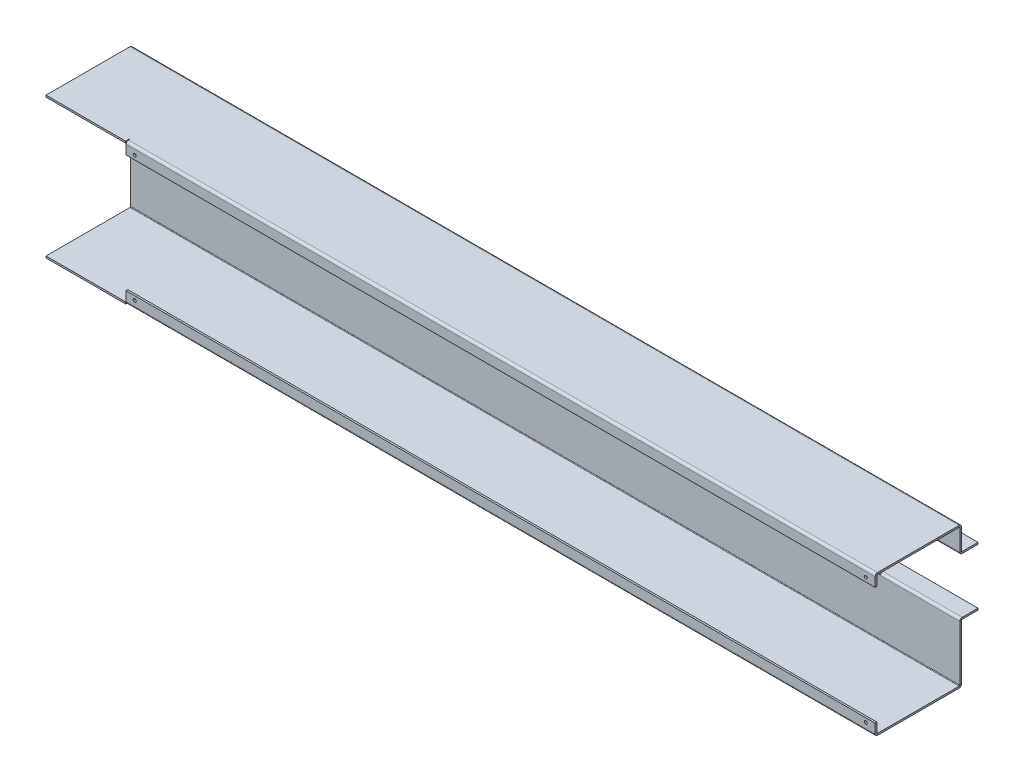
ISO-10303-21;
HEADER;
FILE_DESCRIPTION(('STEP AP214'),'2;1');
FILE_NAME('part.step','',(''),(''),'','','');
FILE_SCHEMA(('AUTOMOTIVE_DESIGN { 1 0 10303 214 1 1 1 1 }'));
ENDSEC;
DATA;
#1=APPLICATION_CONTEXT('core data for automotive mechanical design processes');
#2=APPLICATION_PROTOCOL_DEFINITION('international standard','automotive_design',2000,#1);
#3=PRODUCT_CONTEXT('',#1,'mechanical');
#4=PRODUCT('Part','Part','',(#3));
#5=PRODUCT_RELATED_PRODUCT_CATEGORY('part','',(#4));
#6=PRODUCT_DEFINITION_FORMATION('','',#4);
#7=PRODUCT_DEFINITION_CONTEXT('part definition',#1,'design');
#8=PRODUCT_DEFINITION('design','',#6,#7);
#9=PRODUCT_DEFINITION_SHAPE('','',#8);
#10=(LENGTH_UNIT() NAMED_UNIT(*) SI_UNIT(.MILLI.,.METRE.));
#11=(NAMED_UNIT(*) PLANE_ANGLE_UNIT() SI_UNIT($,.RADIAN.));
#12=(NAMED_UNIT(*) SI_UNIT($,.STERADIAN.) SOLID_ANGLE_UNIT());
#13=UNCERTAINTY_MEASURE_WITH_UNIT(LENGTH_MEASURE(1.E-05),#10,'distance_accuracy_value','');
#14=(GEOMETRIC_REPRESENTATION_CONTEXT(3) GLOBAL_UNCERTAINTY_ASSIGNED_CONTEXT((#13)) GLOBAL_UNIT_ASSIGNED_CONTEXT((#10,
#11,#12)) REPRESENTATION_CONTEXT('',''));
#15=CARTESIAN_POINT('',(0.,0.,0.));
#16=DIRECTION('',(0.,0.,1.));
#17=DIRECTION('',(1.,0.,0.));
#18=AXIS2_PLACEMENT_3D('',#15,#16,#17);
#19=CARTESIAN_POINT('',(-347.,196.,-6.74992500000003));
#20=DIRECTION('',(0.,0.,-1.));
#21=DIRECTION('',(-1.,0.,0.));
#22=AXIS2_PLACEMENT_3D('',#19,#20,#21);
#23=PLANE('',#22);
#24=DIRECTION('',(0.,1.,0.));
#25=VECTOR('',#24,1.);
#26=CARTESIAN_POINT('',(-347.2749925,196.,-6.74992500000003));
#27=LINE('',#26,#25);
#28=CARTESIAN_POINT('',(-347.2749925,193.0001,-6.74992500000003));
#29=VERTEX_POINT('',#28);
#30=CARTESIAN_POINT('',(-347.2749925,196.,-6.74992500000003));
#31=VERTEX_POINT('',#30);
#32=EDGE_CURVE('E11',#29,#31,#27,.T.);
#33=ORIENTED_EDGE('',*,*,#32,.F.);
#34=DIRECTION('',(1.,0.,0.));
#35=VECTOR('',#34,1.);
#36=CARTESIAN_POINT('',(-347.,193.0001,-6.74992500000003));
#37=LINE('',#36,#35);
#38=CARTESIAN_POINT('',(-347.,193.0001,-6.74992500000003));
#39=VERTEX_POINT('',#38);
#40=EDGE_CURVE('E864',#39,#29,#37,.F.);
#41=ORIENTED_EDGE('',*,*,#40,.F.);
#42=DIRECTION('',(0.,1.,0.));
#43=VECTOR('',#42,1.);
#44=CARTESIAN_POINT('',(-347.,196.,-6.74992500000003));
#45=LINE('',#44,#43);
#46=CARTESIAN_POINT('',(-347.,196.,-6.74992500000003));
#47=VERTEX_POINT('',#46);
#48=EDGE_CURVE('E49',#39,#47,#45,.T.);
#49=ORIENTED_EDGE('',*,*,#48,.T.);
#50=DIRECTION('',(-1.,0.,0.));
#51=VECTOR('',#50,1.);
#52=CARTESIAN_POINT('',(-347.,196.,-6.74992500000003));
#53=LINE('',#52,#51);
#54=EDGE_CURVE('E722',#47,#31,#53,.T.);
#55=ORIENTED_EDGE('',*,*,#54,.T.);
#56=EDGE_LOOP('',(#33,#41,#49,#55));
#57=FACE_BOUND('',#56,.T.);
#58=ADVANCED_FACE('F39',(#57),#23,.F.);
#59=CARTESIAN_POINT('',(-347.,196.,-5.));
#60=DIRECTION('',(-1.,0.,0.));
#61=DIRECTION('',(0.,0.,1.));
#62=AXIS2_PLACEMENT_3D('',#59,#60,#61);
#63=PLANE('',#62);
#64=ORIENTED_EDGE('',*,*,#48,.F.);
#65=DIRECTION('',(0.,0.,1.));
#66=VECTOR('',#65,1.);
#67=CARTESIAN_POINT('',(-347.,193.0001,-5.));
#68=LINE('',#67,#66);
#69=CARTESIAN_POINT('',(-347.,193.0001,-32.));
#70=VERTEX_POINT('',#69);
#71=EDGE_CURVE('E767',#39,#70,#68,.F.);
#72=ORIENTED_EDGE('',*,*,#71,.T.);
#73=DIRECTION('',(0.,1.,0.));
#74=VECTOR('',#73,1.);
#75=CARTESIAN_POINT('',(-347.,196.,-32.));
#76=LINE('',#75,#74);
#77=CARTESIAN_POINT('',(-347.,196.,-32.));
#78=VERTEX_POINT('',#77);
#79=EDGE_CURVE('E1431',#70,#78,#76,.T.);
#80=ORIENTED_EDGE('',*,*,#79,.T.);
#81=DIRECTION('',(0.,0.,1.));
#82=VECTOR('',#81,1.);
#83=CARTESIAN_POINT('',(-347.,196.,-5.));
#84=LINE('',#83,#82);
#85=EDGE_CURVE('E738',#47,#78,#84,.F.);
#86=ORIENTED_EDGE('',*,*,#85,.F.);
#87=EDGE_LOOP('',(#64,#72,#80,#86));
#88=FACE_BOUND('',#87,.T.);
#89=ADVANCED_FACE('F1441',(#88),#63,.F.);
#90=CARTESIAN_POINT('',(-347.,196.,-32.));
#91=DIRECTION('',(0.,0.,1.));
#92=DIRECTION('',(1.,0.,0.));
#93=AXIS2_PLACEMENT_3D('',#90,#91,#92);
#94=PLANE('',#93);
#95=ORIENTED_EDGE('',*,*,#79,.F.);
#96=DIRECTION('',(1.,0.,0.));
#97=VECTOR('',#96,1.);
#98=CARTESIAN_POINT('',(-347.,193.0001,-32.));
#99=LINE('',#98,#97);
#100=CARTESIAN_POINT('',(-482.,193.0001,-32.));
#101=VERTEX_POINT('',#100);
#102=EDGE_CURVE('E897',#70,#101,#99,.F.);
#103=ORIENTED_EDGE('',*,*,#102,.T.);
#104=DIRECTION('',(0.,1.,0.));
#105=VECTOR('',#104,1.);
#106=CARTESIAN_POINT('',(-482.,196.,-32.));
#107=LINE('',#106,#105);
#108=CARTESIAN_POINT('',(-482.,196.,-32.));
#109=VERTEX_POINT('',#108);
#110=EDGE_CURVE('E1429',#101,#109,#107,.T.);
#111=ORIENTED_EDGE('',*,*,#110,.T.);
#112=DIRECTION('',(1.,0.,0.));
#113=VECTOR('',#112,1.);
#114=CARTESIAN_POINT('',(-347.,196.,-32.));
#115=LINE('',#114,#113);
#116=EDGE_CURVE('E745',#78,#109,#115,.F.);
#117=ORIENTED_EDGE('',*,*,#116,.F.);
#118=EDGE_LOOP('',(#95,#103,#111,#117));
#119=FACE_BOUND('',#118,.T.);
#120=ADVANCED_FACE('F1444',(#119),#94,.F.);
#121=CARTESIAN_POINT('',(-482.,196.,-5.));
#122=DIRECTION('',(-1.,0.,0.));
#123=DIRECTION('',(0.,0.,1.));
#124=AXIS2_PLACEMENT_3D('',#121,#122,#123);
#125=PLANE('',#124);
#126=ORIENTED_EDGE('',*,*,#110,.F.);
#127=DIRECTION('',(0.,0.,1.));
#128=VECTOR('',#127,1.);
#129=CARTESIAN_POINT('',(-482.,193.0001,-5.));
#130=LINE('',#129,#128);
#131=CARTESIAN_POINT('',(-482.,193.0001,-5.));
#132=VERTEX_POINT('',#131);
#133=EDGE_CURVE('E768',#101,#132,#130,.T.);
#134=ORIENTED_EDGE('',*,*,#133,.T.);
#135=DIRECTION('',(0.,1.,0.));
#136=VECTOR('',#135,1.);
#137=CARTESIAN_POINT('',(-482.,196.,-5.));
#138=LINE('',#137,#136);
#139=CARTESIAN_POINT('',(-482.,196.,-5.));
#140=VERTEX_POINT('',#139);
#141=EDGE_CURVE('E1427',#132,#140,#138,.T.);
#142=ORIENTED_EDGE('',*,*,#141,.T.);
#143=DIRECTION('',(0.,0.,1.));
#144=VECTOR('',#143,1.);
#145=CARTESIAN_POINT('',(-482.,196.,-5.));
#146=LINE('',#145,#144);
#147=EDGE_CURVE('E736',#109,#140,#146,.T.);
#148=ORIENTED_EDGE('',*,*,#147,.F.);
#149=EDGE_LOOP('',(#126,#134,#142,#148));
#150=FACE_BOUND('',#149,.T.);
#151=ADVANCED_FACE('F1450',(#150),#125,.T.);
#152=CARTESIAN_POINT('',(-482.,197.,-5.));
#153=DIRECTION('',(-1.,0.,0.));
#154=DIRECTION('',(0.,0.,1.));
#155=AXIS2_PLACEMENT_3D('',#152,#153,#154);
#156=PLANE('',#155);
#157=ORIENTED_EDGE('',*,*,#141,.F.);
#158=CARTESIAN_POINT('',(-482.,197.,-5.));
#159=DIRECTION('',(1.,0.,0.));
#160=DIRECTION('',(0.,0.,-1.));
#161=AXIS2_PLACEMENT_3D('',#158,#159,#160);
#162=CIRCLE('',#161,3.9999);
#163=CARTESIAN_POINT('',(-482.,197.,-1.0001));
#164=VERTEX_POINT('',#163);
#165=EDGE_CURVE('E1112',#164,#132,#162,.T.);
#166=ORIENTED_EDGE('',*,*,#165,.F.);
#167=DIRECTION('',(0.,0.,-1.));
#168=VECTOR('',#167,1.);
#169=CARTESIAN_POINT('',(-482.,197.,-4.));
#170=LINE('',#169,#168);
#171=CARTESIAN_POINT('',(-482.,197.,-4.));
#172=VERTEX_POINT('',#171);
#173=EDGE_CURVE('E1425',#164,#172,#170,.T.);
#174=ORIENTED_EDGE('',*,*,#173,.T.);
#175=CARTESIAN_POINT('',(-482.,197.,-5.));
#176=DIRECTION('',(1.,0.,0.));
#177=DIRECTION('',(0.,0.,-1.));
#178=AXIS2_PLACEMENT_3D('',#175,#176,#177);
#179=CIRCLE('',#178,1.);
#180=EDGE_CURVE('E742',#172,#140,#179,.T.);
#181=ORIENTED_EDGE('',*,*,#180,.T.);
#182=EDGE_LOOP('',(#157,#166,#174,#181));
#183=FACE_BOUND('',#182,.T.);
#184=ADVANCED_FACE('F1534',(#183),#156,.T.);
#185=CARTESIAN_POINT('',(-482.,117.,-4.));
#186=DIRECTION('',(-1.,0.,0.));
#187=DIRECTION('',(0.,1.,0.));
#188=AXIS2_PLACEMENT_3D('',#185,#186,#187);
#189=PLANE('',#188);
#190=ORIENTED_EDGE('',*,*,#173,.F.);
#191=DIRECTION('',(0.,1.,0.));
#192=VECTOR('',#191,1.);
#193=CARTESIAN_POINT('',(-482.,117.,-1.0001));
#194=LINE('',#193,#192);
#195=CARTESIAN_POINT('',(-482.,233.,-1.0001));
#196=VERTEX_POINT('',#195);
#197=EDGE_CURVE('E763',#164,#196,#194,.T.);
#198=ORIENTED_EDGE('',*,*,#197,.T.);
#199=DIRECTION('',(0.,0.,-1.));
#200=VECTOR('',#199,1.);
#201=CARTESIAN_POINT('',(-482.,233.,-4.));
#202=LINE('',#201,#200);
#203=CARTESIAN_POINT('',(-482.,233.,-4.));
#204=VERTEX_POINT('',#203);
#205=EDGE_CURVE('E1423',#196,#204,#202,.T.);
#206=ORIENTED_EDGE('',*,*,#205,.T.);
#207=DIRECTION('',(0.,1.,0.));
#208=VECTOR('',#207,1.);
#209=CARTESIAN_POINT('',(-482.,117.,-4.));
#210=LINE('',#209,#208);
#211=EDGE_CURVE('E1496',#172,#204,#210,.T.);
#212=ORIENTED_EDGE('',*,*,#211,.F.);
#213=EDGE_LOOP('',(#190,#198,#206,#212));
#214=FACE_BOUND('',#213,.T.);
#215=ADVANCED_FACE('F1817',(#214),#189,.T.);
#216=CARTESIAN_POINT('',(-482.,233.,0.));
#217=DIRECTION('',(-1.,0.,0.));
#218=DIRECTION('',(0.,0.,1.));
#219=AXIS2_PLACEMENT_3D('',#216,#217,#218);
#220=PLANE('',#219);
#221=ORIENTED_EDGE('',*,*,#205,.F.);
#222=CARTESIAN_POINT('',(-482.,233.,0.));
#223=DIRECTION('',(1.,0.,0.));
#224=DIRECTION('',(0.,0.,-1.));
#225=AXIS2_PLACEMENT_3D('',#222,#223,#224);
#226=CIRCLE('',#225,1.0001);
#227=CARTESIAN_POINT('',(-482.,234.0001,0.));
#228=VERTEX_POINT('',#227);
#229=EDGE_CURVE('E1131',#196,#228,#226,.T.);
#230=ORIENTED_EDGE('',*,*,#229,.T.);
#231=DIRECTION('',(0.,1.,0.));
#232=VECTOR('',#231,1.);
#233=CARTESIAN_POINT('',(-482.,237.,0.));
#234=LINE('',#233,#232);
#235=CARTESIAN_POINT('',(-482.,237.,0.));
#236=VERTEX_POINT('',#235);
#237=EDGE_CURVE('E1421',#228,#236,#234,.T.);
#238=ORIENTED_EDGE('',*,*,#237,.T.);
#239=CARTESIAN_POINT('',(-482.,233.,0.));
#240=DIRECTION('',(1.,0.,0.));
#241=DIRECTION('',(0.,0.,-1.));
#242=AXIS2_PLACEMENT_3D('',#239,#240,#241);
#243=CIRCLE('',#242,4.);
#244=EDGE_CURVE('E2631',#204,#236,#243,.T.);
#245=ORIENTED_EDGE('',*,*,#244,.F.);
#246=EDGE_LOOP('',(#221,#230,#238,#245));
#247=FACE_BOUND('',#246,.T.);
#248=ADVANCED_FACE('F1813',(#247),#220,.T.);
#249=CARTESIAN_POINT('',(-482.,237.,0.));
#250=DIRECTION('',(-1.,0.,0.));
#251=DIRECTION('',(0.,0.,1.));
#252=AXIS2_PLACEMENT_3D('',#249,#250,#251);
#253=PLANE('',#252);
#254=ORIENTED_EDGE('',*,*,#237,.F.);
#255=DIRECTION('',(0.,0.,1.));
#256=VECTOR('',#255,1.);
#257=CARTESIAN_POINT('',(-482.,234.0001,0.));
#258=LINE('',#257,#256);
#259=CARTESIAN_POINT('',(-482.,234.0001,143.));
#260=VERTEX_POINT('',#259);
#261=EDGE_CURVE('E999',#228,#260,#258,.T.);
#262=ORIENTED_EDGE('',*,*,#261,.T.);
#263=DIRECTION('',(0.,1.,0.));
#264=VECTOR('',#263,1.);
#265=CARTESIAN_POINT('',(-482.,237.,143.));
#266=LINE('',#265,#264);
#267=CARTESIAN_POINT('',(-482.,237.,143.));
#268=VERTEX_POINT('',#267);
#269=EDGE_CURVE('E1419',#260,#268,#266,.T.);
#270=ORIENTED_EDGE('',*,*,#269,.T.);
#271=DIRECTION('',(0.,0.,1.));
#272=VECTOR('',#271,1.);
#273=CARTESIAN_POINT('',(-482.,237.,0.));
#274=LINE('',#273,#272);
#275=EDGE_CURVE('E2609',#236,#268,#274,.T.);
#276=ORIENTED_EDGE('',*,*,#275,.F.);
#277=EDGE_LOOP('',(#254,#262,#270,#276));
#278=FACE_BOUND('',#277,.T.);
#279=ADVANCED_FACE('F1809',(#278),#253,.T.);
#280=CARTESIAN_POINT('',(-482.,237.,143.));
#281=DIRECTION('',(0.,0.,1.));
#282=DIRECTION('',(1.,0.,0.));
#283=AXIS2_PLACEMENT_3D('',#280,#281,#282);
#284=PLANE('',#283);
#285=ORIENTED_EDGE('',*,*,#269,.F.);
#286=DIRECTION('',(1.,0.,0.));
#287=VECTOR('',#286,1.);
#288=CARTESIAN_POINT('',(-482.,234.0001,143.));
#289=LINE('',#288,#287);
#290=CARTESIAN_POINT('',(-346.4249925,234.0001,143.));
#291=VERTEX_POINT('',#290);
#292=EDGE_CURVE('E816',#260,#291,#289,.T.);
#293=ORIENTED_EDGE('',*,*,#292,.T.);
#294=DIRECTION('',(0.,1.,0.));
#295=VECTOR('',#294,1.);
#296=CARTESIAN_POINT('',(-346.4249925,237.,143.));
#297=LINE('',#296,#295);
#298=CARTESIAN_POINT('',(-346.4249925,237.,143.));
#299=VERTEX_POINT('',#298);
#300=EDGE_CURVE('E1417',#291,#299,#297,.T.);
#301=ORIENTED_EDGE('',*,*,#300,.T.);
#302=DIRECTION('',(1.,0.,0.));
#303=VECTOR('',#302,1.);
#304=CARTESIAN_POINT('',(-482.,237.,143.));
#305=LINE('',#304,#303);
#306=EDGE_CURVE('E2613',#268,#299,#305,.T.);
#307=ORIENTED_EDGE('',*,*,#306,.F.);
#308=EDGE_LOOP('',(#285,#293,#301,#307));
#309=FACE_BOUND('',#308,.T.);
#310=ADVANCED_FACE('F1805',(#309),#284,.T.);
#311=CARTESIAN_POINT('',(-346.4249925,237.,0.));
#312=DIRECTION('',(-1.,0.,0.));
#313=DIRECTION('',(0.,0.,1.));
#314=AXIS2_PLACEMENT_3D('',#311,#312,#313);
#315=PLANE('',#314);
#316=ORIENTED_EDGE('',*,*,#300,.F.);
#317=DIRECTION('',(0.,0.,1.));
#318=VECTOR('',#317,1.);
#319=CARTESIAN_POINT('',(-346.4249925,234.0001,0.));
#320=LINE('',#319,#318);
#321=CARTESIAN_POINT('',(-346.4249925,234.0001,136.750075));
#322=VERTEX_POINT('',#321);
#323=EDGE_CURVE('E1154',#322,#291,#320,.T.);
#324=ORIENTED_EDGE('',*,*,#323,.F.);
#325=DIRECTION('',(0.,1.,0.));
#326=VECTOR('',#325,1.);
#327=CARTESIAN_POINT('',(-346.4249925,237.,136.750075));
#328=LINE('',#327,#326);
#329=CARTESIAN_POINT('',(-346.4249925,237.,136.750075));
#330=VERTEX_POINT('',#329);
#331=EDGE_CURVE('E1415',#322,#330,#328,.T.);
#332=ORIENTED_EDGE('',*,*,#331,.T.);
#333=DIRECTION('',(0.,0.,1.));
#334=VECTOR('',#333,1.);
#335=CARTESIAN_POINT('',(-346.4249925,237.,0.));
#336=LINE('',#335,#334);
#337=EDGE_CURVE('E2179',#330,#299,#336,.T.);
#338=ORIENTED_EDGE('',*,*,#337,.T.);
#339=EDGE_LOOP('',(#316,#324,#332,#338));
#340=FACE_BOUND('',#339,.T.);
#341=ADVANCED_FACE('F1801',(#340),#315,.F.);
#342=CARTESIAN_POINT('',(-482.,237.,136.750075));
#343=DIRECTION('',(0.,0.,-1.));
#344=DIRECTION('',(-1.,0.,0.));
#345=AXIS2_PLACEMENT_3D('',#342,#343,#344);
#346=PLANE('',#345);
#347=ORIENTED_EDGE('',*,*,#331,.F.);
#348=DIRECTION('',(1.,0.,0.));
#349=VECTOR('',#348,1.);
#350=CARTESIAN_POINT('',(-482.,234.0001,136.750075));
#351=LINE('',#350,#349);
#352=CARTESIAN_POINT('',(-345.5750075,234.0001,136.750075));
#353=VERTEX_POINT('',#352);
#354=EDGE_CURVE('E978',#353,#322,#351,.F.);
#355=ORIENTED_EDGE('',*,*,#354,.F.);
#356=DIRECTION('',(0.,1.,0.));
#357=VECTOR('',#356,1.);
#358=CARTESIAN_POINT('',(-345.5750075,237.,136.750075));
#359=LINE('',#358,#357);
#360=CARTESIAN_POINT('',(-345.5750075,237.,136.750075));
#361=VERTEX_POINT('',#360);
#362=EDGE_CURVE('E1413',#353,#361,#359,.T.);
#363=ORIENTED_EDGE('',*,*,#362,.T.);
#364=DIRECTION('',(-1.,0.,0.));
#365=VECTOR('',#364,1.);
#366=CARTESIAN_POINT('',(-482.,237.,136.750075));
#367=LINE('',#366,#365);
#368=EDGE_CURVE('E2171',#361,#330,#367,.T.);
#369=ORIENTED_EDGE('',*,*,#368,.T.);
#370=EDGE_LOOP('',(#347,#355,#363,#369));
#371=FACE_BOUND('',#370,.T.);
#372=ADVANCED_FACE('F1797',(#371),#346,.F.);
#373=CARTESIAN_POINT('',(-345.5750075,237.,0.));
#374=DIRECTION('',(1.,0.,0.));
#375=DIRECTION('',(0.,0.,-1.));
#376=AXIS2_PLACEMENT_3D('',#373,#374,#375);
#377=PLANE('',#376);
#378=ORIENTED_EDGE('',*,*,#362,.F.);
#379=DIRECTION('',(0.,0.,1.));
#380=VECTOR('',#379,1.);
#381=CARTESIAN_POINT('',(-345.5750075,234.0001,0.));
#382=LINE('',#381,#380);
#383=CARTESIAN_POINT('',(-345.5750075,234.0001,139.));
#384=VERTEX_POINT('',#383);
#385=EDGE_CURVE('E1159',#384,#353,#382,.F.);
#386=ORIENTED_EDGE('',*,*,#385,.F.);
#387=DIRECTION('',(0.,1.,0.));
#388=VECTOR('',#387,1.);
#389=CARTESIAN_POINT('',(-345.5750075,237.,139.));
#390=LINE('',#389,#388);
#391=CARTESIAN_POINT('',(-345.5750075,237.,139.));
#392=VERTEX_POINT('',#391);
#393=EDGE_CURVE('E1411',#384,#392,#390,.T.);
#394=ORIENTED_EDGE('',*,*,#393,.T.);
#395=DIRECTION('',(0.,0.,-1.));
#396=VECTOR('',#395,1.);
#397=CARTESIAN_POINT('',(-345.5750075,237.,0.));
#398=LINE('',#397,#396);
#399=EDGE_CURVE('E2176',#392,#361,#398,.T.);
#400=ORIENTED_EDGE('',*,*,#399,.T.);
#401=EDGE_LOOP('',(#378,#386,#394,#400));
#402=FACE_BOUND('',#401,.T.);
#403=ADVANCED_FACE('F1793',(#402),#377,.F.);
#404=CARTESIAN_POINT('',(-345.5750075,233.,139.));
#405=DIRECTION('',(-1.,0.,0.));
#406=DIRECTION('',(0.,0.,1.));
#407=AXIS2_PLACEMENT_3D('',#404,#405,#406);
#408=PLANE('',#407);
#409=ORIENTED_EDGE('',*,*,#393,.F.);
#410=CARTESIAN_POINT('',(-345.5750075,233.,139.));
#411=DIRECTION('',(1.,0.,0.));
#412=DIRECTION('',(0.,0.,-1.));
#413=AXIS2_PLACEMENT_3D('',#410,#411,#412);
#414=CIRCLE('',#413,1.0001);
#415=CARTESIAN_POINT('',(-345.5750075,233.,140.0001));
#416=VERTEX_POINT('',#415);
#417=EDGE_CURVE('E926',#416,#384,#414,.F.);
#418=ORIENTED_EDGE('',*,*,#417,.F.);
#419=DIRECTION('',(0.,0.,1.));
#420=VECTOR('',#419,1.);
#421=CARTESIAN_POINT('',(-345.5750075,233.,143.));
#422=LINE('',#421,#420);
#423=CARTESIAN_POINT('',(-345.5750075,233.,143.));
#424=VERTEX_POINT('',#423);
#425=EDGE_CURVE('E1409',#416,#424,#422,.T.);
#426=ORIENTED_EDGE('',*,*,#425,.T.);
#427=CARTESIAN_POINT('',(-345.5750075,233.,139.));
#428=DIRECTION('',(1.,0.,0.));
#429=DIRECTION('',(0.,0.,-1.));
#430=AXIS2_PLACEMENT_3D('',#427,#428,#429);
#431=CIRCLE('',#430,4.);
#432=EDGE_CURVE('E2186',#424,#392,#431,.F.);
#433=ORIENTED_EDGE('',*,*,#432,.T.);
#434=EDGE_LOOP('',(#409,#418,#426,#433));
#435=FACE_BOUND('',#434,.T.);
#436=ADVANCED_FACE('F1789',(#435),#408,.T.);
#437=CARTESIAN_POINT('',(-345.5750075,233.,143.));
#438=DIRECTION('',(1.,0.,0.));
#439=DIRECTION('',(0.,1.,0.));
#440=AXIS2_PLACEMENT_3D('',#437,#438,#439);
#441=PLANE('',#440);
#442=ORIENTED_EDGE('',*,*,#425,.F.);
#443=DIRECTION('',(0.,-1.,0.));
#444=VECTOR('',#443,1.);
#445=CARTESIAN_POINT('',(-345.5750075,233.,140.0001));
#446=LINE('',#445,#444);
#447=CARTESIAN_POINT('',(-345.5750075,232.750075,140.0001));
#448=VERTEX_POINT('',#447);
#449=EDGE_CURVE('E1153',#448,#416,#446,.F.);
#450=ORIENTED_EDGE('',*,*,#449,.F.);
#451=DIRECTION('',(0.,0.,1.));
#452=VECTOR('',#451,1.);
#453=CARTESIAN_POINT('',(-345.5750075,232.750075,143.));
#454=LINE('',#453,#452);
#455=CARTESIAN_POINT('',(-345.5750075,232.750075,143.));
#456=VERTEX_POINT('',#455);
#457=EDGE_CURVE('E1407',#448,#456,#454,.T.);
#458=ORIENTED_EDGE('',*,*,#457,.T.);
#459=DIRECTION('',(0.,1.,0.));
#460=VECTOR('',#459,1.);
#461=CARTESIAN_POINT('',(-345.5750075,233.,143.));
#462=LINE('',#461,#460);
#463=EDGE_CURVE('E2185',#456,#424,#462,.T.);
#464=ORIENTED_EDGE('',*,*,#463,.T.);
#465=EDGE_LOOP('',(#442,#450,#458,#464));
#466=FACE_BOUND('',#465,.T.);
#467=ADVANCED_FACE('F1785',(#466),#441,.F.);
#468=CARTESIAN_POINT('',(-346.,232.750075,143.));
#469=DIRECTION('',(0.,1.,0.));
#470=DIRECTION('',(-1.,0.,0.));
#471=AXIS2_PLACEMENT_3D('',#468,#469,#470);
#472=PLANE('',#471);
#473=ORIENTED_EDGE('',*,*,#457,.F.);
#474=DIRECTION('',(1.,0.,0.));
#475=VECTOR('',#474,1.);
#476=CARTESIAN_POINT('',(-346.,232.750075,140.0001));
#477=LINE('',#476,#475);
#478=CARTESIAN_POINT('',(-346.,232.750075,140.0001));
#479=VERTEX_POINT('',#478);
#480=EDGE_CURVE('E1150',#448,#479,#477,.F.);
#481=ORIENTED_EDGE('',*,*,#480,.T.);
#482=DIRECTION('',(0.,0.,1.));
#483=VECTOR('',#482,1.);
#484=CARTESIAN_POINT('',(-346.,232.750075,143.));
#485=LINE('',#484,#483);
#486=CARTESIAN_POINT('',(-346.,232.750075,143.));
#487=VERTEX_POINT('',#486);
#488=EDGE_CURVE('E1405',#479,#487,#485,.T.);
#489=ORIENTED_EDGE('',*,*,#488,.T.);
#490=DIRECTION('',(-1.,0.,0.));
#491=VECTOR('',#490,1.);
#492=CARTESIAN_POINT('',(-346.,232.750075,143.));
#493=LINE('',#492,#491);
#494=EDGE_CURVE('E2182',#456,#487,#493,.T.);
#495=ORIENTED_EDGE('',*,*,#494,.F.);
#496=EDGE_LOOP('',(#473,#481,#489,#495));
#497=FACE_BOUND('',#496,.T.);
#498=ADVANCED_FACE('F1781',(#497),#472,.T.);
#499=CARTESIAN_POINT('',(-346.,233.,143.));
#500=DIRECTION('',(-1.,0.,0.));
#501=DIRECTION('',(0.,-1.,0.));
#502=AXIS2_PLACEMENT_3D('',#499,#500,#501);
#503=PLANE('',#502);
#504=ORIENTED_EDGE('',*,*,#488,.F.);
#505=DIRECTION('',(0.,-1.,0.));
#506=VECTOR('',#505,1.);
#507=CARTESIAN_POINT('',(-346.,233.,140.0001));
#508=LINE('',#507,#506);
#509=CARTESIAN_POINT('',(-346.,217.,140.0001));
#510=VERTEX_POINT('',#509);
#511=EDGE_CURVE('E820',#479,#510,#508,.T.);
#512=ORIENTED_EDGE('',*,*,#511,.T.);
#513=DIRECTION('',(0.,0.,1.));
#514=VECTOR('',#513,1.);
#515=CARTESIAN_POINT('',(-346.,217.,143.));
#516=LINE('',#515,#514);
#517=CARTESIAN_POINT('',(-346.,217.,143.));
#518=VERTEX_POINT('',#517);
#519=EDGE_CURVE('E1403',#510,#518,#516,.T.);
#520=ORIENTED_EDGE('',*,*,#519,.T.);
#521=DIRECTION('',(0.,-1.,0.));
#522=VECTOR('',#521,1.);
#523=CARTESIAN_POINT('',(-346.,233.,143.));
#524=LINE('',#523,#522);
#525=EDGE_CURVE('E2375',#487,#518,#524,.T.);
#526=ORIENTED_EDGE('',*,*,#525,.F.);
#527=EDGE_LOOP('',(#504,#512,#520,#526));
#528=FACE_BOUND('',#527,.T.);
#529=ADVANCED_FACE('F1777',(#528),#503,.T.);
#530=CARTESIAN_POINT('',(-346.,217.,143.));
#531=DIRECTION('',(0.,-1.,0.));
#532=DIRECTION('',(1.,0.,0.));
#533=AXIS2_PLACEMENT_3D('',#530,#531,#532);
#534=PLANE('',#533);
#535=ORIENTED_EDGE('',*,*,#519,.F.);
#536=DIRECTION('',(1.,0.,0.));
#537=VECTOR('',#536,1.);
#538=CARTESIAN_POINT('',(-346.,217.,140.0001));
#539=LINE('',#538,#537);
#540=CARTESIAN_POINT('',(929.,217.,140.0001));
#541=VERTEX_POINT('',#540);
#542=EDGE_CURVE('E1142',#510,#541,#539,.T.);
#543=ORIENTED_EDGE('',*,*,#542,.T.);
#544=DIRECTION('',(0.,0.,1.));
#545=VECTOR('',#544,1.);
#546=CARTESIAN_POINT('',(929.,217.,143.));
#547=LINE('',#546,#545);
#548=CARTESIAN_POINT('',(929.,217.,143.));
#549=VERTEX_POINT('',#548);
#550=EDGE_CURVE('E1401',#541,#549,#547,.T.);
#551=ORIENTED_EDGE('',*,*,#550,.T.);
#552=DIRECTION('',(1.,0.,0.));
#553=VECTOR('',#552,1.);
#554=CARTESIAN_POINT('',(-346.,217.,143.));
#555=LINE('',#554,#553);
#556=EDGE_CURVE('E2372',#518,#549,#555,.T.);
#557=ORIENTED_EDGE('',*,*,#556,.F.);
#558=EDGE_LOOP('',(#535,#543,#551,#557));
#559=FACE_BOUND('',#558,.T.);
#560=ADVANCED_FACE('F1773',(#559),#534,.T.);
#561=CARTESIAN_POINT('',(929.,233.,143.));
#562=DIRECTION('',(-1.,0.,0.));
#563=DIRECTION('',(0.,-1.,0.));
#564=AXIS2_PLACEMENT_3D('',#561,#562,#563);
#565=PLANE('',#564);
#566=ORIENTED_EDGE('',*,*,#550,.F.);
#567=DIRECTION('',(0.,-1.,0.));
#568=VECTOR('',#567,1.);
#569=CARTESIAN_POINT('',(929.,233.,140.0001));
#570=LINE('',#569,#568);
#571=CARTESIAN_POINT('',(929.,233.,140.0001));
#572=VERTEX_POINT('',#571);
#573=EDGE_CURVE('E821',#541,#572,#570,.F.);
#574=ORIENTED_EDGE('',*,*,#573,.T.);
#575=DIRECTION('',(0.,0.,1.));
#576=VECTOR('',#575,1.);
#577=CARTESIAN_POINT('',(929.,233.,143.));
#578=LINE('',#577,#576);
#579=CARTESIAN_POINT('',(929.,233.,143.));
#580=VERTEX_POINT('',#579);
#581=EDGE_CURVE('E1399',#572,#580,#578,.T.);
#582=ORIENTED_EDGE('',*,*,#581,.T.);
#583=DIRECTION('',(0.,-1.,0.));
#584=VECTOR('',#583,1.);
#585=CARTESIAN_POINT('',(929.,233.,143.));
#586=LINE('',#585,#584);
#587=EDGE_CURVE('E2392',#549,#580,#586,.F.);
#588=ORIENTED_EDGE('',*,*,#587,.F.);
#589=EDGE_LOOP('',(#566,#574,#582,#588));
#590=FACE_BOUND('',#589,.T.);
#591=ADVANCED_FACE('F1769',(#590),#565,.F.);
#592=CARTESIAN_POINT('',(929.,233.,139.));
#593=DIRECTION('',(-1.,0.,0.));
#594=DIRECTION('',(0.,0.,1.));
#595=AXIS2_PLACEMENT_3D('',#592,#593,#594);
#596=PLANE('',#595);
#597=ORIENTED_EDGE('',*,*,#581,.F.);
#598=CARTESIAN_POINT('',(929.,233.,139.));
#599=DIRECTION('',(1.,0.,0.));
#600=DIRECTION('',(0.,0.,-1.));
#601=AXIS2_PLACEMENT_3D('',#598,#599,#600);
#602=CIRCLE('',#601,1.0001);
#603=CARTESIAN_POINT('',(929.,234.0001,139.));
#604=VERTEX_POINT('',#603);
#605=EDGE_CURVE('E944',#572,#604,#602,.F.);
#606=ORIENTED_EDGE('',*,*,#605,.T.);
#607=DIRECTION('',(0.,1.,0.));
#608=VECTOR('',#607,1.);
#609=CARTESIAN_POINT('',(929.,237.,139.));
#610=LINE('',#609,#608);
#611=CARTESIAN_POINT('',(929.,237.,139.));
#612=VERTEX_POINT('',#611);
#613=EDGE_CURVE('E1397',#604,#612,#610,.T.);
#614=ORIENTED_EDGE('',*,*,#613,.T.);
#615=CARTESIAN_POINT('',(929.,233.,139.));
#616=DIRECTION('',(1.,0.,0.));
#617=DIRECTION('',(0.,0.,-1.));
#618=AXIS2_PLACEMENT_3D('',#615,#616,#617);
#619=CIRCLE('',#618,4.);
#620=EDGE_CURVE('E2399',#580,#612,#619,.F.);
#621=ORIENTED_EDGE('',*,*,#620,.F.);
#622=EDGE_LOOP('',(#597,#606,#614,#621));
#623=FACE_BOUND('',#622,.T.);
#624=ADVANCED_FACE('F1765',(#623),#596,.F.);
#625=CARTESIAN_POINT('',(929.,237.,0.));
#626=DIRECTION('',(-1.,0.,0.));
#627=DIRECTION('',(0.,0.,1.));
#628=AXIS2_PLACEMENT_3D('',#625,#626,#627);
#629=PLANE('',#628);
#630=ORIENTED_EDGE('',*,*,#613,.F.);
#631=DIRECTION('',(0.,0.,1.));
#632=VECTOR('',#631,1.);
#633=CARTESIAN_POINT('',(929.,234.0001,0.));
#634=LINE('',#633,#632);
#635=CARTESIAN_POINT('',(929.,234.0001,0.));
#636=VERTEX_POINT('',#635);
#637=EDGE_CURVE('E812',#604,#636,#634,.F.);
#638=ORIENTED_EDGE('',*,*,#637,.T.);
#639=DIRECTION('',(0.,1.,0.));
#640=VECTOR('',#639,1.);
#641=CARTESIAN_POINT('',(929.,237.,0.));
#642=LINE('',#641,#640);
#643=CARTESIAN_POINT('',(929.,237.,0.));
#644=VERTEX_POINT('',#643);
#645=EDGE_CURVE('E1395',#636,#644,#642,.T.);
#646=ORIENTED_EDGE('',*,*,#645,.T.);
#647=DIRECTION('',(0.,0.,1.));
#648=VECTOR('',#647,1.);
#649=CARTESIAN_POINT('',(929.,237.,0.));
#650=LINE('',#649,#648);
#651=EDGE_CURVE('E2622',#612,#644,#650,.F.);
#652=ORIENTED_EDGE('',*,*,#651,.F.);
#653=EDGE_LOOP('',(#630,#638,#646,#652));
#654=FACE_BOUND('',#653,.T.);
#655=ADVANCED_FACE('F1761',(#654),#629,.F.);
#656=CARTESIAN_POINT('',(929.,233.,0.));
#657=DIRECTION('',(-1.,0.,0.));
#658=DIRECTION('',(0.,0.,1.));
#659=AXIS2_PLACEMENT_3D('',#656,#657,#658);
#660=PLANE('',#659);
#661=ORIENTED_EDGE('',*,*,#645,.F.);
#662=CARTESIAN_POINT('',(929.,233.,0.));
#663=DIRECTION('',(1.,0.,0.));
#664=DIRECTION('',(0.,0.,-1.));
#665=AXIS2_PLACEMENT_3D('',#662,#663,#664);
#666=CIRCLE('',#665,1.0001);
#667=CARTESIAN_POINT('',(929.,233.,-1.0001));
#668=VERTEX_POINT('',#667);
#669=EDGE_CURVE('E811',#636,#668,#666,.F.);
#670=ORIENTED_EDGE('',*,*,#669,.T.);
#671=DIRECTION('',(0.,0.,-1.));
#672=VECTOR('',#671,1.);
#673=CARTESIAN_POINT('',(929.,233.,-4.));
#674=LINE('',#673,#672);
#675=CARTESIAN_POINT('',(929.,233.,-4.));
#676=VERTEX_POINT('',#675);
#677=EDGE_CURVE('E1393',#668,#676,#674,.T.);
#678=ORIENTED_EDGE('',*,*,#677,.T.);
#679=CARTESIAN_POINT('',(929.,233.,0.));
#680=DIRECTION('',(1.,0.,0.));
#681=DIRECTION('',(0.,0.,-1.));
#682=AXIS2_PLACEMENT_3D('',#679,#680,#681);
#683=CIRCLE('',#682,4.);
#684=EDGE_CURVE('E2628',#644,#676,#683,.F.);
#685=ORIENTED_EDGE('',*,*,#684,.F.);
#686=EDGE_LOOP('',(#661,#670,#678,#685));
#687=FACE_BOUND('',#686,.T.);
#688=ADVANCED_FACE('F1757',(#687),#660,.F.);
#689=CARTESIAN_POINT('',(929.,117.,-4.));
#690=DIRECTION('',(-1.,0.,0.));
#691=DIRECTION('',(0.,1.,0.));
#692=AXIS2_PLACEMENT_3D('',#689,#690,#691);
#693=PLANE('',#692);
#694=ORIENTED_EDGE('',*,*,#677,.F.);
#695=DIRECTION('',(0.,1.,0.));
#696=VECTOR('',#695,1.);
#697=CARTESIAN_POINT('',(929.,117.,-1.0001));
#698=LINE('',#697,#696);
#699=CARTESIAN_POINT('',(929.,197.,-1.0001));
#700=VERTEX_POINT('',#699);
#701=EDGE_CURVE('E772',#668,#700,#698,.F.);
#702=ORIENTED_EDGE('',*,*,#701,.T.);
#703=DIRECTION('',(0.,0.,-1.));
#704=VECTOR('',#703,1.);
#705=CARTESIAN_POINT('',(929.,197.,-4.));
#706=LINE('',#705,#704);
#707=CARTESIAN_POINT('',(929.,197.,-4.));
#708=VERTEX_POINT('',#707);
#709=EDGE_CURVE('E1391',#700,#708,#706,.T.);
#710=ORIENTED_EDGE('',*,*,#709,.T.);
#711=DIRECTION('',(0.,1.,0.));
#712=VECTOR('',#711,1.);
#713=CARTESIAN_POINT('',(929.,117.,-4.));
#714=LINE('',#713,#712);
#715=EDGE_CURVE('E2307',#676,#708,#714,.F.);
#716=ORIENTED_EDGE('',*,*,#715,.F.);
#717=EDGE_LOOP('',(#694,#702,#710,#716));
#718=FACE_BOUND('',#717,.T.);
#719=ADVANCED_FACE('F1753',(#718),#693,.F.);
#720=CARTESIAN_POINT('',(929.,197.,-5.));
#721=DIRECTION('',(1.,0.,0.));
#722=DIRECTION('',(0.,0.,-1.));
#723=AXIS2_PLACEMENT_3D('',#720,#721,#722);
#724=PLANE('',#723);
#725=ORIENTED_EDGE('',*,*,#709,.F.);
#726=CARTESIAN_POINT('',(929.,197.,-5.));
#727=DIRECTION('',(-1.,0.,0.));
#728=DIRECTION('',(0.,0.,1.));
#729=AXIS2_PLACEMENT_3D('',#726,#727,#728);
#730=CIRCLE('',#729,3.9999);
#731=CARTESIAN_POINT('',(929.,193.0001,-4.99999999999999));
#732=VERTEX_POINT('',#731);
#733=EDGE_CURVE('E1070',#732,#700,#730,.T.);
#734=ORIENTED_EDGE('',*,*,#733,.F.);
#735=DIRECTION('',(0.,1.,0.));
#736=VECTOR('',#735,1.);
#737=CARTESIAN_POINT('',(929.,196.,-5.));
#738=LINE('',#737,#736);
#739=CARTESIAN_POINT('',(929.,196.,-5.));
#740=VERTEX_POINT('',#739);
#741=EDGE_CURVE('E1387',#732,#740,#738,.T.);
#742=ORIENTED_EDGE('',*,*,#741,.T.);
#743=CARTESIAN_POINT('',(929.,197.,-5.));
#744=DIRECTION('',(-1.,0.,0.));
#745=DIRECTION('',(0.,0.,1.));
#746=AXIS2_PLACEMENT_3D('',#743,#744,#745);
#747=CIRCLE('',#746,1.);
#748=EDGE_CURVE('E2667',#740,#708,#747,.T.);
#749=ORIENTED_EDGE('',*,*,#748,.T.);
#750=EDGE_LOOP('',(#725,#734,#742,#749));
#751=FACE_BOUND('',#750,.T.);
#752=ADVANCED_FACE('F1749',(#751),#724,.T.);
#753=CARTESIAN_POINT('',(929.,196.,-5.));
#754=DIRECTION('',(-1.,0.,0.));
#755=DIRECTION('',(0.,0.,1.));
#756=AXIS2_PLACEMENT_3D('',#753,#754,#755);
#757=PLANE('',#756);
#758=ORIENTED_EDGE('',*,*,#741,.F.);
#759=DIRECTION('',(0.,0.,1.));
#760=VECTOR('',#759,1.);
#761=CARTESIAN_POINT('',(929.,193.0001,-5.));
#762=LINE('',#761,#760);
#763=CARTESIAN_POINT('',(929.,193.0001,-32.));
#764=VERTEX_POINT('',#763);
#765=EDGE_CURVE('E777',#732,#764,#762,.F.);
#766=ORIENTED_EDGE('',*,*,#765,.T.);
#767=DIRECTION('',(0.,1.,0.));
#768=VECTOR('',#767,1.);
#769=CARTESIAN_POINT('',(929.,196.,-32.));
#770=LINE('',#769,#768);
#771=CARTESIAN_POINT('',(929.,196.,-32.));
#772=VERTEX_POINT('',#771);
#773=EDGE_CURVE('E1383',#764,#772,#770,.T.);
#774=ORIENTED_EDGE('',*,*,#773,.T.);
#775=DIRECTION('',(0.,0.,1.));
#776=VECTOR('',#775,1.);
#777=CARTESIAN_POINT('',(929.,196.,-5.));
#778=LINE('',#777,#776);
#779=EDGE_CURVE('E2309',#740,#772,#778,.F.);
#780=ORIENTED_EDGE('',*,*,#779,.F.);
#781=EDGE_LOOP('',(#758,#766,#774,#780));
#782=FACE_BOUND('',#781,.T.);
#783=ADVANCED_FACE('F1746',(#782),#757,.F.);
#784=CARTESIAN_POINT('',(794.,196.,-32.));
#785=DIRECTION('',(0.,0.,1.));
#786=DIRECTION('',(1.,0.,0.));
#787=AXIS2_PLACEMENT_3D('',#784,#785,#786);
#788=PLANE('',#787);
#789=ORIENTED_EDGE('',*,*,#773,.F.);
#790=DIRECTION('',(1.,0.,0.));
#791=VECTOR('',#790,1.);
#792=CARTESIAN_POINT('',(794.,193.0001,-32.));
#793=LINE('',#792,#791);
#794=CARTESIAN_POINT('',(794.,193.0001,-32.));
#795=VERTEX_POINT('',#794);
#796=EDGE_CURVE('E1116',#764,#795,#793,.F.);
#797=ORIENTED_EDGE('',*,*,#796,.T.);
#798=DIRECTION('',(0.,1.,0.));
#799=VECTOR('',#798,1.);
#800=CARTESIAN_POINT('',(794.,195.999999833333,-32.));
#801=LINE('',#800,#799);
#802=CARTESIAN_POINT('',(794.,195.999999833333,-32.));
#803=VERTEX_POINT('',#802);
#804=EDGE_CURVE('E391',#795,#803,#801,.T.);
#805=ORIENTED_EDGE('',*,*,#804,.T.);
#806=DIRECTION('',(1.,0.,0.));
#807=VECTOR('',#806,1.);
#808=CARTESIAN_POINT('',(794.,196.,-32.));
#809=LINE('',#808,#807);
#810=EDGE_CURVE('E852',#772,#803,#809,.F.);
#811=ORIENTED_EDGE('',*,*,#810,.F.);
#812=EDGE_LOOP('',(#789,#797,#805,#811));
#813=FACE_BOUND('',#812,.T.);
#814=ADVANCED_FACE('F1742',(#813),#788,.F.);
#815=CARTESIAN_POINT('',(794.,196.,-5.));
#816=DIRECTION('',(-1.,0.,0.));
#817=DIRECTION('',(0.,0.,1.));
#818=AXIS2_PLACEMENT_3D('',#815,#816,#817);
#819=PLANE('',#818);
#820=ORIENTED_EDGE('',*,*,#804,.F.);
#821=DIRECTION('',(0.,0.,1.));
#822=VECTOR('',#821,1.);
#823=CARTESIAN_POINT('',(794.,193.0001,-5.));
#824=LINE('',#823,#822);
#825=CARTESIAN_POINT('',(794.,193.0001,-6.749925));
#826=VERTEX_POINT('',#825);
#827=EDGE_CURVE('E850',#795,#826,#824,.T.);
#828=ORIENTED_EDGE('',*,*,#827,.T.);
#829=DIRECTION('',(0.,1.,0.));
#830=VECTOR('',#829,1.);
#831=CARTESIAN_POINT('',(794.,196.,-6.749925));
#832=LINE('',#831,#830);
#833=CARTESIAN_POINT('',(794.,196.,-6.749925));
#834=VERTEX_POINT('',#833);
#835=EDGE_CURVE('E1380',#826,#834,#832,.T.);
#836=ORIENTED_EDGE('',*,*,#835,.T.);
#837=DIRECTION('',(0.,0.,1.));
#838=VECTOR('',#837,1.);
#839=CARTESIAN_POINT('',(794.,196.,-5.));
#840=LINE('',#839,#838);
#841=EDGE_CURVE('E2319',#803,#834,#840,.T.);
#842=ORIENTED_EDGE('',*,*,#841,.F.);
#843=EDGE_LOOP('',(#820,#828,#836,#842));
#844=FACE_BOUND('',#843,.T.);
#845=ADVANCED_FACE('F1739',(#844),#819,.T.);
#846=CARTESIAN_POINT('',(794.,196.,-6.749925));
#847=DIRECTION('',(0.,0.,-1.));
#848=DIRECTION('',(-1.,0.,0.));
#849=AXIS2_PLACEMENT_3D('',#846,#847,#848);
#850=PLANE('',#849);
#851=ORIENTED_EDGE('',*,*,#835,.F.);
#852=DIRECTION('',(1.,0.,0.));
#853=VECTOR('',#852,1.);
#854=CARTESIAN_POINT('',(794.,193.0001,-6.749925));
#855=LINE('',#854,#853);
#856=CARTESIAN_POINT('',(794.2749925,193.0001,-6.749925));
#857=VERTEX_POINT('',#856);
#858=EDGE_CURVE('E1109',#857,#826,#855,.F.);
#859=ORIENTED_EDGE('',*,*,#858,.F.);
#860=DIRECTION('',(0.,1.,0.));
#861=VECTOR('',#860,1.);
#862=CARTESIAN_POINT('',(794.2749925,196.,-6.749925));
#863=LINE('',#862,#861);
#864=CARTESIAN_POINT('',(794.2749925,196.,-6.749925));
#865=VERTEX_POINT('',#864);
#866=EDGE_CURVE('E1378',#857,#865,#863,.T.);
#867=ORIENTED_EDGE('',*,*,#866,.T.);
#868=DIRECTION('',(-1.,0.,0.));
#869=VECTOR('',#868,1.);
#870=CARTESIAN_POINT('',(794.,196.,-6.749925));
#871=LINE('',#870,#869);
#872=EDGE_CURVE('E1537',#865,#834,#871,.T.);
#873=ORIENTED_EDGE('',*,*,#872,.T.);
#874=EDGE_LOOP('',(#851,#859,#867,#873));
#875=FACE_BOUND('',#874,.T.);
#876=ADVANCED_FACE('F1735',(#875),#850,.F.);
#877=CARTESIAN_POINT('',(794.2749925,196.,-5.));
#878=DIRECTION('',(1.,0.,0.));
#879=DIRECTION('',(0.,0.,-1.));
#880=AXIS2_PLACEMENT_3D('',#877,#878,#879);
#881=PLANE('',#880);
#882=ORIENTED_EDGE('',*,*,#866,.F.);
#883=DIRECTION('',(0.,0.,1.));
#884=VECTOR('',#883,1.);
#885=CARTESIAN_POINT('',(794.2749925,193.0001,-5.));
#886=LINE('',#885,#884);
#887=CARTESIAN_POINT('',(794.2749925,193.0001,-5.));
#888=VERTEX_POINT('',#887);
#889=EDGE_CURVE('E1102',#888,#857,#886,.F.);
#890=ORIENTED_EDGE('',*,*,#889,.F.);
#891=DIRECTION('',(0.,1.,0.));
#892=VECTOR('',#891,1.);
#893=CARTESIAN_POINT('',(794.2749925,196.,-5.));
#894=LINE('',#893,#892);
#895=CARTESIAN_POINT('',(794.2749925,196.,-5.));
#896=VERTEX_POINT('',#895);
#897=EDGE_CURVE('E1376',#888,#896,#894,.T.);
#898=ORIENTED_EDGE('',*,*,#897,.T.);
#899=DIRECTION('',(0.,0.,-1.));
#900=VECTOR('',#899,1.);
#901=CARTESIAN_POINT('',(794.2749925,196.,-5.));
#902=LINE('',#901,#900);
#903=EDGE_CURVE('E1542',#896,#865,#902,.T.);
#904=ORIENTED_EDGE('',*,*,#903,.T.);
#905=EDGE_LOOP('',(#882,#890,#898,#904));
#906=FACE_BOUND('',#905,.T.);
#907=ADVANCED_FACE('F1731',(#906),#881,.F.);
#908=CARTESIAN_POINT('',(794.2749925,197.,-5.));
#909=DIRECTION('',(-1.,0.,0.));
#910=DIRECTION('',(0.,0.,1.));
#911=AXIS2_PLACEMENT_3D('',#908,#909,#910);
#912=PLANE('',#911);
#913=ORIENTED_EDGE('',*,*,#897,.F.);
#914=CARTESIAN_POINT('',(794.2749925,197.,-5.));
#915=DIRECTION('',(-1.,0.,0.));
#916=DIRECTION('',(0.,0.,1.));
#917=AXIS2_PLACEMENT_3D('',#914,#915,#916);
#918=CIRCLE('',#917,3.9999);
#919=CARTESIAN_POINT('',(794.2749925,197.,-1.0001));
#920=VERTEX_POINT('',#919);
#921=EDGE_CURVE('E1089',#888,#920,#918,.T.);
#922=ORIENTED_EDGE('',*,*,#921,.T.);
#923=DIRECTION('',(0.,0.,-1.));
#924=VECTOR('',#923,1.);
#925=CARTESIAN_POINT('',(794.2749925,197.,-4.));
#926=LINE('',#925,#924);
#927=CARTESIAN_POINT('',(794.2749925,197.,-4.));
#928=VERTEX_POINT('',#927);
#929=EDGE_CURVE('E1374',#920,#928,#926,.T.);
#930=ORIENTED_EDGE('',*,*,#929,.T.);
#931=CARTESIAN_POINT('',(794.2749925,197.,-5.));
#932=DIRECTION('',(1.,0.,0.));
#933=DIRECTION('',(0.,0.,-1.));
#934=AXIS2_PLACEMENT_3D('',#931,#932,#933);
#935=CIRCLE('',#934,1.);
#936=EDGE_CURVE('E1579',#896,#928,#935,.F.);
#937=ORIENTED_EDGE('',*,*,#936,.F.);
#938=EDGE_LOOP('',(#913,#922,#930,#937));
#939=FACE_BOUND('',#938,.T.);
#940=ADVANCED_FACE('F1727',(#939),#912,.T.);
#941=CARTESIAN_POINT('',(794.2749925,117.,-4.));
#942=DIRECTION('',(1.,0.,0.));
#943=DIRECTION('',(0.,-1.,0.));
#944=AXIS2_PLACEMENT_3D('',#941,#942,#943);
#945=PLANE('',#944);
#946=ORIENTED_EDGE('',*,*,#929,.F.);
#947=DIRECTION('',(0.,1.,0.));
#948=VECTOR('',#947,1.);
#949=CARTESIAN_POINT('',(794.2749925,117.,-1.0001));
#950=LINE('',#949,#948);
#951=CARTESIAN_POINT('',(794.2749925,199.249925,-1.0001));
#952=VERTEX_POINT('',#951);
#953=EDGE_CURVE('E1098',#952,#920,#950,.F.);
#954=ORIENTED_EDGE('',*,*,#953,.F.);
#955=DIRECTION('',(0.,0.,-1.));
#956=VECTOR('',#955,1.);
#957=CARTESIAN_POINT('',(794.2749925,199.249925,-4.));
#958=LINE('',#957,#956);
#959=CARTESIAN_POINT('',(794.2749925,199.249925,-4.));
#960=VERTEX_POINT('',#959);
#961=EDGE_CURVE('E1372',#952,#960,#958,.T.);
#962=ORIENTED_EDGE('',*,*,#961,.T.);
#963=DIRECTION('',(0.,-1.,0.));
#964=VECTOR('',#963,1.);
#965=CARTESIAN_POINT('',(794.2749925,117.,-4.));
#966=LINE('',#965,#964);
#967=EDGE_CURVE('E1573',#960,#928,#966,.T.);
#968=ORIENTED_EDGE('',*,*,#967,.T.);
#969=EDGE_LOOP('',(#946,#954,#962,#968));
#970=FACE_BOUND('',#969,.T.);
#971=ADVANCED_FACE('F1723',(#970),#945,.F.);
#972=CARTESIAN_POINT('',(223.5,199.249925,-4.));
#973=DIRECTION('',(0.,1.,0.));
#974=DIRECTION('',(1.,0.,0.));
#975=AXIS2_PLACEMENT_3D('',#972,#973,#974);
#976=PLANE('',#975);
#977=ORIENTED_EDGE('',*,*,#961,.F.);
#978=DIRECTION('',(-1.,0.,0.));
#979=VECTOR('',#978,1.);
#980=CARTESIAN_POINT('',(223.5,199.249925,-1.0001));
#981=LINE('',#980,#979);
#982=CARTESIAN_POINT('',(793.7250075,199.249925,-1.0001));
#983=VERTEX_POINT('',#982);
#984=EDGE_CURVE('E1099',#983,#952,#981,.F.);
#985=ORIENTED_EDGE('',*,*,#984,.F.);
#986=DIRECTION('',(0.,0.,-1.));
#987=VECTOR('',#986,1.);
#988=CARTESIAN_POINT('',(793.7250075,199.249925,-4.));
#989=LINE('',#988,#987);
#990=CARTESIAN_POINT('',(793.7250075,199.249925,-4.));
#991=VERTEX_POINT('',#990);
#992=EDGE_CURVE('E1370',#983,#991,#989,.T.);
#993=ORIENTED_EDGE('',*,*,#992,.T.);
#994=DIRECTION('',(1.,0.,0.));
#995=VECTOR('',#994,1.);
#996=CARTESIAN_POINT('',(223.5,199.249925,-4.));
#997=LINE('',#996,#995);
#998=EDGE_CURVE('E1547',#991,#960,#997,.T.);
#999=ORIENTED_EDGE('',*,*,#998,.T.);
#1000=EDGE_LOOP('',(#977,#985,#993,#999));
#1001=FACE_BOUND('',#1000,.T.);
#1002=ADVANCED_FACE('F1719',(#1001),#976,.F.);
#1003=CARTESIAN_POINT('',(793.7250075,117.,-4.));
#1004=DIRECTION('',(-1.,0.,0.));
#1005=DIRECTION('',(0.,1.,0.));
#1006=AXIS2_PLACEMENT_3D('',#1003,#1004,#1005);
#1007=PLANE('',#1006);
#1008=ORIENTED_EDGE('',*,*,#992,.F.);
#1009=DIRECTION('',(0.,1.,0.));
#1010=VECTOR('',#1009,1.);
#1011=CARTESIAN_POINT('',(793.7250075,117.,-1.0001));
#1012=LINE('',#1011,#1010);
#1013=CARTESIAN_POINT('',(793.7250075,196.7250075,-1.0001));
#1014=VERTEX_POINT('',#1013);
#1015=EDGE_CURVE('E1095',#1014,#983,#1012,.T.);
#1016=ORIENTED_EDGE('',*,*,#1015,.F.);
#1017=DIRECTION('',(0.,0.,-1.));
#1018=VECTOR('',#1017,1.);
#1019=CARTESIAN_POINT('',(793.7250075,196.7250075,-4.));
#1020=LINE('',#1019,#1018);
#1021=CARTESIAN_POINT('',(793.7250075,196.7250075,-4.));
#1022=VERTEX_POINT('',#1021);
#1023=EDGE_CURVE('E1368',#1014,#1022,#1020,.T.);
#1024=ORIENTED_EDGE('',*,*,#1023,.T.);
#1025=DIRECTION('',(0.,1.,0.));
#1026=VECTOR('',#1025,1.);
#1027=CARTESIAN_POINT('',(793.7250075,117.,-4.));
#1028=LINE('',#1027,#1026);
#1029=EDGE_CURVE('E2287',#1022,#991,#1028,.T.);
#1030=ORIENTED_EDGE('',*,*,#1029,.T.);
#1031=EDGE_LOOP('',(#1008,#1016,#1024,#1030));
#1032=FACE_BOUND('',#1031,.T.);
#1033=ADVANCED_FACE('F1715',(#1032),#1007,.F.);
#1034=CARTESIAN_POINT('',(794.,197.,-4.));
#1035=DIRECTION('',(0.707106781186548,-0.707106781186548,0.));
#1036=DIRECTION('',(-0.707106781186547,-0.707106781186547,0.));
#1037=AXIS2_PLACEMENT_3D('',#1034,#1035,#1036);
#1038=PLANE('',#1037);
#1039=ORIENTED_EDGE('',*,*,#1023,.F.);
#1040=DIRECTION('',(-0.707106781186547,-0.707106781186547,0.));
#1041=VECTOR('',#1040,1.);
#1042=CARTESIAN_POINT('',(794.,197.,-1.0001));
#1043=LINE('',#1042,#1041);
#1044=CARTESIAN_POINT('',(790.2749925,193.2749925,-1.0001));
#1045=VERTEX_POINT('',#1044);
#1046=EDGE_CURVE('E776',#1014,#1045,#1043,.T.);
#1047=ORIENTED_EDGE('',*,*,#1046,.T.);
#1048=DIRECTION('',(0.,0.,-1.));
#1049=VECTOR('',#1048,1.);
#1050=CARTESIAN_POINT('',(790.2749925,193.2749925,-4.));
#1051=LINE('',#1050,#1049);
#1052=CARTESIAN_POINT('',(790.2749925,193.2749925,-4.));
#1053=VERTEX_POINT('',#1052);
#1054=EDGE_CURVE('E1366',#1045,#1053,#1051,.T.);
#1055=ORIENTED_EDGE('',*,*,#1054,.T.);
#1056=DIRECTION('',(-0.707106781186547,-0.707106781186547,0.));
#1057=VECTOR('',#1056,1.);
#1058=CARTESIAN_POINT('',(794.,197.,-4.));
#1059=LINE('',#1058,#1057);
#1060=EDGE_CURVE('E1552',#1022,#1053,#1059,.T.);
#1061=ORIENTED_EDGE('',*,*,#1060,.F.);
#1062=EDGE_LOOP('',(#1039,#1047,#1055,#1061));
#1063=FACE_BOUND('',#1062,.T.);
#1064=ADVANCED_FACE('F1711',(#1063),#1038,.T.);
#1065=CARTESIAN_POINT('',(223.5,193.2749925,-4.));
#1066=DIRECTION('',(0.,1.,0.));
#1067=DIRECTION('',(1.,0.,0.));
#1068=AXIS2_PLACEMENT_3D('',#1065,#1066,#1067);
#1069=PLANE('',#1068);
#1070=ORIENTED_EDGE('',*,*,#1054,.F.);
#1071=DIRECTION('',(-1.,0.,0.));
#1072=VECTOR('',#1071,1.);
#1073=CARTESIAN_POINT('',(223.5,193.2749925,-1.0001));
#1074=LINE('',#1073,#1072);
#1075=CARTESIAN_POINT('',(787.750075,193.2749925,-1.0001));
#1076=VERTEX_POINT('',#1075);
#1077=EDGE_CURVE('E1078',#1076,#1045,#1074,.F.);
#1078=ORIENTED_EDGE('',*,*,#1077,.F.);
#1079=DIRECTION('',(0.,0.,-1.));
#1080=VECTOR('',#1079,1.);
#1081=CARTESIAN_POINT('',(787.750075,193.2749925,-4.));
#1082=LINE('',#1081,#1080);
#1083=CARTESIAN_POINT('',(787.750075,193.2749925,-4.));
#1084=VERTEX_POINT('',#1083);
#1085=EDGE_CURVE('E1364',#1076,#1084,#1082,.T.);
#1086=ORIENTED_EDGE('',*,*,#1085,.T.);
#1087=DIRECTION('',(1.,0.,0.));
#1088=VECTOR('',#1087,1.);
#1089=CARTESIAN_POINT('',(223.5,193.2749925,-4.));
#1090=LINE('',#1089,#1088);
#1091=EDGE_CURVE('E1582',#1084,#1053,#1090,.T.);
#1092=ORIENTED_EDGE('',*,*,#1091,.T.);
#1093=EDGE_LOOP('',(#1070,#1078,#1086,#1092));
#1094=FACE_BOUND('',#1093,.T.);
#1095=ADVANCED_FACE('F1707',(#1094),#1069,.F.);
#1096=CARTESIAN_POINT('',(787.750075,117.,-4.));
#1097=DIRECTION('',(-1.,0.,0.));
#1098=DIRECTION('',(0.,1.,0.));
#1099=AXIS2_PLACEMENT_3D('',#1096,#1097,#1098);
#1100=PLANE('',#1099);
#1101=ORIENTED_EDGE('',*,*,#1085,.F.);
#1102=DIRECTION('',(0.,1.,0.));
#1103=VECTOR('',#1102,1.);
#1104=CARTESIAN_POINT('',(787.750075,117.,-1.0001));
#1105=LINE('',#1104,#1103);
#1106=CARTESIAN_POINT('',(787.750075,192.7250075,-1.0001));
#1107=VERTEX_POINT('',#1106);
#1108=EDGE_CURVE('E1086',#1107,#1076,#1105,.T.);
#1109=ORIENTED_EDGE('',*,*,#1108,.F.);
#1110=DIRECTION('',(0.,0.,-1.));
#1111=VECTOR('',#1110,1.);
#1112=CARTESIAN_POINT('',(787.750075,192.7250075,-4.));
#1113=LINE('',#1112,#1111);
#1114=CARTESIAN_POINT('',(787.750075,192.7250075,-4.));
#1115=VERTEX_POINT('',#1114);
#1116=EDGE_CURVE('E1362',#1107,#1115,#1113,.T.);
#1117=ORIENTED_EDGE('',*,*,#1116,.T.);
#1118=DIRECTION('',(0.,1.,0.));
#1119=VECTOR('',#1118,1.);
#1120=CARTESIAN_POINT('',(787.750075,117.,-4.));
#1121=LINE('',#1120,#1119);
#1122=EDGE_CURVE('E1575',#1115,#1084,#1121,.T.);
#1123=ORIENTED_EDGE('',*,*,#1122,.T.);
#1124=EDGE_LOOP('',(#1101,#1109,#1117,#1123));
#1125=FACE_BOUND('',#1124,.T.);
#1126=ADVANCED_FACE('F1703',(#1125),#1100,.F.);
#1127=CARTESIAN_POINT('',(223.5,192.7250075,-4.));
#1128=DIRECTION('',(0.,-1.,0.));
#1129=DIRECTION('',(-1.,0.,0.));
#1130=AXIS2_PLACEMENT_3D('',#1127,#1128,#1129);
#1131=PLANE('',#1130);
#1132=ORIENTED_EDGE('',*,*,#1116,.F.);
#1133=DIRECTION('',(-1.,0.,0.));
#1134=VECTOR('',#1133,1.);
#1135=CARTESIAN_POINT('',(223.5,192.7250075,-1.0001));
#1136=LINE('',#1135,#1134);
#1137=CARTESIAN_POINT('',(790.,192.7250075,-1.0001));
#1138=VERTEX_POINT('',#1137);
#1139=EDGE_CURVE('E1083',#1138,#1107,#1136,.T.);
#1140=ORIENTED_EDGE('',*,*,#1139,.F.);
#1141=DIRECTION('',(0.,0.,-1.));
#1142=VECTOR('',#1141,1.);
#1143=CARTESIAN_POINT('',(790.,192.7250075,-4.));
#1144=LINE('',#1143,#1142);
#1145=CARTESIAN_POINT('',(790.,192.7250075,-4.));
#1146=VERTEX_POINT('',#1145);
#1147=EDGE_CURVE('E1360',#1138,#1146,#1144,.T.);
#1148=ORIENTED_EDGE('',*,*,#1147,.T.);
#1149=DIRECTION('',(-1.,0.,0.));
#1150=VECTOR('',#1149,1.);
#1151=CARTESIAN_POINT('',(223.5,192.7250075,-4.));
#1152=LINE('',#1151,#1150);
#1153=EDGE_CURVE('E1578',#1146,#1115,#1152,.T.);
#1154=ORIENTED_EDGE('',*,*,#1153,.T.);
#1155=EDGE_LOOP('',(#1132,#1140,#1148,#1154));
#1156=FACE_BOUND('',#1155,.T.);
#1157=ADVANCED_FACE('F1699',(#1156),#1131,.F.);
#1158=CARTESIAN_POINT('',(790.,192.7250075,-5.));
#1159=DIRECTION('',(0.,1.,0.));
#1160=DIRECTION('',(0.,0.,1.));
#1161=AXIS2_PLACEMENT_3D('',#1158,#1159,#1160);
#1162=PLANE('',#1161);
#1163=ORIENTED_EDGE('',*,*,#1147,.F.);
#1164=CARTESIAN_POINT('',(790.,192.7250075,-5.));
#1165=DIRECTION('',(0.,1.,0.));
#1166=DIRECTION('',(0.,0.,1.));
#1167=AXIS2_PLACEMENT_3D('',#1164,#1165,#1166);
#1168=CIRCLE('',#1167,3.9999);
#1169=CARTESIAN_POINT('',(793.9999,192.7250075,-5.));
#1170=VERTEX_POINT('',#1169);
#1171=EDGE_CURVE('E1052',#1138,#1170,#1168,.T.);
#1172=ORIENTED_EDGE('',*,*,#1171,.T.);
#1173=DIRECTION('',(-1.,0.,0.));
#1174=VECTOR('',#1173,1.);
#1175=CARTESIAN_POINT('',(791.,192.7250075,-5.));
#1176=LINE('',#1175,#1174);
#1177=CARTESIAN_POINT('',(791.,192.7250075,-5.));
#1178=VERTEX_POINT('',#1177);
#1179=EDGE_CURVE('E1358',#1170,#1178,#1176,.T.);
#1180=ORIENTED_EDGE('',*,*,#1179,.T.);
#1181=CARTESIAN_POINT('',(790.,192.7250075,-5.));
#1182=DIRECTION('',(0.,-1.,0.));
#1183=DIRECTION('',(0.,0.,-1.));
#1184=AXIS2_PLACEMENT_3D('',#1181,#1182,#1183);
#1185=CIRCLE('',#1184,1.);
#1186=EDGE_CURVE('E2233',#1146,#1178,#1185,.F.);
#1187=ORIENTED_EDGE('',*,*,#1186,.F.);
#1188=EDGE_LOOP('',(#1163,#1172,#1180,#1187));
#1189=FACE_BOUND('',#1188,.T.);
#1190=ADVANCED_FACE('F1695',(#1189),#1162,.T.);
#1191=CARTESIAN_POINT('',(791.,192.7250075,-5.));
#1192=DIRECTION('',(0.,-1.,0.));
#1193=DIRECTION('',(0.,0.,1.));
#1194=AXIS2_PLACEMENT_3D('',#1191,#1192,#1193);
#1195=PLANE('',#1194);
#1196=ORIENTED_EDGE('',*,*,#1179,.F.);
#1197=DIRECTION('',(0.,0.,1.));
#1198=VECTOR('',#1197,1.);
#1199=CARTESIAN_POINT('',(793.9999,192.7250075,-5.));
#1200=LINE('',#1199,#1198);
#1201=CARTESIAN_POINT('',(793.9999,192.7250075,-6.74992499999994));
#1202=VERTEX_POINT('',#1201);
#1203=EDGE_CURVE('E1077',#1202,#1170,#1200,.T.);
#1204=ORIENTED_EDGE('',*,*,#1203,.F.);
#1205=DIRECTION('',(-1.,0.,0.));
#1206=VECTOR('',#1205,1.);
#1207=CARTESIAN_POINT('',(791.,192.7250075,-6.74992499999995));
#1208=LINE('',#1207,#1206);
#1209=CARTESIAN_POINT('',(791.,192.7250075,-6.74992499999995));
#1210=VERTEX_POINT('',#1209);
#1211=EDGE_CURVE('E1356',#1202,#1210,#1208,.T.);
#1212=ORIENTED_EDGE('',*,*,#1211,.T.);
#1213=DIRECTION('',(0.,0.,1.));
#1214=VECTOR('',#1213,1.);
#1215=CARTESIAN_POINT('',(791.,192.7250075,-5.));
#1216=LINE('',#1215,#1214);
#1217=EDGE_CURVE('E2228',#1210,#1178,#1216,.T.);
#1218=ORIENTED_EDGE('',*,*,#1217,.T.);
#1219=EDGE_LOOP('',(#1196,#1204,#1212,#1218));
#1220=FACE_BOUND('',#1219,.T.);
#1221=ADVANCED_FACE('F1691',(#1220),#1195,.F.);
#1222=CARTESIAN_POINT('',(791.,193.,-6.74992499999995));
#1223=DIRECTION('',(0.,0.,-1.));
#1224=DIRECTION('',(0.,-1.,0.));
#1225=AXIS2_PLACEMENT_3D('',#1222,#1223,#1224);
#1226=PLANE('',#1225);
#1227=ORIENTED_EDGE('',*,*,#1211,.F.);
#1228=DIRECTION('',(0.,1.,0.));
#1229=VECTOR('',#1228,1.);
#1230=CARTESIAN_POINT('',(793.9999,193.,-6.74992499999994));
#1231=LINE('',#1230,#1229);
#1232=CARTESIAN_POINT('',(793.9999,193.,-6.74992499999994));
#1233=VERTEX_POINT('',#1232);
#1234=EDGE_CURVE('E1074',#1233,#1202,#1231,.F.);
#1235=ORIENTED_EDGE('',*,*,#1234,.F.);
#1236=DIRECTION('',(-1.,0.,0.));
#1237=VECTOR('',#1236,1.);
#1238=CARTESIAN_POINT('',(791.,193.,-6.74992499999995));
#1239=LINE('',#1238,#1237);
#1240=CARTESIAN_POINT('',(791.,193.,-6.74992499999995));
#1241=VERTEX_POINT('',#1240);
#1242=EDGE_CURVE('E1352',#1233,#1241,#1239,.T.);
#1243=ORIENTED_EDGE('',*,*,#1242,.T.);
#1244=DIRECTION('',(0.,-1.,0.));
#1245=VECTOR('',#1244,1.);
#1246=CARTESIAN_POINT('',(791.,193.,-6.74992499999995));
#1247=LINE('',#1246,#1245);
#1248=EDGE_CURVE('E1585',#1241,#1210,#1247,.T.);
#1249=ORIENTED_EDGE('',*,*,#1248,.T.);
#1250=EDGE_LOOP('',(#1227,#1235,#1243,#1249));
#1251=FACE_BOUND('',#1250,.T.);
#1252=ADVANCED_FACE('F1687',(#1251),#1226,.F.);
#1253=CARTESIAN_POINT('',(791.,193.,-5.));
#1254=DIRECTION('',(0.,-1.,0.));
#1255=DIRECTION('',(0.,0.,1.));
#1256=AXIS2_PLACEMENT_3D('',#1253,#1254,#1255);
#1257=PLANE('',#1256);
#1258=ORIENTED_EDGE('',*,*,#1242,.F.);
#1259=DIRECTION('',(0.,0.,1.));
#1260=VECTOR('',#1259,1.);
#1261=CARTESIAN_POINT('',(793.9999,193.,-5.));
#1262=LINE('',#1261,#1260);
#1263=CARTESIAN_POINT('',(793.9999,193.,-32.));
#1264=VERTEX_POINT('',#1263);
#1265=EDGE_CURVE('E845',#1233,#1264,#1262,.F.);
#1266=ORIENTED_EDGE('',*,*,#1265,.T.);
#1267=DIRECTION('',(-1.,0.,0.));
#1268=VECTOR('',#1267,1.);
#1269=CARTESIAN_POINT('',(791.,193.,-32.));
#1270=LINE('',#1269,#1268);
#1271=CARTESIAN_POINT('',(791.,193.,-32.));
#1272=VERTEX_POINT('',#1271);
#1273=EDGE_CURVE('E1348',#1264,#1272,#1270,.T.);
#1274=ORIENTED_EDGE('',*,*,#1273,.T.);
#1275=DIRECTION('',(0.,0.,1.));
#1276=VECTOR('',#1275,1.);
#1277=CARTESIAN_POINT('',(791.,193.,-5.));
#1278=LINE('',#1277,#1276);
#1279=EDGE_CURVE('E1586',#1241,#1272,#1278,.F.);
#1280=ORIENTED_EDGE('',*,*,#1279,.F.);
#1281=EDGE_LOOP('',(#1258,#1266,#1274,#1280));
#1282=FACE_BOUND('',#1281,.T.);
#1283=ADVANCED_FACE('F1683',(#1282),#1257,.F.);
#1284=CARTESIAN_POINT('',(791.,193.,-32.));
#1285=DIRECTION('',(0.,0.,1.));
#1286=DIRECTION('',(0.,1.,0.));
#1287=AXIS2_PLACEMENT_3D('',#1284,#1285,#1286);
#1288=PLANE('',#1287);
#1289=ORIENTED_EDGE('',*,*,#1273,.F.);
#1290=DIRECTION('',(0.,1.,0.));
#1291=VECTOR('',#1290,1.);
#1292=CARTESIAN_POINT('',(793.9999,193.,-32.));
#1293=LINE('',#1292,#1291);
#1294=CARTESIAN_POINT('',(793.9999,99.,-32.));
#1295=VERTEX_POINT('',#1294);
#1296=EDGE_CURVE('E1066',#1264,#1295,#1293,.F.);
#1297=ORIENTED_EDGE('',*,*,#1296,.T.);
#1298=DIRECTION('',(-1.,0.,0.));
#1299=VECTOR('',#1298,1.);
#1300=CARTESIAN_POINT('',(791.,99.,-32.));
#1301=LINE('',#1300,#1299);
#1302=CARTESIAN_POINT('',(791.,99.,-32.));
#1303=VERTEX_POINT('',#1302);
#1304=EDGE_CURVE('E1346',#1295,#1303,#1301,.T.);
#1305=ORIENTED_EDGE('',*,*,#1304,.T.);
#1306=DIRECTION('',(0.,1.,0.));
#1307=VECTOR('',#1306,1.);
#1308=CARTESIAN_POINT('',(791.,193.,-32.));
#1309=LINE('',#1308,#1307);
#1310=EDGE_CURVE('E2672',#1272,#1303,#1309,.F.);
#1311=ORIENTED_EDGE('',*,*,#1310,.F.);
#1312=EDGE_LOOP('',(#1289,#1297,#1305,#1311));
#1313=FACE_BOUND('',#1312,.T.);
#1314=ADVANCED_FACE('F1679',(#1313),#1288,.F.);
#1315=CARTESIAN_POINT('',(791.,99.,-5.));
#1316=DIRECTION('',(0.,-1.,0.));
#1317=DIRECTION('',(0.,0.,1.));
#1318=AXIS2_PLACEMENT_3D('',#1315,#1316,#1317);
#1319=PLANE('',#1318);
#1320=ORIENTED_EDGE('',*,*,#1304,.F.);
#1321=DIRECTION('',(0.,0.,1.));
#1322=VECTOR('',#1321,1.);
#1323=CARTESIAN_POINT('',(793.9999,99.,-5.));
#1324=LINE('',#1323,#1322);
#1325=CARTESIAN_POINT('',(793.9999,99.,-6.74992499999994));
#1326=VERTEX_POINT('',#1325);
#1327=EDGE_CURVE('E846',#1295,#1326,#1324,.T.);
#1328=ORIENTED_EDGE('',*,*,#1327,.T.);
#1329=DIRECTION('',(-1.,0.,0.));
#1330=VECTOR('',#1329,1.);
#1331=CARTESIAN_POINT('',(791.,99.,-6.74992499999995));
#1332=LINE('',#1331,#1330);
#1333=CARTESIAN_POINT('',(791.,99.,-6.74992499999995));
#1334=VERTEX_POINT('',#1333);
#1335=EDGE_CURVE('E1344',#1326,#1334,#1332,.T.);
#1336=ORIENTED_EDGE('',*,*,#1335,.T.);
#1337=DIRECTION('',(0.,0.,1.));
#1338=VECTOR('',#1337,1.);
#1339=CARTESIAN_POINT('',(791.,99.,-5.));
#1340=LINE('',#1339,#1338);
#1341=EDGE_CURVE('E2242',#1303,#1334,#1340,.T.);
#1342=ORIENTED_EDGE('',*,*,#1341,.F.);
#1343=EDGE_LOOP('',(#1320,#1328,#1336,#1342));
#1344=FACE_BOUND('',#1343,.T.);
#1345=ADVANCED_FACE('F1675',(#1344),#1319,.T.);
#1346=CARTESIAN_POINT('',(791.,193.,-6.74992499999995));
#1347=DIRECTION('',(0.,0.,-1.));
#1348=DIRECTION('',(0.,-1.,0.));
#1349=AXIS2_PLACEMENT_3D('',#1346,#1347,#1348);
#1350=PLANE('',#1349);
#1351=ORIENTED_EDGE('',*,*,#1335,.F.);
#1352=DIRECTION('',(0.,1.,0.));
#1353=VECTOR('',#1352,1.);
#1354=CARTESIAN_POINT('',(793.9999,193.,-6.74992499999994));
#1355=LINE('',#1354,#1353);
#1356=CARTESIAN_POINT('',(793.9999,99.2749925,-6.74992499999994));
#1357=VERTEX_POINT('',#1356);
#1358=EDGE_CURVE('E1055',#1357,#1326,#1355,.F.);
#1359=ORIENTED_EDGE('',*,*,#1358,.F.);
#1360=DIRECTION('',(-1.,0.,0.));
#1361=VECTOR('',#1360,1.);
#1362=CARTESIAN_POINT('',(791.,99.2749925,-6.74992499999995));
#1363=LINE('',#1362,#1361);
#1364=CARTESIAN_POINT('',(791.,99.2749925,-6.74992499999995));
#1365=VERTEX_POINT('',#1364);
#1366=EDGE_CURVE('E1342',#1357,#1365,#1363,.T.);
#1367=ORIENTED_EDGE('',*,*,#1366,.T.);
#1368=DIRECTION('',(0.,-1.,0.));
#1369=VECTOR('',#1368,1.);
#1370=CARTESIAN_POINT('',(791.,193.,-6.74992499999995));
#1371=LINE('',#1370,#1369);
#1372=EDGE_CURVE('E2239',#1365,#1334,#1371,.T.);
#1373=ORIENTED_EDGE('',*,*,#1372,.T.);
#1374=EDGE_LOOP('',(#1351,#1359,#1367,#1373));
#1375=FACE_BOUND('',#1374,.T.);
#1376=ADVANCED_FACE('F1671',(#1375),#1350,.F.);
#1377=CARTESIAN_POINT('',(791.,99.2749925,-5.));
#1378=DIRECTION('',(0.,1.,0.));
#1379=DIRECTION('',(0.,0.,-1.));
#1380=AXIS2_PLACEMENT_3D('',#1377,#1378,#1379);
#1381=PLANE('',#1380);
#1382=ORIENTED_EDGE('',*,*,#1366,.F.);
#1383=DIRECTION('',(0.,0.,1.));
#1384=VECTOR('',#1383,1.);
#1385=CARTESIAN_POINT('',(793.9999,99.2749925,-5.));
#1386=LINE('',#1385,#1384);
#1387=CARTESIAN_POINT('',(793.9999,99.2749925,-5.));
#1388=VERTEX_POINT('',#1387);
#1389=EDGE_CURVE('E1058',#1388,#1357,#1386,.F.);
#1390=ORIENTED_EDGE('',*,*,#1389,.F.);
#1391=DIRECTION('',(-1.,0.,0.));
#1392=VECTOR('',#1391,1.);
#1393=CARTESIAN_POINT('',(791.,99.2749925,-5.));
#1394=LINE('',#1393,#1392);
#1395=CARTESIAN_POINT('',(791.,99.2749925,-5.));
#1396=VERTEX_POINT('',#1395);
#1397=EDGE_CURVE('E1340',#1388,#1396,#1394,.T.);
#1398=ORIENTED_EDGE('',*,*,#1397,.T.);
#1399=DIRECTION('',(0.,0.,-1.));
#1400=VECTOR('',#1399,1.);
#1401=CARTESIAN_POINT('',(791.,99.2749925,-5.));
#1402=LINE('',#1401,#1400);
#1403=EDGE_CURVE('E2245',#1396,#1365,#1402,.T.);
#1404=ORIENTED_EDGE('',*,*,#1403,.T.);
#1405=EDGE_LOOP('',(#1382,#1390,#1398,#1404));
#1406=FACE_BOUND('',#1405,.T.);
#1407=ADVANCED_FACE('F1667',(#1406),#1381,.F.);
#1408=CARTESIAN_POINT('',(790.,99.2749925,-5.));
#1409=DIRECTION('',(0.,-1.,0.));
#1410=DIRECTION('',(0.,0.,-1.));
#1411=AXIS2_PLACEMENT_3D('',#1408,#1409,#1410);
#1412=PLANE('',#1411);
#1413=ORIENTED_EDGE('',*,*,#1397,.F.);
#1414=CARTESIAN_POINT('',(790.,99.2749925,-5.));
#1415=DIRECTION('',(0.,1.,0.));
#1416=DIRECTION('',(0.,0.,1.));
#1417=AXIS2_PLACEMENT_3D('',#1414,#1415,#1416);
#1418=CIRCLE('',#1417,3.9999);
#1419=CARTESIAN_POINT('',(790.,99.2749925,-1.0001));
#1420=VERTEX_POINT('',#1419);
#1421=EDGE_CURVE('E1039',#1388,#1420,#1418,.F.);
#1422=ORIENTED_EDGE('',*,*,#1421,.T.);
#1423=DIRECTION('',(0.,0.,-1.));
#1424=VECTOR('',#1423,1.);
#1425=CARTESIAN_POINT('',(790.,99.2749925,-4.));
#1426=LINE('',#1425,#1424);
#1427=CARTESIAN_POINT('',(790.,99.2749925,-4.));
#1428=VERTEX_POINT('',#1427);
#1429=EDGE_CURVE('E1338',#1420,#1428,#1426,.T.);
#1430=ORIENTED_EDGE('',*,*,#1429,.T.);
#1431=CARTESIAN_POINT('',(790.,99.2749925,-5.));
#1432=DIRECTION('',(0.,1.,0.));
#1433=DIRECTION('',(0.,0.,1.));
#1434=AXIS2_PLACEMENT_3D('',#1431,#1432,#1433);
#1435=CIRCLE('',#1434,1.);
#1436=EDGE_CURVE('E2246',#1396,#1428,#1435,.F.);
#1437=ORIENTED_EDGE('',*,*,#1436,.F.);
#1438=EDGE_LOOP('',(#1413,#1422,#1430,#1437));
#1439=FACE_BOUND('',#1438,.T.);
#1440=ADVANCED_FACE('F1663',(#1439),#1412,.T.);
#1441=CARTESIAN_POINT('',(223.5,99.2749925,-4.));
#1442=DIRECTION('',(0.,1.,0.));
#1443=DIRECTION('',(1.,0.,0.));
#1444=AXIS2_PLACEMENT_3D('',#1441,#1442,#1443);
#1445=PLANE('',#1444);
#1446=ORIENTED_EDGE('',*,*,#1429,.F.);
#1447=DIRECTION('',(-1.,0.,0.));
#1448=VECTOR('',#1447,1.);
#1449=CARTESIAN_POINT('',(223.5,99.2749925,-1.0001));
#1450=LINE('',#1449,#1448);
#1451=CARTESIAN_POINT('',(787.750075,99.2749925,-1.0001));
#1452=VERTEX_POINT('',#1451);
#1453=EDGE_CURVE('E1048',#1452,#1420,#1450,.F.);
#1454=ORIENTED_EDGE('',*,*,#1453,.F.);
#1455=DIRECTION('',(0.,0.,-1.));
#1456=VECTOR('',#1455,1.);
#1457=CARTESIAN_POINT('',(787.750075,99.2749925,-4.));
#1458=LINE('',#1457,#1456);
#1459=CARTESIAN_POINT('',(787.750075,99.2749925,-4.));
#1460=VERTEX_POINT('',#1459);
#1461=EDGE_CURVE('E1336',#1452,#1460,#1458,.T.);
#1462=ORIENTED_EDGE('',*,*,#1461,.T.);
#1463=DIRECTION('',(1.,0.,0.));
#1464=VECTOR('',#1463,1.);
#1465=CARTESIAN_POINT('',(223.5,99.2749925,-4.));
#1466=LINE('',#1465,#1464);
#1467=EDGE_CURVE('E2236',#1460,#1428,#1466,.T.);
#1468=ORIENTED_EDGE('',*,*,#1467,.T.);
#1469=EDGE_LOOP('',(#1446,#1454,#1462,#1468));
#1470=FACE_BOUND('',#1469,.T.);
#1471=ADVANCED_FACE('F1659',(#1470),#1445,.F.);
#1472=CARTESIAN_POINT('',(787.750075,117.,-4.));
#1473=DIRECTION('',(-1.,0.,0.));
#1474=DIRECTION('',(0.,1.,0.));
#1475=AXIS2_PLACEMENT_3D('',#1472,#1473,#1474);
#1476=PLANE('',#1475);
#1477=ORIENTED_EDGE('',*,*,#1461,.F.);
#1478=DIRECTION('',(0.,1.,0.));
#1479=VECTOR('',#1478,1.);
#1480=CARTESIAN_POINT('',(787.750075,117.,-1.0001));
#1481=LINE('',#1480,#1479);
#1482=CARTESIAN_POINT('',(787.750075,98.7250075,-1.0001));
#1483=VERTEX_POINT('',#1482);
#1484=EDGE_CURVE('E1049',#1483,#1452,#1481,.T.);
#1485=ORIENTED_EDGE('',*,*,#1484,.F.);
#1486=DIRECTION('',(0.,0.,-1.));
#1487=VECTOR('',#1486,1.);
#1488=CARTESIAN_POINT('',(787.750075,98.7250075,-4.));
#1489=LINE('',#1488,#1487);
#1490=CARTESIAN_POINT('',(787.750075,98.7250075,-4.));
#1491=VERTEX_POINT('',#1490);
#1492=EDGE_CURVE('E1334',#1483,#1491,#1489,.T.);
#1493=ORIENTED_EDGE('',*,*,#1492,.T.);
#1494=DIRECTION('',(0.,1.,0.));
#1495=VECTOR('',#1494,1.);
#1496=CARTESIAN_POINT('',(787.750075,117.,-4.));
#1497=LINE('',#1496,#1495);
#1498=EDGE_CURVE('E2229',#1491,#1460,#1497,.T.);
#1499=ORIENTED_EDGE('',*,*,#1498,.T.);
#1500=EDGE_LOOP('',(#1477,#1485,#1493,#1499));
#1501=FACE_BOUND('',#1500,.T.);
#1502=ADVANCED_FACE('F1655',(#1501),#1476,.F.);
#1503=CARTESIAN_POINT('',(223.5,98.7250075,-4.));
#1504=DIRECTION('',(0.,-1.,0.));
#1505=DIRECTION('',(-1.,0.,0.));
#1506=AXIS2_PLACEMENT_3D('',#1503,#1504,#1505);
#1507=PLANE('',#1506);
#1508=ORIENTED_EDGE('',*,*,#1492,.F.);
#1509=DIRECTION('',(-1.,0.,0.));
#1510=VECTOR('',#1509,1.);
#1511=CARTESIAN_POINT('',(223.5,98.7250075,-1.0001));
#1512=LINE('',#1511,#1510);
#1513=CARTESIAN_POINT('',(790.2749925,98.7250075,-1.0001));
#1514=VERTEX_POINT('',#1513);
#1515=EDGE_CURVE('E1045',#1514,#1483,#1512,.T.);
#1516=ORIENTED_EDGE('',*,*,#1515,.F.);
#1517=DIRECTION('',(0.,0.,-1.));
#1518=VECTOR('',#1517,1.);
#1519=CARTESIAN_POINT('',(790.2749925,98.7250075,-4.));
#1520=LINE('',#1519,#1518);
#1521=CARTESIAN_POINT('',(790.2749925,98.7250075,-4.));
#1522=VERTEX_POINT('',#1521);
#1523=EDGE_CURVE('E1332',#1514,#1522,#1520,.T.);
#1524=ORIENTED_EDGE('',*,*,#1523,.T.);
#1525=DIRECTION('',(-1.,0.,0.));
#1526=VECTOR('',#1525,1.);
#1527=CARTESIAN_POINT('',(223.5,98.7250075,-4.));
#1528=LINE('',#1527,#1526);
#1529=EDGE_CURVE('E2232',#1522,#1491,#1528,.T.);
#1530=ORIENTED_EDGE('',*,*,#1529,.T.);
#1531=EDGE_LOOP('',(#1508,#1516,#1524,#1530));
#1532=FACE_BOUND('',#1531,.T.);
#1533=ADVANCED_FACE('F1651',(#1532),#1507,.F.);
#1534=CARTESIAN_POINT('',(790.,99.,-4.));
#1535=DIRECTION('',(0.707106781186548,0.707106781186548,0.));
#1536=DIRECTION('',(0.707106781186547,-0.707106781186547,0.));
#1537=AXIS2_PLACEMENT_3D('',#1534,#1535,#1536);
#1538=PLANE('',#1537);
#1539=ORIENTED_EDGE('',*,*,#1523,.F.);
#1540=DIRECTION('',(0.707106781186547,-0.707106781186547,0.));
#1541=VECTOR('',#1540,1.);
#1542=CARTESIAN_POINT('',(790.,99.,-1.0001));
#1543=LINE('',#1542,#1541);
#1544=CARTESIAN_POINT('',(793.7250075,95.2749925,-1.0001));
#1545=VERTEX_POINT('',#1544);
#1546=EDGE_CURVE('E781',#1514,#1545,#1543,.T.);
#1547=ORIENTED_EDGE('',*,*,#1546,.T.);
#1548=DIRECTION('',(0.,0.,-1.));
#1549=VECTOR('',#1548,1.);
#1550=CARTESIAN_POINT('',(793.7250075,95.2749925,-4.));
#1551=LINE('',#1550,#1549);
#1552=CARTESIAN_POINT('',(793.7250075,95.2749925,-4.));
#1553=VERTEX_POINT('',#1552);
#1554=EDGE_CURVE('E1330',#1545,#1553,#1551,.T.);
#1555=ORIENTED_EDGE('',*,*,#1554,.T.);
#1556=DIRECTION('',(0.707106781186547,-0.707106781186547,0.));
#1557=VECTOR('',#1556,1.);
#1558=CARTESIAN_POINT('',(790.,99.,-4.));
#1559=LINE('',#1558,#1557);
#1560=EDGE_CURVE('E1572',#1522,#1553,#1559,.T.);
#1561=ORIENTED_EDGE('',*,*,#1560,.F.);
#1562=EDGE_LOOP('',(#1539,#1547,#1555,#1561));
#1563=FACE_BOUND('',#1562,.T.);
#1564=ADVANCED_FACE('F1647',(#1563),#1538,.T.);
#1565=CARTESIAN_POINT('',(793.7250075,117.,-4.));
#1566=DIRECTION('',(-1.,0.,0.));
#1567=DIRECTION('',(0.,1.,0.));
#1568=AXIS2_PLACEMENT_3D('',#1565,#1566,#1567);
#1569=PLANE('',#1568);
#1570=ORIENTED_EDGE('',*,*,#1554,.F.);
#1571=DIRECTION('',(0.,1.,0.));
#1572=VECTOR('',#1571,1.);
#1573=CARTESIAN_POINT('',(793.7250075,117.,-1.0001));
#1574=LINE('',#1573,#1572);
#1575=CARTESIAN_POINT('',(793.7250075,92.750075,-1.0001));
#1576=VERTEX_POINT('',#1575);
#1577=EDGE_CURVE('E1028',#1576,#1545,#1574,.T.);
#1578=ORIENTED_EDGE('',*,*,#1577,.F.);
#1579=DIRECTION('',(0.,0.,-1.));
#1580=VECTOR('',#1579,1.);
#1581=CARTESIAN_POINT('',(793.7250075,92.750075,-4.));
#1582=LINE('',#1581,#1580);
#1583=CARTESIAN_POINT('',(793.7250075,92.750075,-4.));
#1584=VERTEX_POINT('',#1583);
#1585=EDGE_CURVE('E1328',#1576,#1584,#1582,.T.);
#1586=ORIENTED_EDGE('',*,*,#1585,.T.);
#1587=DIRECTION('',(0.,1.,0.));
#1588=VECTOR('',#1587,1.);
#1589=CARTESIAN_POINT('',(793.7250075,117.,-4.));
#1590=LINE('',#1589,#1588);
#1591=EDGE_CURVE('E2133',#1584,#1553,#1590,.T.);
#1592=ORIENTED_EDGE('',*,*,#1591,.T.);
#1593=EDGE_LOOP('',(#1570,#1578,#1586,#1592));
#1594=FACE_BOUND('',#1593,.T.);
#1595=ADVANCED_FACE('F1643',(#1594),#1569,.F.);
#1596=CARTESIAN_POINT('',(223.5,92.7500749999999,-4.));
#1597=DIRECTION('',(0.,-1.,0.));
#1598=DIRECTION('',(-1.,0.,0.));
#1599=AXIS2_PLACEMENT_3D('',#1596,#1597,#1598);
#1600=PLANE('',#1599);
#1601=ORIENTED_EDGE('',*,*,#1585,.F.);
#1602=DIRECTION('',(-1.,0.,0.));
#1603=VECTOR('',#1602,1.);
#1604=CARTESIAN_POINT('',(223.5,92.750075,-1.0001));
#1605=LINE('',#1604,#1603);
#1606=CARTESIAN_POINT('',(794.2749925,92.750075,-1.0001));
#1607=VERTEX_POINT('',#1606);
#1608=EDGE_CURVE('E1036',#1607,#1576,#1605,.T.);
#1609=ORIENTED_EDGE('',*,*,#1608,.F.);
#1610=DIRECTION('',(0.,0.,-1.));
#1611=VECTOR('',#1610,1.);
#1612=CARTESIAN_POINT('',(794.2749925,92.750075,-4.));
#1613=LINE('',#1612,#1611);
#1614=CARTESIAN_POINT('',(794.2749925,92.750075,-4.));
#1615=VERTEX_POINT('',#1614);
#1616=EDGE_CURVE('E1326',#1607,#1615,#1613,.T.);
#1617=ORIENTED_EDGE('',*,*,#1616,.T.);
#1618=DIRECTION('',(-1.,0.,0.));
#1619=VECTOR('',#1618,1.);
#1620=CARTESIAN_POINT('',(223.5,92.7500749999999,-4.));
#1621=LINE('',#1620,#1619);
#1622=EDGE_CURVE('E2249',#1615,#1584,#1621,.T.);
#1623=ORIENTED_EDGE('',*,*,#1622,.T.);
#1624=EDGE_LOOP('',(#1601,#1609,#1617,#1623));
#1625=FACE_BOUND('',#1624,.T.);
#1626=ADVANCED_FACE('F1639',(#1625),#1600,.F.);
#1627=CARTESIAN_POINT('',(794.2749925,117.,-4.));
#1628=DIRECTION('',(1.,0.,0.));
#1629=DIRECTION('',(0.,-1.,0.));
#1630=AXIS2_PLACEMENT_3D('',#1627,#1628,#1629);
#1631=PLANE('',#1630);
#1632=ORIENTED_EDGE('',*,*,#1616,.F.);
#1633=DIRECTION('',(0.,1.,0.));
#1634=VECTOR('',#1633,1.);
#1635=CARTESIAN_POINT('',(794.2749925,117.,-1.0001));
#1636=LINE('',#1635,#1634);
#1637=CARTESIAN_POINT('',(794.2749925,95.,-1.0001));
#1638=VERTEX_POINT('',#1637);
#1639=EDGE_CURVE('E1033',#1638,#1607,#1636,.F.);
#1640=ORIENTED_EDGE('',*,*,#1639,.F.);
#1641=DIRECTION('',(0.,0.,-1.));
#1642=VECTOR('',#1641,1.);
#1643=CARTESIAN_POINT('',(794.2749925,95.,-4.));
#1644=LINE('',#1643,#1642);
#1645=CARTESIAN_POINT('',(794.2749925,95.,-4.));
#1646=VERTEX_POINT('',#1645);
#1647=EDGE_CURVE('E1324',#1638,#1646,#1644,.T.);
#1648=ORIENTED_EDGE('',*,*,#1647,.T.);
#1649=DIRECTION('',(0.,-1.,0.));
#1650=VECTOR('',#1649,1.);
#1651=CARTESIAN_POINT('',(794.2749925,117.,-4.));
#1652=LINE('',#1651,#1650);
#1653=EDGE_CURVE('E2253',#1646,#1615,#1652,.T.);
#1654=ORIENTED_EDGE('',*,*,#1653,.T.);
#1655=EDGE_LOOP('',(#1632,#1640,#1648,#1654));
#1656=FACE_BOUND('',#1655,.T.);
#1657=ADVANCED_FACE('F1635',(#1656),#1631,.F.);
#1658=CARTESIAN_POINT('',(794.2749925,95.,-5.));
#1659=DIRECTION('',(-1.,0.,0.));
#1660=DIRECTION('',(0.,-1.,0.));
#1661=AXIS2_PLACEMENT_3D('',#1658,#1659,#1660);
#1662=PLANE('',#1661);
#1663=ORIENTED_EDGE('',*,*,#1647,.F.);
#1664=CARTESIAN_POINT('',(794.2749925,95.,-5.));
#1665=DIRECTION('',(1.,0.,0.));
#1666=DIRECTION('',(0.,0.,-1.));
#1667=AXIS2_PLACEMENT_3D('',#1664,#1665,#1666);
#1668=CIRCLE('',#1667,3.9999);
#1669=CARTESIAN_POINT('',(794.2749925,98.9999,-5.));
#1670=VERTEX_POINT('',#1669);
#1671=EDGE_CURVE('E971',#1638,#1670,#1668,.F.);
#1672=ORIENTED_EDGE('',*,*,#1671,.T.);
#1673=DIRECTION('',(0.,-1.,0.));
#1674=VECTOR('',#1673,1.);
#1675=CARTESIAN_POINT('',(794.2749925,96.,-5.));
#1676=LINE('',#1675,#1674);
#1677=CARTESIAN_POINT('',(794.2749925,96.,-5.));
#1678=VERTEX_POINT('',#1677);
#1679=EDGE_CURVE('E1322',#1670,#1678,#1676,.T.);
#1680=ORIENTED_EDGE('',*,*,#1679,.T.);
#1681=CARTESIAN_POINT('',(794.2749925,95.,-5.));
#1682=DIRECTION('',(1.,0.,0.));
#1683=DIRECTION('',(0.,1.,0.));
#1684=AXIS2_PLACEMENT_3D('',#1681,#1682,#1683);
#1685=CIRCLE('',#1684,1.);
#1686=EDGE_CURVE('E2158',#1646,#1678,#1685,.F.);
#1687=ORIENTED_EDGE('',*,*,#1686,.F.);
#1688=EDGE_LOOP('',(#1663,#1672,#1680,#1687));
#1689=FACE_BOUND('',#1688,.T.);
#1690=ADVANCED_FACE('F1631',(#1689),#1662,.T.);
#1691=CARTESIAN_POINT('',(794.2749925,96.,-5.));
#1692=DIRECTION('',(1.,0.,0.));
#1693=DIRECTION('',(0.,0.,1.));
#1694=AXIS2_PLACEMENT_3D('',#1691,#1692,#1693);
#1695=PLANE('',#1694);
#1696=ORIENTED_EDGE('',*,*,#1679,.F.);
#1697=DIRECTION('',(0.,0.,-1.));
#1698=VECTOR('',#1697,1.);
#1699=CARTESIAN_POINT('',(794.2749925,98.9999,-5.));
#1700=LINE('',#1699,#1698);
#1701=CARTESIAN_POINT('',(794.2749925,98.9999,-6.74992500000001));
#1702=VERTEX_POINT('',#1701);
#1703=EDGE_CURVE('E1027',#1702,#1670,#1700,.F.);
#1704=ORIENTED_EDGE('',*,*,#1703,.F.);
#1705=DIRECTION('',(0.,-1.,0.));
#1706=VECTOR('',#1705,1.);
#1707=CARTESIAN_POINT('',(794.2749925,96.,-6.74992500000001));
#1708=LINE('',#1707,#1706);
#1709=CARTESIAN_POINT('',(794.2749925,96.,-6.74992500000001));
#1710=VERTEX_POINT('',#1709);
#1711=EDGE_CURVE('E1320',#1702,#1710,#1708,.T.);
#1712=ORIENTED_EDGE('',*,*,#1711,.T.);
#1713=DIRECTION('',(0.,0.,1.));
#1714=VECTOR('',#1713,1.);
#1715=CARTESIAN_POINT('',(794.2749925,96.,-5.));
#1716=LINE('',#1715,#1714);
#1717=EDGE_CURVE('E2153',#1710,#1678,#1716,.T.);
#1718=ORIENTED_EDGE('',*,*,#1717,.T.);
#1719=EDGE_LOOP('',(#1696,#1704,#1712,#1718));
#1720=FACE_BOUND('',#1719,.T.);
#1721=ADVANCED_FACE('F1627',(#1720),#1695,.F.);
#1722=CARTESIAN_POINT('',(929.,96.,-6.74992500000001));
#1723=DIRECTION('',(0.,0.,-1.));
#1724=DIRECTION('',(1.,0.,0.));
#1725=AXIS2_PLACEMENT_3D('',#1722,#1723,#1724);
#1726=PLANE('',#1725);
#1727=ORIENTED_EDGE('',*,*,#1711,.F.);
#1728=DIRECTION('',(1.,0.,0.));
#1729=VECTOR('',#1728,1.);
#1730=CARTESIAN_POINT('',(929.,98.9999,-6.74992500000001));
#1731=LINE('',#1730,#1729);
#1732=CARTESIAN_POINT('',(794.,98.9999,-6.74992500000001));
#1733=VERTEX_POINT('',#1732);
#1734=EDGE_CURVE('E1024',#1733,#1702,#1731,.T.);
#1735=ORIENTED_EDGE('',*,*,#1734,.F.);
#1736=DIRECTION('',(0.,-1.,0.));
#1737=VECTOR('',#1736,1.);
#1738=CARTESIAN_POINT('',(794.,96.,-6.74992500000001));
#1739=LINE('',#1738,#1737);
#1740=CARTESIAN_POINT('',(794.,96.,-6.74992500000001));
#1741=VERTEX_POINT('',#1740);
#1742=EDGE_CURVE('E1316',#1733,#1741,#1739,.T.);
#1743=ORIENTED_EDGE('',*,*,#1742,.T.);
#1744=DIRECTION('',(1.,0.,0.));
#1745=VECTOR('',#1744,1.);
#1746=CARTESIAN_POINT('',(929.,96.,-6.74992500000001));
#1747=LINE('',#1746,#1745);
#1748=EDGE_CURVE('E2118',#1741,#1710,#1747,.T.);
#1749=ORIENTED_EDGE('',*,*,#1748,.T.);
#1750=EDGE_LOOP('',(#1727,#1735,#1743,#1749));
#1751=FACE_BOUND('',#1750,.T.);
#1752=ADVANCED_FACE('F1623',(#1751),#1726,.F.);
#1753=CARTESIAN_POINT('',(794.,96.,-5.));
#1754=DIRECTION('',(-1.,0.,0.));
#1755=DIRECTION('',(0.,0.,-1.));
#1756=AXIS2_PLACEMENT_3D('',#1753,#1754,#1755);
#1757=PLANE('',#1756);
#1758=ORIENTED_EDGE('',*,*,#1742,.F.);
#1759=DIRECTION('',(0.,0.,-1.));
#1760=VECTOR('',#1759,1.);
#1761=CARTESIAN_POINT('',(794.,98.9999,-5.));
#1762=LINE('',#1761,#1760);
#1763=CARTESIAN_POINT('',(794.,98.9999,-32.));
#1764=VERTEX_POINT('',#1763);
#1765=EDGE_CURVE('E840',#1733,#1764,#1762,.T.);
#1766=ORIENTED_EDGE('',*,*,#1765,.T.);
#1767=DIRECTION('',(0.,-1.,0.));
#1768=VECTOR('',#1767,1.);
#1769=CARTESIAN_POINT('',(794.,96.,-32.));
#1770=LINE('',#1769,#1768);
#1771=CARTESIAN_POINT('',(794.,96.,-32.));
#1772=VERTEX_POINT('',#1771);
#1773=EDGE_CURVE('E1312',#1764,#1772,#1770,.T.);
#1774=ORIENTED_EDGE('',*,*,#1773,.T.);
#1775=DIRECTION('',(0.,0.,-1.));
#1776=VECTOR('',#1775,1.);
#1777=CARTESIAN_POINT('',(794.,96.,-5.));
#1778=LINE('',#1777,#1776);
#1779=EDGE_CURVE('E2116',#1741,#1772,#1778,.T.);
#1780=ORIENTED_EDGE('',*,*,#1779,.F.);
#1781=EDGE_LOOP('',(#1758,#1766,#1774,#1780));
#1782=FACE_BOUND('',#1781,.T.);
#1783=ADVANCED_FACE('F1618',(#1782),#1757,.T.);
#1784=CARTESIAN_POINT('',(794.,96.,-32.));
#1785=CARTESIAN_POINT('',(929.,96.,-32.));
#1786=B_SPLINE_CURVE_WITH_KNOTS('',1,(#1784,#1785),.UNSPECIFIED.,.F.,.F.,(2,2),(0.,1.),.UNSPECIFIED.);
#1787=DIRECTION('',(0.,-1.,0.));
#1788=VECTOR('',#1787,1.);
#1789=SURFACE_OF_LINEAR_EXTRUSION('',#1786,#1788);
#1790=ORIENTED_EDGE('',*,*,#1773,.F.);
#1791=DIRECTION('',(1.,0.,0.));
#1792=VECTOR('',#1791,1.);
#1793=CARTESIAN_POINT('',(929.,98.9999,-32.));
#1794=LINE('',#1793,#1792);
#1795=CARTESIAN_POINT('',(929.,98.9999,-32.));
#1796=VERTEX_POINT('',#1795);
#1797=EDGE_CURVE('E1017',#1764,#1796,#1794,.T.);
#1798=ORIENTED_EDGE('',*,*,#1797,.T.);
#1799=DIRECTION('',(0.,-1.,0.));
#1800=VECTOR('',#1799,1.);
#1801=CARTESIAN_POINT('',(929.,96.,-32.));
#1802=LINE('',#1801,#1800);
#1803=CARTESIAN_POINT('',(929.,96.,-32.));
#1804=VERTEX_POINT('',#1803);
#1805=EDGE_CURVE('E1310',#1796,#1804,#1802,.T.);
#1806=ORIENTED_EDGE('',*,*,#1805,.T.);
#1807=EDGE_CURVE('E1591',#1772,#1804,#1786,.T.);
#1808=ORIENTED_EDGE('',*,*,#1807,.F.);
#1809=EDGE_LOOP('',(#1790,#1798,#1806,#1808));
#1810=FACE_BOUND('',#1809,.T.);
#1811=ADVANCED_FACE('F1613',(#1810),#1789,.T.);
#1812=CARTESIAN_POINT('',(929.,96.,-5.));
#1813=DIRECTION('',(-1.,0.,0.));
#1814=DIRECTION('',(0.,0.,-1.));
#1815=AXIS2_PLACEMENT_3D('',#1812,#1813,#1814);
#1816=PLANE('',#1815);
#1817=ORIENTED_EDGE('',*,*,#1805,.F.);
#1818=DIRECTION('',(0.,0.,-1.));
#1819=VECTOR('',#1818,1.);
#1820=CARTESIAN_POINT('',(929.,98.9999,-5.));
#1821=LINE('',#1820,#1819);
#1822=CARTESIAN_POINT('',(929.,98.9999,-5.));
#1823=VERTEX_POINT('',#1822);
#1824=EDGE_CURVE('E841',#1796,#1823,#1821,.F.);
#1825=ORIENTED_EDGE('',*,*,#1824,.T.);
#1826=DIRECTION('',(0.,-1.,0.));
#1827=VECTOR('',#1826,1.);
#1828=CARTESIAN_POINT('',(929.,96.,-5.));
#1829=LINE('',#1828,#1827);
#1830=CARTESIAN_POINT('',(929.,96.,-5.));
#1831=VERTEX_POINT('',#1830);
#1832=EDGE_CURVE('E1308',#1823,#1831,#1829,.T.);
#1833=ORIENTED_EDGE('',*,*,#1832,.T.);
#1834=DIRECTION('',(0.,0.,-1.));
#1835=VECTOR('',#1834,1.);
#1836=CARTESIAN_POINT('',(929.,96.,-5.));
#1837=LINE('',#1836,#1835);
#1838=EDGE_CURVE('E1602',#1804,#1831,#1837,.F.);
#1839=ORIENTED_EDGE('',*,*,#1838,.F.);
#1840=EDGE_LOOP('',(#1817,#1825,#1833,#1839));
#1841=FACE_BOUND('',#1840,.T.);
#1842=ADVANCED_FACE('F1617',(#1841),#1816,.F.);
#1843=CARTESIAN_POINT('',(929.,95.,-5.));
#1844=DIRECTION('',(-1.,0.,0.));
#1845=DIRECTION('',(0.,0.,1.));
#1846=AXIS2_PLACEMENT_3D('',#1843,#1844,#1845);
#1847=PLANE('',#1846);
#1848=ORIENTED_EDGE('',*,*,#1832,.F.);
#1849=CARTESIAN_POINT('',(929.,95.,-5.));
#1850=DIRECTION('',(1.,0.,0.));
#1851=DIRECTION('',(0.,0.,-1.));
#1852=AXIS2_PLACEMENT_3D('',#1849,#1850,#1851);
#1853=CIRCLE('',#1852,3.9999);
#1854=CARTESIAN_POINT('',(929.,95.,-1.0001));
#1855=VERTEX_POINT('',#1854);
#1856=EDGE_CURVE('E1004',#1855,#1823,#1853,.F.);
#1857=ORIENTED_EDGE('',*,*,#1856,.F.);
#1858=DIRECTION('',(0.,0.,-1.));
#1859=VECTOR('',#1858,1.);
#1860=CARTESIAN_POINT('',(929.,95.,-4.));
#1861=LINE('',#1860,#1859);
#1862=CARTESIAN_POINT('',(929.,95.,-4.));
#1863=VERTEX_POINT('',#1862);
#1864=EDGE_CURVE('E1306',#1855,#1863,#1861,.T.);
#1865=ORIENTED_EDGE('',*,*,#1864,.T.);
#1866=CARTESIAN_POINT('',(929.,95.,-5.));
#1867=DIRECTION('',(1.,0.,0.));
#1868=DIRECTION('',(0.,0.,-1.));
#1869=AXIS2_PLACEMENT_3D('',#1866,#1867,#1868);
#1870=CIRCLE('',#1869,1.);
#1871=EDGE_CURVE('E2098',#1863,#1831,#1870,.F.);
#1872=ORIENTED_EDGE('',*,*,#1871,.T.);
#1873=EDGE_LOOP('',(#1848,#1857,#1865,#1872));
#1874=FACE_BOUND('',#1873,.T.);
#1875=ADVANCED_FACE('F2086',(#1874),#1847,.F.);
#1876=CARTESIAN_POINT('',(929.,117.,-4.));
#1877=DIRECTION('',(-1.,0.,0.));
#1878=DIRECTION('',(0.,1.,0.));
#1879=AXIS2_PLACEMENT_3D('',#1876,#1877,#1878);
#1880=PLANE('',#1879);
#1881=ORIENTED_EDGE('',*,*,#1864,.F.);
#1882=DIRECTION('',(0.,1.,0.));
#1883=VECTOR('',#1882,1.);
#1884=CARTESIAN_POINT('',(929.,117.,-1.0001));
#1885=LINE('',#1884,#1883);
#1886=CARTESIAN_POINT('',(929.,1.,-1.0001));
#1887=VERTEX_POINT('',#1886);
#1888=EDGE_CURVE('E785',#1855,#1887,#1885,.F.);
#1889=ORIENTED_EDGE('',*,*,#1888,.T.);
#1890=DIRECTION('',(0.,0.,-1.));
#1891=VECTOR('',#1890,1.);
#1892=CARTESIAN_POINT('',(929.,1.,-4.));
#1893=LINE('',#1892,#1891);
#1894=CARTESIAN_POINT('',(929.,1.,-4.));
#1895=VERTEX_POINT('',#1894);
#1896=EDGE_CURVE('E1304',#1887,#1895,#1893,.T.);
#1897=ORIENTED_EDGE('',*,*,#1896,.T.);
#1898=DIRECTION('',(0.,1.,0.));
#1899=VECTOR('',#1898,1.);
#1900=CARTESIAN_POINT('',(929.,117.,-4.));
#1901=LINE('',#1900,#1899);
#1902=EDGE_CURVE('E2211',#1863,#1895,#1901,.F.);
#1903=ORIENTED_EDGE('',*,*,#1902,.F.);
#1904=EDGE_LOOP('',(#1881,#1889,#1897,#1903));
#1905=FACE_BOUND('',#1904,.T.);
#1906=ADVANCED_FACE('F2083',(#1905),#1880,.F.);
#1907=CARTESIAN_POINT('',(929.,1.,0.));
#1908=DIRECTION('',(1.,0.,0.));
#1909=DIRECTION('',(0.,0.,-1.));
#1910=AXIS2_PLACEMENT_3D('',#1907,#1908,#1909);
#1911=PLANE('',#1910);
#1912=ORIENTED_EDGE('',*,*,#1896,.F.);
#1913=CARTESIAN_POINT('',(929.,1.,0.));
#1914=DIRECTION('',(-1.,0.,0.));
#1915=DIRECTION('',(0.,0.,1.));
#1916=AXIS2_PLACEMENT_3D('',#1913,#1914,#1915);
#1917=CIRCLE('',#1916,1.0001);
#1918=CARTESIAN_POINT('',(929.,-0.000100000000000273,0.));
#1919=VERTEX_POINT('',#1918);
#1920=EDGE_CURVE('E957',#1887,#1919,#1917,.T.);
#1921=ORIENTED_EDGE('',*,*,#1920,.T.);
#1922=DIRECTION('',(0.,-1.,0.));
#1923=VECTOR('',#1922,1.);
#1924=CARTESIAN_POINT('',(929.,-3.,0.));
#1925=LINE('',#1924,#1923);
#1926=CARTESIAN_POINT('',(929.,-3.,0.));
#1927=VERTEX_POINT('',#1926);
#1928=EDGE_CURVE('E1302',#1919,#1927,#1925,.T.);
#1929=ORIENTED_EDGE('',*,*,#1928,.T.);
#1930=CARTESIAN_POINT('',(929.,1.,0.));
#1931=DIRECTION('',(-1.,0.,0.));
#1932=DIRECTION('',(0.,0.,1.));
#1933=AXIS2_PLACEMENT_3D('',#1930,#1931,#1932);
#1934=CIRCLE('',#1933,4.);
#1935=EDGE_CURVE('E2568',#1895,#1927,#1934,.T.);
#1936=ORIENTED_EDGE('',*,*,#1935,.F.);
#1937=EDGE_LOOP('',(#1912,#1921,#1929,#1936));
#1938=FACE_BOUND('',#1937,.T.);
#1939=ADVANCED_FACE('F2079',(#1938),#1911,.T.);
#1940=CARTESIAN_POINT('',(929.,-3.,0.));
#1941=DIRECTION('',(-1.,0.,0.));
#1942=DIRECTION('',(0.,0.,-1.));
#1943=AXIS2_PLACEMENT_3D('',#1940,#1941,#1942);
#1944=PLANE('',#1943);
#1945=ORIENTED_EDGE('',*,*,#1928,.F.);
#1946=DIRECTION('',(0.,0.,-1.));
#1947=VECTOR('',#1946,1.);
#1948=CARTESIAN_POINT('',(929.,-0.000100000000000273,0.));
#1949=LINE('',#1948,#1947);
#1950=CARTESIAN_POINT('',(929.,-0.000100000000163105,139.));
#1951=VERTEX_POINT('',#1950);
#1952=EDGE_CURVE('E831',#1919,#1951,#1949,.F.);
#1953=ORIENTED_EDGE('',*,*,#1952,.T.);
#1954=DIRECTION('',(0.,-1.,0.));
#1955=VECTOR('',#1954,1.);
#1956=CARTESIAN_POINT('',(929.,-3.00000000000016,139.));
#1957=LINE('',#1956,#1955);
#1958=CARTESIAN_POINT('',(929.,-3.00000000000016,139.));
#1959=VERTEX_POINT('',#1958);
#1960=EDGE_CURVE('E1300',#1951,#1959,#1957,.T.);
#1961=ORIENTED_EDGE('',*,*,#1960,.T.);
#1962=DIRECTION('',(0.,0.,-1.));
#1963=VECTOR('',#1962,1.);
#1964=CARTESIAN_POINT('',(929.,-3.,0.));
#1965=LINE('',#1964,#1963);
#1966=EDGE_CURVE('E2127',#1927,#1959,#1965,.F.);
#1967=ORIENTED_EDGE('',*,*,#1966,.F.);
#1968=EDGE_LOOP('',(#1945,#1953,#1961,#1967));
#1969=FACE_BOUND('',#1968,.T.);
#1970=ADVANCED_FACE('F2075',(#1969),#1944,.F.);
#1971=CARTESIAN_POINT('',(929.,0.99999999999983,139.));
#1972=DIRECTION('',(1.,0.,0.));
#1973=DIRECTION('',(0.,0.,-1.));
#1974=AXIS2_PLACEMENT_3D('',#1971,#1972,#1973);
#1975=PLANE('',#1974);
#1976=ORIENTED_EDGE('',*,*,#1960,.F.);
#1977=CARTESIAN_POINT('',(929.,0.99999999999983,139.));
#1978=DIRECTION('',(-1.,0.,0.));
#1979=DIRECTION('',(0.,0.,1.));
#1980=AXIS2_PLACEMENT_3D('',#1977,#1978,#1979);
#1981=CIRCLE('',#1980,1.0001);
#1982=CARTESIAN_POINT('',(929.,0.999999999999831,140.0001));
#1983=VERTEX_POINT('',#1982);
#1984=EDGE_CURVE('E995',#1951,#1983,#1981,.T.);
#1985=ORIENTED_EDGE('',*,*,#1984,.T.);
#1986=DIRECTION('',(0.,0.,1.));
#1987=VECTOR('',#1986,1.);
#1988=CARTESIAN_POINT('',(929.,0.999999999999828,143.));
#1989=LINE('',#1988,#1987);
#1990=CARTESIAN_POINT('',(929.,0.999999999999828,143.));
#1991=VERTEX_POINT('',#1990);
#1992=EDGE_CURVE('E1298',#1983,#1991,#1989,.T.);
#1993=ORIENTED_EDGE('',*,*,#1992,.T.);
#1994=CARTESIAN_POINT('',(929.,0.99999999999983,139.));
#1995=DIRECTION('',(-1.,0.,0.));
#1996=DIRECTION('',(0.,0.,1.));
#1997=AXIS2_PLACEMENT_3D('',#1994,#1995,#1996);
#1998=CIRCLE('',#1997,4.);
#1999=EDGE_CURVE('E2605',#1959,#1991,#1998,.T.);
#2000=ORIENTED_EDGE('',*,*,#1999,.F.);
#2001=EDGE_LOOP('',(#1976,#1985,#1993,#2000));
#2002=FACE_BOUND('',#2001,.T.);
#2003=ADVANCED_FACE('F2071',(#2002),#1975,.T.);
#2004=CARTESIAN_POINT('',(929.,0.999999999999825,143.));
#2005=DIRECTION('',(-1.,0.,0.));
#2006=DIRECTION('',(0.,-1.,0.));
#2007=AXIS2_PLACEMENT_3D('',#2004,#2005,#2006);
#2008=PLANE('',#2007);
#2009=ORIENTED_EDGE('',*,*,#1992,.F.);
#2010=DIRECTION('',(0.,-1.,0.));
#2011=VECTOR('',#2010,1.);
#2012=CARTESIAN_POINT('',(929.,0.999999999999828,140.0001));
#2013=LINE('',#2012,#2011);
#2014=CARTESIAN_POINT('',(929.,16.9999999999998,140.0001));
#2015=VERTEX_POINT('',#2014);
#2016=EDGE_CURVE('E835',#1983,#2015,#2013,.F.);
#2017=ORIENTED_EDGE('',*,*,#2016,.T.);
#2018=DIRECTION('',(0.,0.,1.));
#2019=VECTOR('',#2018,1.);
#2020=CARTESIAN_POINT('',(929.,16.9999999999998,143.));
#2021=LINE('',#2020,#2019);
#2022=CARTESIAN_POINT('',(929.,16.9999999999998,143.));
#2023=VERTEX_POINT('',#2022);
#2024=EDGE_CURVE('E1296',#2015,#2023,#2021,.T.);
#2025=ORIENTED_EDGE('',*,*,#2024,.T.);
#2026=DIRECTION('',(0.,-1.,0.));
#2027=VECTOR('',#2026,1.);
#2028=CARTESIAN_POINT('',(929.,0.999999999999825,143.));
#2029=LINE('',#2028,#2027);
#2030=EDGE_CURVE('E2595',#1991,#2023,#2029,.F.);
#2031=ORIENTED_EDGE('',*,*,#2030,.F.);
#2032=EDGE_LOOP('',(#2009,#2017,#2025,#2031));
#2033=FACE_BOUND('',#2032,.T.);
#2034=ADVANCED_FACE('F2067',(#2033),#2008,.F.);
#2035=CARTESIAN_POINT('',(929.,16.9999999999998,143.));
#2036=DIRECTION('',(0.,-1.,0.));
#2037=DIRECTION('',(1.,0.,0.));
#2038=AXIS2_PLACEMENT_3D('',#2035,#2036,#2037);
#2039=PLANE('',#2038);
#2040=ORIENTED_EDGE('',*,*,#2024,.F.);
#2041=DIRECTION('',(1.,0.,0.));
#2042=VECTOR('',#2041,1.);
#2043=CARTESIAN_POINT('',(929.,16.9999999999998,140.0001));
#2044=LINE('',#2043,#2042);
#2045=CARTESIAN_POINT('',(-346.,16.9999999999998,140.0001));
#2046=VERTEX_POINT('',#2045);
#2047=EDGE_CURVE('E987',#2015,#2046,#2044,.F.);
#2048=ORIENTED_EDGE('',*,*,#2047,.T.);
#2049=DIRECTION('',(0.,0.,1.));
#2050=VECTOR('',#2049,1.);
#2051=CARTESIAN_POINT('',(-346.,16.9999999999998,143.));
#2052=LINE('',#2051,#2050);
#2053=CARTESIAN_POINT('',(-346.,16.9999999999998,143.));
#2054=VERTEX_POINT('',#2053);
#2055=EDGE_CURVE('E1294',#2046,#2054,#2052,.T.);
#2056=ORIENTED_EDGE('',*,*,#2055,.T.);
#2057=DIRECTION('',(1.,0.,0.));
#2058=VECTOR('',#2057,1.);
#2059=CARTESIAN_POINT('',(929.,16.9999999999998,143.));
#2060=LINE('',#2059,#2058);
#2061=EDGE_CURVE('E2573',#2023,#2054,#2060,.F.);
#2062=ORIENTED_EDGE('',*,*,#2061,.F.);
#2063=EDGE_LOOP('',(#2040,#2048,#2056,#2062));
#2064=FACE_BOUND('',#2063,.T.);
#2065=ADVANCED_FACE('F2063',(#2064),#2039,.F.);
#2066=CARTESIAN_POINT('',(-346.,0.999999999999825,143.));
#2067=DIRECTION('',(-1.,0.,0.));
#2068=DIRECTION('',(0.,-1.,0.));
#2069=AXIS2_PLACEMENT_3D('',#2066,#2067,#2068);
#2070=PLANE('',#2069);
#2071=ORIENTED_EDGE('',*,*,#2055,.F.);
#2072=DIRECTION('',(0.,-1.,0.));
#2073=VECTOR('',#2072,1.);
#2074=CARTESIAN_POINT('',(-346.,0.999999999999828,140.0001));
#2075=LINE('',#2074,#2073);
#2076=CARTESIAN_POINT('',(-346.,1.24992499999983,140.0001));
#2077=VERTEX_POINT('',#2076);
#2078=EDGE_CURVE('E836',#2046,#2077,#2075,.T.);
#2079=ORIENTED_EDGE('',*,*,#2078,.T.);
#2080=DIRECTION('',(0.,0.,1.));
#2081=VECTOR('',#2080,1.);
#2082=CARTESIAN_POINT('',(-346.,1.24992499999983,143.));
#2083=LINE('',#2082,#2081);
#2084=CARTESIAN_POINT('',(-346.,1.24992499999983,143.));
#2085=VERTEX_POINT('',#2084);
#2086=EDGE_CURVE('E1292',#2077,#2085,#2083,.T.);
#2087=ORIENTED_EDGE('',*,*,#2086,.T.);
#2088=DIRECTION('',(0.,-1.,0.));
#2089=VECTOR('',#2088,1.);
#2090=CARTESIAN_POINT('',(-346.,0.999999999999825,143.));
#2091=LINE('',#2090,#2089);
#2092=EDGE_CURVE('E2588',#2054,#2085,#2091,.T.);
#2093=ORIENTED_EDGE('',*,*,#2092,.F.);
#2094=EDGE_LOOP('',(#2071,#2079,#2087,#2093));
#2095=FACE_BOUND('',#2094,.T.);
#2096=ADVANCED_FACE('F2059',(#2095),#2070,.T.);
#2097=CARTESIAN_POINT('',(929.,1.24992499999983,143.));
#2098=DIRECTION('',(0.,-1.,0.));
#2099=DIRECTION('',(1.,0.,0.));
#2100=AXIS2_PLACEMENT_3D('',#2097,#2098,#2099);
#2101=PLANE('',#2100);
#2102=ORIENTED_EDGE('',*,*,#2086,.F.);
#2103=DIRECTION('',(1.,0.,0.));
#2104=VECTOR('',#2103,1.);
#2105=CARTESIAN_POINT('',(929.,1.24992499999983,140.0001));
#2106=LINE('',#2105,#2104);
#2107=CARTESIAN_POINT('',(-345.5750075,1.24992499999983,140.0001));
#2108=VERTEX_POINT('',#2107);
#2109=EDGE_CURVE('E974',#2077,#2108,#2106,.T.);
#2110=ORIENTED_EDGE('',*,*,#2109,.T.);
#2111=DIRECTION('',(0.,0.,1.));
#2112=VECTOR('',#2111,1.);
#2113=CARTESIAN_POINT('',(-345.5750075,1.24992499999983,143.));
#2114=LINE('',#2113,#2112);
#2115=CARTESIAN_POINT('',(-345.5750075,1.24992499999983,143.));
#2116=VERTEX_POINT('',#2115);
#2117=EDGE_CURVE('E1290',#2108,#2116,#2114,.T.);
#2118=ORIENTED_EDGE('',*,*,#2117,.T.);
#2119=DIRECTION('',(1.,0.,0.));
#2120=VECTOR('',#2119,1.);
#2121=CARTESIAN_POINT('',(929.,1.24992499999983,143.));
#2122=LINE('',#2121,#2120);
#2123=EDGE_CURVE('E2164',#2085,#2116,#2122,.T.);
#2124=ORIENTED_EDGE('',*,*,#2123,.F.);
#2125=EDGE_LOOP('',(#2102,#2110,#2118,#2124));
#2126=FACE_BOUND('',#2125,.T.);
#2127=ADVANCED_FACE('F2055',(#2126),#2101,.T.);
#2128=CARTESIAN_POINT('',(-345.5750075,0.999999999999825,143.));
#2129=DIRECTION('',(1.,0.,0.));
#2130=DIRECTION('',(0.,1.,0.));
#2131=AXIS2_PLACEMENT_3D('',#2128,#2129,#2130);
#2132=PLANE('',#2131);
#2133=ORIENTED_EDGE('',*,*,#2117,.F.);
#2134=DIRECTION('',(0.,-1.,0.));
#2135=VECTOR('',#2134,1.);
#2136=CARTESIAN_POINT('',(-345.5750075,0.999999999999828,140.0001));
#2137=LINE('',#2136,#2135);
#2138=CARTESIAN_POINT('',(-345.5750075,0.999999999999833,140.0001));
#2139=VERTEX_POINT('',#2138);
#2140=EDGE_CURVE('E979',#2139,#2108,#2137,.F.);
#2141=ORIENTED_EDGE('',*,*,#2140,.F.);
#2142=DIRECTION('',(0.,0.,1.));
#2143=VECTOR('',#2142,1.);
#2144=CARTESIAN_POINT('',(-345.5750075,0.99999999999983,143.));
#2145=LINE('',#2144,#2143);
#2146=CARTESIAN_POINT('',(-345.5750075,0.99999999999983,143.));
#2147=VERTEX_POINT('',#2146);
#2148=EDGE_CURVE('E1288',#2139,#2147,#2145,.T.);
#2149=ORIENTED_EDGE('',*,*,#2148,.T.);
#2150=DIRECTION('',(0.,1.,0.));
#2151=VECTOR('',#2150,1.);
#2152=CARTESIAN_POINT('',(-345.5750075,0.999999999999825,143.));
#2153=LINE('',#2152,#2151);
#2154=EDGE_CURVE('E2167',#2147,#2116,#2153,.T.);
#2155=ORIENTED_EDGE('',*,*,#2154,.T.);
#2156=EDGE_LOOP('',(#2133,#2141,#2149,#2155));
#2157=FACE_BOUND('',#2156,.T.);
#2158=ADVANCED_FACE('F2051',(#2157),#2132,.F.);
#2159=CARTESIAN_POINT('',(-345.5750075,0.99999999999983,139.));
#2160=DIRECTION('',(-1.,0.,0.));
#2161=DIRECTION('',(0.,0.,1.));
#2162=AXIS2_PLACEMENT_3D('',#2159,#2160,#2161);
#2163=PLANE('',#2162);
#2164=ORIENTED_EDGE('',*,*,#2148,.F.);
#2165=CARTESIAN_POINT('',(-345.5750075,0.99999999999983,139.));
#2166=DIRECTION('',(-1.,0.,0.));
#2167=DIRECTION('',(0.,0.,1.));
#2168=AXIS2_PLACEMENT_3D('',#2165,#2166,#2167);
#2169=CIRCLE('',#2168,1.0001);
#2170=CARTESIAN_POINT('',(-345.5750075,-0.000100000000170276,139.));
#2171=VERTEX_POINT('',#2170);
#2172=EDGE_CURVE('E975',#2171,#2139,#2169,.T.);
#2173=ORIENTED_EDGE('',*,*,#2172,.F.);
#2174=DIRECTION('',(0.,-1.,0.));
#2175=VECTOR('',#2174,1.);
#2176=CARTESIAN_POINT('',(-345.5750075,-3.00000000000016,139.));
#2177=LINE('',#2176,#2175);
#2178=CARTESIAN_POINT('',(-345.5750075,-3.00000000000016,139.));
#2179=VERTEX_POINT('',#2178);
#2180=EDGE_CURVE('E1286',#2171,#2179,#2177,.T.);
#2181=ORIENTED_EDGE('',*,*,#2180,.T.);
#2182=CARTESIAN_POINT('',(-345.5750075,0.99999999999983,139.));
#2183=DIRECTION('',(1.,0.,0.));
#2184=DIRECTION('',(0.,0.,-1.));
#2185=AXIS2_PLACEMENT_3D('',#2182,#2183,#2184);
#2186=CIRCLE('',#2185,4.);
#2187=EDGE_CURVE('E2168',#2179,#2147,#2186,.F.);
#2188=ORIENTED_EDGE('',*,*,#2187,.T.);
#2189=EDGE_LOOP('',(#2164,#2173,#2181,#2188));
#2190=FACE_BOUND('',#2189,.T.);
#2191=ADVANCED_FACE('F2047',(#2190),#2163,.T.);
#2192=CARTESIAN_POINT('',(-345.5750075,-3.,0.));
#2193=DIRECTION('',(1.,0.,0.));
#2194=DIRECTION('',(0.,0.,1.));
#2195=AXIS2_PLACEMENT_3D('',#2192,#2193,#2194);
#2196=PLANE('',#2195);
#2197=ORIENTED_EDGE('',*,*,#2180,.F.);
#2198=DIRECTION('',(0.,0.,-1.));
#2199=VECTOR('',#2198,1.);
#2200=CARTESIAN_POINT('',(-345.5750075,-0.000100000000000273,0.));
#2201=LINE('',#2200,#2199);
#2202=CARTESIAN_POINT('',(-345.5750075,-0.00010000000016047,136.750075));
#2203=VERTEX_POINT('',#2202);
#2204=EDGE_CURVE('E967',#2203,#2171,#2201,.F.);
#2205=ORIENTED_EDGE('',*,*,#2204,.F.);
#2206=DIRECTION('',(0.,-1.,0.));
#2207=VECTOR('',#2206,1.);
#2208=CARTESIAN_POINT('',(-345.5750075,-3.00000000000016,136.750075));
#2209=LINE('',#2208,#2207);
#2210=CARTESIAN_POINT('',(-345.5750075,-3.00000000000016,136.750075));
#2211=VERTEX_POINT('',#2210);
#2212=EDGE_CURVE('E1284',#2203,#2211,#2209,.T.);
#2213=ORIENTED_EDGE('',*,*,#2212,.T.);
#2214=DIRECTION('',(0.,0.,1.));
#2215=VECTOR('',#2214,1.);
#2216=CARTESIAN_POINT('',(-345.5750075,-3.,0.));
#2217=LINE('',#2216,#2215);
#2218=EDGE_CURVE('E2161',#2211,#2179,#2217,.T.);
#2219=ORIENTED_EDGE('',*,*,#2218,.T.);
#2220=EDGE_LOOP('',(#2197,#2205,#2213,#2219));
#2221=FACE_BOUND('',#2220,.T.);
#2222=ADVANCED_FACE('F2043',(#2221),#2196,.F.);
#2223=CARTESIAN_POINT('',(929.,-3.00000000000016,136.750075));
#2224=DIRECTION('',(0.,0.,-1.));
#2225=DIRECTION('',(1.,0.,0.));
#2226=AXIS2_PLACEMENT_3D('',#2223,#2224,#2225);
#2227=PLANE('',#2226);
#2228=ORIENTED_EDGE('',*,*,#2212,.F.);
#2229=DIRECTION('',(1.,0.,0.));
#2230=VECTOR('',#2229,1.);
#2231=CARTESIAN_POINT('',(929.,-0.00010000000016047,136.750075));
#2232=LINE('',#2231,#2230);
#2233=CARTESIAN_POINT('',(-346.4249925,-0.00010000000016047,136.750075));
#2234=VERTEX_POINT('',#2233);
#2235=EDGE_CURVE('E968',#2234,#2203,#2232,.T.);
#2236=ORIENTED_EDGE('',*,*,#2235,.F.);
#2237=DIRECTION('',(0.,-1.,0.));
#2238=VECTOR('',#2237,1.);
#2239=CARTESIAN_POINT('',(-346.4249925,-3.00000000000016,136.750075));
#2240=LINE('',#2239,#2238);
#2241=CARTESIAN_POINT('',(-346.4249925,-3.00000000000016,136.750075));
#2242=VERTEX_POINT('',#2241);
#2243=EDGE_CURVE('E1282',#2234,#2242,#2240,.T.);
#2244=ORIENTED_EDGE('',*,*,#2243,.T.);
#2245=DIRECTION('',(1.,0.,0.));
#2246=VECTOR('',#2245,1.);
#2247=CARTESIAN_POINT('',(929.,-3.00000000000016,136.750075));
#2248=LINE('',#2247,#2246);
#2249=EDGE_CURVE('E2154',#2242,#2211,#2248,.T.);
#2250=ORIENTED_EDGE('',*,*,#2249,.T.);
#2251=EDGE_LOOP('',(#2228,#2236,#2244,#2250));
#2252=FACE_BOUND('',#2251,.T.);
#2253=ADVANCED_FACE('F2039',(#2252),#2227,.F.);
#2254=CARTESIAN_POINT('',(-346.4249925,-3.,0.));
#2255=DIRECTION('',(-1.,0.,0.));
#2256=DIRECTION('',(0.,0.,-1.));
#2257=AXIS2_PLACEMENT_3D('',#2254,#2255,#2256);
#2258=PLANE('',#2257);
#2259=ORIENTED_EDGE('',*,*,#2243,.F.);
#2260=DIRECTION('',(0.,0.,-1.));
#2261=VECTOR('',#2260,1.);
#2262=CARTESIAN_POINT('',(-346.4249925,-0.000100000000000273,0.));
#2263=LINE('',#2262,#2261);
#2264=CARTESIAN_POINT('',(-346.4249925,-0.000100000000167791,143.));
#2265=VERTEX_POINT('',#2264);
#2266=EDGE_CURVE('E964',#2265,#2234,#2263,.T.);
#2267=ORIENTED_EDGE('',*,*,#2266,.F.);
#2268=DIRECTION('',(0.,-1.,0.));
#2269=VECTOR('',#2268,1.);
#2270=CARTESIAN_POINT('',(-346.4249925,-3.00000000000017,143.));
#2271=LINE('',#2270,#2269);
#2272=CARTESIAN_POINT('',(-346.4249925,-3.00000000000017,143.));
#2273=VERTEX_POINT('',#2272);
#2274=EDGE_CURVE('E1280',#2265,#2273,#2271,.T.);
#2275=ORIENTED_EDGE('',*,*,#2274,.T.);
#2276=DIRECTION('',(0.,0.,-1.));
#2277=VECTOR('',#2276,1.);
#2278=CARTESIAN_POINT('',(-346.4249925,-3.,0.));
#2279=LINE('',#2278,#2277);
#2280=EDGE_CURVE('E2157',#2273,#2242,#2279,.T.);
#2281=ORIENTED_EDGE('',*,*,#2280,.T.);
#2282=EDGE_LOOP('',(#2259,#2267,#2275,#2281));
#2283=FACE_BOUND('',#2282,.T.);
#2284=ADVANCED_FACE('F2035',(#2283),#2258,.F.);
#2285=CARTESIAN_POINT('',(929.,-3.00000000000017,143.));
#2286=DIRECTION('',(0.,0.,-1.));
#2287=DIRECTION('',(1.,0.,0.));
#2288=AXIS2_PLACEMENT_3D('',#2285,#2286,#2287);
#2289=PLANE('',#2288);
#2290=ORIENTED_EDGE('',*,*,#2274,.F.);
#2291=DIRECTION('',(1.,0.,0.));
#2292=VECTOR('',#2291,1.);
#2293=CARTESIAN_POINT('',(929.,-0.000100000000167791,143.));
#2294=LINE('',#2293,#2292);
#2295=CARTESIAN_POINT('',(-482.,-0.000100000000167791,143.));
#2296=VERTEX_POINT('',#2295);
#2297=EDGE_CURVE('E830',#2265,#2296,#2294,.F.);
#2298=ORIENTED_EDGE('',*,*,#2297,.T.);
#2299=DIRECTION('',(0.,-1.,0.));
#2300=VECTOR('',#2299,1.);
#2301=CARTESIAN_POINT('',(-482.,-3.00000000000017,143.));
#2302=LINE('',#2301,#2300);
#2303=CARTESIAN_POINT('',(-482.,-3.00000000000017,143.));
#2304=VERTEX_POINT('',#2303);
#2305=EDGE_CURVE('E1278',#2296,#2304,#2302,.T.);
#2306=ORIENTED_EDGE('',*,*,#2305,.T.);
#2307=DIRECTION('',(1.,0.,0.));
#2308=VECTOR('',#2307,1.);
#2309=CARTESIAN_POINT('',(929.,-3.00000000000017,143.));
#2310=LINE('',#2309,#2308);
#2311=EDGE_CURVE('E2144',#2273,#2304,#2310,.F.);
#2312=ORIENTED_EDGE('',*,*,#2311,.F.);
#2313=EDGE_LOOP('',(#2290,#2298,#2306,#2312));
#2314=FACE_BOUND('',#2313,.T.);
#2315=ADVANCED_FACE('F2031',(#2314),#2289,.F.);
#2316=CARTESIAN_POINT('',(-482.,-3.,0.));
#2317=DIRECTION('',(-1.,0.,0.));
#2318=DIRECTION('',(0.,0.,-1.));
#2319=AXIS2_PLACEMENT_3D('',#2316,#2317,#2318);
#2320=PLANE('',#2319);
#2321=ORIENTED_EDGE('',*,*,#2305,.F.);
#2322=DIRECTION('',(0.,0.,-1.));
#2323=VECTOR('',#2322,1.);
#2324=CARTESIAN_POINT('',(-482.,-0.000100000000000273,0.));
#2325=LINE('',#2324,#2323);
#2326=CARTESIAN_POINT('',(-482.,-0.000100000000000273,0.));
#2327=VERTEX_POINT('',#2326);
#2328=EDGE_CURVE('E826',#2296,#2327,#2325,.T.);
#2329=ORIENTED_EDGE('',*,*,#2328,.T.);
#2330=DIRECTION('',(0.,-1.,0.));
#2331=VECTOR('',#2330,1.);
#2332=CARTESIAN_POINT('',(-482.,-3.,0.));
#2333=LINE('',#2332,#2331);
#2334=CARTESIAN_POINT('',(-482.,-3.,0.));
#2335=VERTEX_POINT('',#2334);
#2336=EDGE_CURVE('E1276',#2327,#2335,#2333,.T.);
#2337=ORIENTED_EDGE('',*,*,#2336,.T.);
#2338=DIRECTION('',(0.,0.,-1.));
#2339=VECTOR('',#2338,1.);
#2340=CARTESIAN_POINT('',(-482.,-3.,0.));
#2341=LINE('',#2340,#2339);
#2342=EDGE_CURVE('E2147',#2304,#2335,#2341,.T.);
#2343=ORIENTED_EDGE('',*,*,#2342,.F.);
#2344=EDGE_LOOP('',(#2321,#2329,#2337,#2343));
#2345=FACE_BOUND('',#2344,.T.);
#2346=ADVANCED_FACE('F2027',(#2345),#2320,.T.);
#2347=CARTESIAN_POINT('',(-482.,1.,0.));
#2348=DIRECTION('',(1.,0.,0.));
#2349=DIRECTION('',(0.,0.,-1.));
#2350=AXIS2_PLACEMENT_3D('',#2347,#2348,#2349);
#2351=PLANE('',#2350);
#2352=ORIENTED_EDGE('',*,*,#2336,.F.);
#2353=CARTESIAN_POINT('',(-482.,1.,0.));
#2354=DIRECTION('',(-1.,0.,0.));
#2355=DIRECTION('',(0.,0.,1.));
#2356=AXIS2_PLACEMENT_3D('',#2353,#2354,#2355);
#2357=CIRCLE('',#2356,1.0001);
#2358=CARTESIAN_POINT('',(-482.,1.,-1.0001));
#2359=VERTEX_POINT('',#2358);
#2360=EDGE_CURVE('E825',#2327,#2359,#2357,.F.);
#2361=ORIENTED_EDGE('',*,*,#2360,.T.);
#2362=DIRECTION('',(0.,0.,-1.));
#2363=VECTOR('',#2362,1.);
#2364=CARTESIAN_POINT('',(-482.,1.,-4.));
#2365=LINE('',#2364,#2363);
#2366=CARTESIAN_POINT('',(-482.,1.,-4.));
#2367=VERTEX_POINT('',#2366);
#2368=EDGE_CURVE('E1274',#2359,#2367,#2365,.T.);
#2369=ORIENTED_EDGE('',*,*,#2368,.T.);
#2370=CARTESIAN_POINT('',(-482.,1.,0.));
#2371=DIRECTION('',(-1.,0.,0.));
#2372=DIRECTION('',(0.,0.,1.));
#2373=AXIS2_PLACEMENT_3D('',#2370,#2371,#2372);
#2374=CIRCLE('',#2373,4.);
#2375=EDGE_CURVE('E2574',#2335,#2367,#2374,.F.);
#2376=ORIENTED_EDGE('',*,*,#2375,.F.);
#2377=EDGE_LOOP('',(#2352,#2361,#2369,#2376));
#2378=FACE_BOUND('',#2377,.T.);
#2379=ADVANCED_FACE('F2023',(#2378),#2351,.F.);
#2380=CARTESIAN_POINT('',(-482.,117.,-4.));
#2381=DIRECTION('',(-1.,0.,0.));
#2382=DIRECTION('',(0.,1.,0.));
#2383=AXIS2_PLACEMENT_3D('',#2380,#2381,#2382);
#2384=PLANE('',#2383);
#2385=ORIENTED_EDGE('',*,*,#2368,.F.);
#2386=DIRECTION('',(0.,1.,0.));
#2387=VECTOR('',#2386,1.);
#2388=CARTESIAN_POINT('',(-482.,117.,-1.0001));
#2389=LINE('',#2388,#2387);
#2390=CARTESIAN_POINT('',(-482.,95.,-1.0001));
#2391=VERTEX_POINT('',#2390);
#2392=EDGE_CURVE('E789',#2359,#2391,#2389,.T.);
#2393=ORIENTED_EDGE('',*,*,#2392,.T.);
#2394=DIRECTION('',(0.,0.,-1.));
#2395=VECTOR('',#2394,1.);
#2396=CARTESIAN_POINT('',(-482.,95.,-4.));
#2397=LINE('',#2396,#2395);
#2398=CARTESIAN_POINT('',(-482.,95.,-4.));
#2399=VERTEX_POINT('',#2398);
#2400=EDGE_CURVE('E1272',#2391,#2399,#2397,.T.);
#2401=ORIENTED_EDGE('',*,*,#2400,.T.);
#2402=DIRECTION('',(0.,1.,0.));
#2403=VECTOR('',#2402,1.);
#2404=CARTESIAN_POINT('',(-482.,117.,-4.));
#2405=LINE('',#2404,#2403);
#2406=EDGE_CURVE('E2204',#2367,#2399,#2405,.T.);
#2407=ORIENTED_EDGE('',*,*,#2406,.F.);
#2408=EDGE_LOOP('',(#2385,#2393,#2401,#2407));
#2409=FACE_BOUND('',#2408,.T.);
#2410=ADVANCED_FACE('F2019',(#2409),#2384,.T.);
#2411=CARTESIAN_POINT('',(-482.,95.,-5.));
#2412=DIRECTION('',(1.,0.,0.));
#2413=DIRECTION('',(0.,0.,-1.));
#2414=AXIS2_PLACEMENT_3D('',#2411,#2412,#2413);
#2415=PLANE('',#2414);
#2416=ORIENTED_EDGE('',*,*,#2400,.F.);
#2417=CARTESIAN_POINT('',(-482.,95.,-5.));
#2418=DIRECTION('',(-1.,0.,0.));
#2419=DIRECTION('',(0.,0.,1.));
#2420=AXIS2_PLACEMENT_3D('',#2417,#2418,#2419);
#2421=CIRCLE('',#2420,3.9999);
#2422=CARTESIAN_POINT('',(-482.,98.9999,-4.99999999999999));
#2423=VERTEX_POINT('',#2422);
#2424=EDGE_CURVE('E893',#2423,#2391,#2421,.F.);
#2425=ORIENTED_EDGE('',*,*,#2424,.F.);
#2426=DIRECTION('',(0.,-1.,0.));
#2427=VECTOR('',#2426,1.);
#2428=CARTESIAN_POINT('',(-482.,96.,-5.));
#2429=LINE('',#2428,#2427);
#2430=CARTESIAN_POINT('',(-482.,96.,-5.));
#2431=VERTEX_POINT('',#2430);
#2432=EDGE_CURVE('E1268',#2423,#2431,#2429,.T.);
#2433=ORIENTED_EDGE('',*,*,#2432,.T.);
#2434=CARTESIAN_POINT('',(-482.,95.,-5.));
#2435=DIRECTION('',(-1.,0.,0.));
#2436=DIRECTION('',(0.,0.,1.));
#2437=AXIS2_PLACEMENT_3D('',#2434,#2435,#2436);
#2438=CIRCLE('',#2437,1.);
#2439=EDGE_CURVE('E2489',#2431,#2399,#2438,.F.);
#2440=ORIENTED_EDGE('',*,*,#2439,.T.);
#2441=EDGE_LOOP('',(#2416,#2425,#2433,#2440));
#2442=FACE_BOUND('',#2441,.T.);
#2443=ADVANCED_FACE('F2015',(#2442),#2415,.F.);
#2444=CARTESIAN_POINT('',(-482.,96.,-5.));
#2445=DIRECTION('',(-1.,0.,0.));
#2446=DIRECTION('',(0.,0.,-1.));
#2447=AXIS2_PLACEMENT_3D('',#2444,#2445,#2446);
#2448=PLANE('',#2447);
#2449=ORIENTED_EDGE('',*,*,#2432,.F.);
#2450=DIRECTION('',(0.,0.,-1.));
#2451=VECTOR('',#2450,1.);
#2452=CARTESIAN_POINT('',(-482.,98.9999,-5.));
#2453=LINE('',#2452,#2451);
#2454=CARTESIAN_POINT('',(-482.,98.9999,-32.));
#2455=VERTEX_POINT('',#2454);
#2456=EDGE_CURVE('E806',#2423,#2455,#2453,.T.);
#2457=ORIENTED_EDGE('',*,*,#2456,.T.);
#2458=DIRECTION('',(0.,-1.,0.));
#2459=VECTOR('',#2458,1.);
#2460=CARTESIAN_POINT('',(-482.,96.,-32.));
#2461=LINE('',#2460,#2459);
#2462=CARTESIAN_POINT('',(-482.,96.,-32.));
#2463=VERTEX_POINT('',#2462);
#2464=EDGE_CURVE('E1264',#2455,#2463,#2461,.T.);
#2465=ORIENTED_EDGE('',*,*,#2464,.T.);
#2466=DIRECTION('',(0.,0.,-1.));
#2467=VECTOR('',#2466,1.);
#2468=CARTESIAN_POINT('',(-482.,96.,-5.));
#2469=LINE('',#2468,#2467);
#2470=EDGE_CURVE('E2417',#2431,#2463,#2469,.T.);
#2471=ORIENTED_EDGE('',*,*,#2470,.F.);
#2472=EDGE_LOOP('',(#2449,#2457,#2465,#2471));
#2473=FACE_BOUND('',#2472,.T.);
#2474=ADVANCED_FACE('F2011',(#2473),#2448,.T.);
#2475=CARTESIAN_POINT('',(-482.,96.,-32.));
#2476=DIRECTION('',(0.,0.,-1.));
#2477=DIRECTION('',(1.,0.,0.));
#2478=AXIS2_PLACEMENT_3D('',#2475,#2476,#2477);
#2479=PLANE('',#2478);
#2480=ORIENTED_EDGE('',*,*,#2464,.F.);
#2481=DIRECTION('',(1.,0.,0.));
#2482=VECTOR('',#2481,1.);
#2483=CARTESIAN_POINT('',(-482.,98.9999,-32.));
#2484=LINE('',#2483,#2482);
#2485=CARTESIAN_POINT('',(-347.,98.9999,-32.));
#2486=VERTEX_POINT('',#2485);
#2487=EDGE_CURVE('E940',#2455,#2486,#2484,.T.);
#2488=ORIENTED_EDGE('',*,*,#2487,.T.);
#2489=DIRECTION('',(0.,-1.,0.));
#2490=VECTOR('',#2489,1.);
#2491=CARTESIAN_POINT('',(-347.,96.,-32.));
#2492=LINE('',#2491,#2490);
#2493=CARTESIAN_POINT('',(-347.,96.,-32.));
#2494=VERTEX_POINT('',#2493);
#2495=EDGE_CURVE('E1262',#2486,#2494,#2492,.T.);
#2496=ORIENTED_EDGE('',*,*,#2495,.T.);
#2497=DIRECTION('',(1.,0.,0.));
#2498=VECTOR('',#2497,1.);
#2499=CARTESIAN_POINT('',(-482.,96.,-32.));
#2500=LINE('',#2499,#2498);
#2501=EDGE_CURVE('E2402',#2463,#2494,#2500,.T.);
#2502=ORIENTED_EDGE('',*,*,#2501,.F.);
#2503=EDGE_LOOP('',(#2480,#2488,#2496,#2502));
#2504=FACE_BOUND('',#2503,.T.);
#2505=ADVANCED_FACE('F2007',(#2504),#2479,.T.);
#2506=CARTESIAN_POINT('',(-347.,96.,-5.));
#2507=DIRECTION('',(-1.,0.,0.));
#2508=DIRECTION('',(0.,0.,-1.));
#2509=AXIS2_PLACEMENT_3D('',#2506,#2507,#2508);
#2510=PLANE('',#2509);
#2511=ORIENTED_EDGE('',*,*,#2495,.F.);
#2512=DIRECTION('',(0.,0.,-1.));
#2513=VECTOR('',#2512,1.);
#2514=CARTESIAN_POINT('',(-347.,98.9999,-5.));
#2515=LINE('',#2514,#2513);
#2516=CARTESIAN_POINT('',(-347.,98.9999,-6.749925));
#2517=VERTEX_POINT('',#2516);
#2518=EDGE_CURVE('E807',#2486,#2517,#2515,.F.);
#2519=ORIENTED_EDGE('',*,*,#2518,.T.);
#2520=DIRECTION('',(0.,-1.,0.));
#2521=VECTOR('',#2520,1.);
#2522=CARTESIAN_POINT('',(-347.,96.,-6.749925));
#2523=LINE('',#2522,#2521);
#2524=CARTESIAN_POINT('',(-347.,96.,-6.749925));
#2525=VERTEX_POINT('',#2524);
#2526=EDGE_CURVE('E1260',#2517,#2525,#2523,.T.);
#2527=ORIENTED_EDGE('',*,*,#2526,.T.);
#2528=DIRECTION('',(0.,0.,-1.));
#2529=VECTOR('',#2528,1.);
#2530=CARTESIAN_POINT('',(-347.,96.,-5.));
#2531=LINE('',#2530,#2529);
#2532=EDGE_CURVE('E2406',#2494,#2525,#2531,.F.);
#2533=ORIENTED_EDGE('',*,*,#2532,.F.);
#2534=EDGE_LOOP('',(#2511,#2519,#2527,#2533));
#2535=FACE_BOUND('',#2534,.T.);
#2536=ADVANCED_FACE('F2003',(#2535),#2510,.F.);
#2537=CARTESIAN_POINT('',(-482.,96.,-6.749925));
#2538=DIRECTION('',(0.,0.,-1.));
#2539=DIRECTION('',(1.,0.,0.));
#2540=AXIS2_PLACEMENT_3D('',#2537,#2538,#2539);
#2541=PLANE('',#2540);
#2542=ORIENTED_EDGE('',*,*,#2526,.F.);
#2543=DIRECTION('',(1.,0.,0.));
#2544=VECTOR('',#2543,1.);
#2545=CARTESIAN_POINT('',(-482.,98.9999,-6.749925));
#2546=LINE('',#2545,#2544);
#2547=CARTESIAN_POINT('',(-347.2749925,98.9999,-6.749925));
#2548=VERTEX_POINT('',#2547);
#2549=EDGE_CURVE('E929',#2548,#2517,#2546,.T.);
#2550=ORIENTED_EDGE('',*,*,#2549,.F.);
#2551=DIRECTION('',(0.,-1.,0.));
#2552=VECTOR('',#2551,1.);
#2553=CARTESIAN_POINT('',(-347.2749925,96.,-6.749925));
#2554=LINE('',#2553,#2552);
#2555=CARTESIAN_POINT('',(-347.2749925,96.,-6.749925));
#2556=VERTEX_POINT('',#2555);
#2557=EDGE_CURVE('E1258',#2548,#2556,#2554,.T.);
#2558=ORIENTED_EDGE('',*,*,#2557,.T.);
#2559=DIRECTION('',(1.,0.,0.));
#2560=VECTOR('',#2559,1.);
#2561=CARTESIAN_POINT('',(-482.,96.,-6.749925));
#2562=LINE('',#2561,#2560);
#2563=EDGE_CURVE('E2425',#2556,#2525,#2562,.T.);
#2564=ORIENTED_EDGE('',*,*,#2563,.T.);
#2565=EDGE_LOOP('',(#2542,#2550,#2558,#2564));
#2566=FACE_BOUND('',#2565,.T.);
#2567=ADVANCED_FACE('F1999',(#2566),#2541,.F.);
#2568=CARTESIAN_POINT('',(-347.2749925,96.,-5.));
#2569=DIRECTION('',(-1.,0.,0.));
#2570=DIRECTION('',(0.,0.,-1.));
#2571=AXIS2_PLACEMENT_3D('',#2568,#2569,#2570);
#2572=PLANE('',#2571);
#2573=ORIENTED_EDGE('',*,*,#2557,.F.);
#2574=DIRECTION('',(0.,0.,-1.));
#2575=VECTOR('',#2574,1.);
#2576=CARTESIAN_POINT('',(-347.2749925,98.9999,-5.));
#2577=LINE('',#2576,#2575);
#2578=CARTESIAN_POINT('',(-347.2749925,98.9999,-5.));
#2579=VERTEX_POINT('',#2578);
#2580=EDGE_CURVE('E932',#2579,#2548,#2577,.T.);
#2581=ORIENTED_EDGE('',*,*,#2580,.F.);
#2582=DIRECTION('',(0.,-1.,0.));
#2583=VECTOR('',#2582,1.);
#2584=CARTESIAN_POINT('',(-347.2749925,96.,-5.));
#2585=LINE('',#2584,#2583);
#2586=CARTESIAN_POINT('',(-347.2749925,96.,-5.));
#2587=VERTEX_POINT('',#2586);
#2588=EDGE_CURVE('E1256',#2579,#2587,#2585,.T.);
#2589=ORIENTED_EDGE('',*,*,#2588,.T.);
#2590=DIRECTION('',(0.,0.,-1.));
#2591=VECTOR('',#2590,1.);
#2592=CARTESIAN_POINT('',(-347.2749925,96.,-5.));
#2593=LINE('',#2592,#2591);
#2594=EDGE_CURVE('E2428',#2587,#2556,#2593,.T.);
#2595=ORIENTED_EDGE('',*,*,#2594,.T.);
#2596=EDGE_LOOP('',(#2573,#2581,#2589,#2595));
#2597=FACE_BOUND('',#2596,.T.);
#2598=ADVANCED_FACE('F1995',(#2597),#2572,.F.);
#2599=CARTESIAN_POINT('',(-347.2749925,95.,-5.));
#2600=DIRECTION('',(1.,0.,0.));
#2601=DIRECTION('',(0.,0.,-1.));
#2602=AXIS2_PLACEMENT_3D('',#2599,#2600,#2601);
#2603=PLANE('',#2602);
#2604=ORIENTED_EDGE('',*,*,#2588,.F.);
#2605=CARTESIAN_POINT('',(-347.2749925,95.,-5.));
#2606=DIRECTION('',(-1.,0.,0.));
#2607=DIRECTION('',(0.,0.,1.));
#2608=AXIS2_PLACEMENT_3D('',#2605,#2606,#2607);
#2609=CIRCLE('',#2608,3.9999);
#2610=CARTESIAN_POINT('',(-347.2749925,95.,-1.0001));
#2611=VERTEX_POINT('',#2610);
#2612=EDGE_CURVE('E913',#2579,#2611,#2609,.F.);
#2613=ORIENTED_EDGE('',*,*,#2612,.T.);
#2614=DIRECTION('',(0.,0.,-1.));
#2615=VECTOR('',#2614,1.);
#2616=CARTESIAN_POINT('',(-347.2749925,95.,-4.));
#2617=LINE('',#2616,#2615);
#2618=CARTESIAN_POINT('',(-347.2749925,95.,-4.));
#2619=VERTEX_POINT('',#2618);
#2620=EDGE_CURVE('E1254',#2611,#2619,#2617,.T.);
#2621=ORIENTED_EDGE('',*,*,#2620,.T.);
#2622=CARTESIAN_POINT('',(-347.2749925,95.,-5.));
#2623=DIRECTION('',(-1.,0.,0.));
#2624=DIRECTION('',(0.,0.,1.));
#2625=AXIS2_PLACEMENT_3D('',#2622,#2623,#2624);
#2626=CIRCLE('',#2625,1.);
#2627=EDGE_CURVE('E2429',#2587,#2619,#2626,.F.);
#2628=ORIENTED_EDGE('',*,*,#2627,.F.);
#2629=EDGE_LOOP('',(#2604,#2613,#2621,#2628));
#2630=FACE_BOUND('',#2629,.T.);
#2631=ADVANCED_FACE('F1991',(#2630),#2603,.T.);
#2632=CARTESIAN_POINT('',(-347.2749925,117.,-4.));
#2633=DIRECTION('',(-1.,0.,0.));
#2634=DIRECTION('',(0.,1.,0.));
#2635=AXIS2_PLACEMENT_3D('',#2632,#2633,#2634);
#2636=PLANE('',#2635);
#2637=ORIENTED_EDGE('',*,*,#2620,.F.);
#2638=DIRECTION('',(0.,1.,0.));
#2639=VECTOR('',#2638,1.);
#2640=CARTESIAN_POINT('',(-347.2749925,117.,-1.0001));
#2641=LINE('',#2640,#2639);
#2642=CARTESIAN_POINT('',(-347.2749925,92.750075,-1.0001));
#2643=VERTEX_POINT('',#2642);
#2644=EDGE_CURVE('E922',#2643,#2611,#2641,.T.);
#2645=ORIENTED_EDGE('',*,*,#2644,.F.);
#2646=DIRECTION('',(0.,0.,-1.));
#2647=VECTOR('',#2646,1.);
#2648=CARTESIAN_POINT('',(-347.2749925,92.750075,-4.));
#2649=LINE('',#2648,#2647);
#2650=CARTESIAN_POINT('',(-347.2749925,92.750075,-4.));
#2651=VERTEX_POINT('',#2650);
#2652=EDGE_CURVE('E1252',#2643,#2651,#2649,.T.);
#2653=ORIENTED_EDGE('',*,*,#2652,.T.);
#2654=DIRECTION('',(0.,1.,0.));
#2655=VECTOR('',#2654,1.);
#2656=CARTESIAN_POINT('',(-347.2749925,117.,-4.));
#2657=LINE('',#2656,#2655);
#2658=EDGE_CURVE('E2424',#2651,#2619,#2657,.T.);
#2659=ORIENTED_EDGE('',*,*,#2658,.T.);
#2660=EDGE_LOOP('',(#2637,#2645,#2653,#2659));
#2661=FACE_BOUND('',#2660,.T.);
#2662=ADVANCED_FACE('F1987',(#2661),#2636,.F.);
#2663=CARTESIAN_POINT('',(223.5,92.750075,-4.));
#2664=DIRECTION('',(0.,-1.,0.));
#2665=DIRECTION('',(-1.,0.,0.));
#2666=AXIS2_PLACEMENT_3D('',#2663,#2664,#2665);
#2667=PLANE('',#2666);
#2668=ORIENTED_EDGE('',*,*,#2652,.F.);
#2669=DIRECTION('',(-1.,0.,0.));
#2670=VECTOR('',#2669,1.);
#2671=CARTESIAN_POINT('',(223.5,92.750075,-1.0001));
#2672=LINE('',#2671,#2670);
#2673=CARTESIAN_POINT('',(-346.7250075,92.750075,-1.0001));
#2674=VERTEX_POINT('',#2673);
#2675=EDGE_CURVE('E923',#2674,#2643,#2672,.T.);
#2676=ORIENTED_EDGE('',*,*,#2675,.F.);
#2677=DIRECTION('',(0.,0.,-1.));
#2678=VECTOR('',#2677,1.);
#2679=CARTESIAN_POINT('',(-346.7250075,92.750075,-4.));
#2680=LINE('',#2679,#2678);
#2681=CARTESIAN_POINT('',(-346.7250075,92.750075,-4.));
#2682=VERTEX_POINT('',#2681);
#2683=EDGE_CURVE('E1250',#2674,#2682,#2680,.T.);
#2684=ORIENTED_EDGE('',*,*,#2683,.T.);
#2685=DIRECTION('',(-1.,0.,0.));
#2686=VECTOR('',#2685,1.);
#2687=CARTESIAN_POINT('',(223.5,92.750075,-4.));
#2688=LINE('',#2687,#2686);
#2689=EDGE_CURVE('E2189',#2682,#2651,#2688,.T.);
#2690=ORIENTED_EDGE('',*,*,#2689,.T.);
#2691=EDGE_LOOP('',(#2668,#2676,#2684,#2690));
#2692=FACE_BOUND('',#2691,.T.);
#2693=ADVANCED_FACE('F1983',(#2692),#2667,.F.);
#2694=CARTESIAN_POINT('',(-346.7250075,117.,-4.));
#2695=DIRECTION('',(1.,0.,0.));
#2696=DIRECTION('',(0.,-1.,0.));
#2697=AXIS2_PLACEMENT_3D('',#2694,#2695,#2696);
#2698=PLANE('',#2697);
#2699=ORIENTED_EDGE('',*,*,#2683,.F.);
#2700=DIRECTION('',(0.,1.,0.));
#2701=VECTOR('',#2700,1.);
#2702=CARTESIAN_POINT('',(-346.7250075,117.,-1.0001));
#2703=LINE('',#2702,#2701);
#2704=CARTESIAN_POINT('',(-346.7250075,95.2749925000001,-1.0001));
#2705=VERTEX_POINT('',#2704);
#2706=EDGE_CURVE('E919',#2705,#2674,#2703,.F.);
#2707=ORIENTED_EDGE('',*,*,#2706,.F.);
#2708=DIRECTION('',(0.,0.,-1.));
#2709=VECTOR('',#2708,1.);
#2710=CARTESIAN_POINT('',(-346.7250075,95.2749925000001,-4.));
#2711=LINE('',#2710,#2709);
#2712=CARTESIAN_POINT('',(-346.7250075,95.2749925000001,-4.));
#2713=VERTEX_POINT('',#2712);
#2714=EDGE_CURVE('E1248',#2705,#2713,#2711,.T.);
#2715=ORIENTED_EDGE('',*,*,#2714,.T.);
#2716=DIRECTION('',(0.,-1.,0.));
#2717=VECTOR('',#2716,1.);
#2718=CARTESIAN_POINT('',(-346.7250075,117.,-4.));
#2719=LINE('',#2718,#2717);
#2720=EDGE_CURVE('E4605',#2713,#2682,#2719,.T.);
#2721=ORIENTED_EDGE('',*,*,#2720,.T.);
#2722=EDGE_LOOP('',(#2699,#2707,#2715,#2721));
#2723=FACE_BOUND('',#2722,.T.);
#2724=ADVANCED_FACE('F1979',(#2723),#2698,.F.);
#2725=CARTESIAN_POINT('',(-347.,95.,-4.));
#2726=DIRECTION('',(-0.707106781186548,0.707106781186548,0.));
#2727=DIRECTION('',(0.707106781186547,0.707106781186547,0.));
#2728=AXIS2_PLACEMENT_3D('',#2725,#2726,#2727);
#2729=PLANE('',#2728);
#2730=ORIENTED_EDGE('',*,*,#2714,.F.);
#2731=DIRECTION('',(0.707106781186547,0.707106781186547,0.));
#2732=VECTOR('',#2731,1.);
#2733=CARTESIAN_POINT('',(-347.,95.,-1.0001));
#2734=LINE('',#2733,#2732);
#2735=CARTESIAN_POINT('',(-343.2749925,98.7250075,-1.0001));
#2736=VERTEX_POINT('',#2735);
#2737=EDGE_CURVE('E793',#2705,#2736,#2734,.T.);
#2738=ORIENTED_EDGE('',*,*,#2737,.T.);
#2739=DIRECTION('',(0.,0.,-1.));
#2740=VECTOR('',#2739,1.);
#2741=CARTESIAN_POINT('',(-343.2749925,98.7250075,-4.));
#2742=LINE('',#2741,#2740);
#2743=CARTESIAN_POINT('',(-343.2749925,98.7250075,-4.));
#2744=VERTEX_POINT('',#2743);
#2745=EDGE_CURVE('E1246',#2736,#2744,#2742,.T.);
#2746=ORIENTED_EDGE('',*,*,#2745,.T.);
#2747=DIRECTION('',(0.707106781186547,0.707106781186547,0.));
#2748=VECTOR('',#2747,1.);
#2749=CARTESIAN_POINT('',(-347.,95.,-4.));
#2750=LINE('',#2749,#2748);
#2751=EDGE_CURVE('E2192',#2713,#2744,#2750,.T.);
#2752=ORIENTED_EDGE('',*,*,#2751,.F.);
#2753=EDGE_LOOP('',(#2730,#2738,#2746,#2752));
#2754=FACE_BOUND('',#2753,.T.);
#2755=ADVANCED_FACE('F1975',(#2754),#2729,.T.);
#2756=CARTESIAN_POINT('',(223.5,98.7250075,-4.));
#2757=DIRECTION('',(0.,-1.,0.));
#2758=DIRECTION('',(-1.,0.,0.));
#2759=AXIS2_PLACEMENT_3D('',#2756,#2757,#2758);
#2760=PLANE('',#2759);
#2761=ORIENTED_EDGE('',*,*,#2745,.F.);
#2762=DIRECTION('',(-1.,0.,0.));
#2763=VECTOR('',#2762,1.);
#2764=CARTESIAN_POINT('',(223.5,98.7250075,-1.0001));
#2765=LINE('',#2764,#2763);
#2766=CARTESIAN_POINT('',(-340.750075,98.7250075,-1.0001));
#2767=VERTEX_POINT('',#2766);
#2768=EDGE_CURVE('E902',#2767,#2736,#2765,.T.);
#2769=ORIENTED_EDGE('',*,*,#2768,.F.);
#2770=DIRECTION('',(0.,0.,-1.));
#2771=VECTOR('',#2770,1.);
#2772=CARTESIAN_POINT('',(-340.750075,98.7250075,-4.));
#2773=LINE('',#2772,#2771);
#2774=CARTESIAN_POINT('',(-340.750075,98.7250075,-4.));
#2775=VERTEX_POINT('',#2774);
#2776=EDGE_CURVE('E1244',#2767,#2775,#2773,.T.);
#2777=ORIENTED_EDGE('',*,*,#2776,.T.);
#2778=DIRECTION('',(-1.,0.,0.));
#2779=VECTOR('',#2778,1.);
#2780=CARTESIAN_POINT('',(223.5,98.7250075,-4.));
#2781=LINE('',#2780,#2779);
#2782=EDGE_CURVE('E1470',#2775,#2744,#2781,.T.);
#2783=ORIENTED_EDGE('',*,*,#2782,.T.);
#2784=EDGE_LOOP('',(#2761,#2769,#2777,#2783));
#2785=FACE_BOUND('',#2784,.T.);
#2786=ADVANCED_FACE('F1971',(#2785),#2760,.F.);
#2787=CARTESIAN_POINT('',(-340.750075,117.,-4.));
#2788=DIRECTION('',(1.,0.,0.));
#2789=DIRECTION('',(0.,-1.,0.));
#2790=AXIS2_PLACEMENT_3D('',#2787,#2788,#2789);
#2791=PLANE('',#2790);
#2792=ORIENTED_EDGE('',*,*,#2776,.F.);
#2793=DIRECTION('',(0.,1.,0.));
#2794=VECTOR('',#2793,1.);
#2795=CARTESIAN_POINT('',(-340.750075,117.,-1.0001));
#2796=LINE('',#2795,#2794);
#2797=CARTESIAN_POINT('',(-340.750075,99.2749925,-1.0001));
#2798=VERTEX_POINT('',#2797);
#2799=EDGE_CURVE('E910',#2798,#2767,#2796,.F.);
#2800=ORIENTED_EDGE('',*,*,#2799,.F.);
#2801=DIRECTION('',(0.,0.,-1.));
#2802=VECTOR('',#2801,1.);
#2803=CARTESIAN_POINT('',(-340.750075,99.2749925,-4.));
#2804=LINE('',#2803,#2802);
#2805=CARTESIAN_POINT('',(-340.750075,99.2749925,-4.));
#2806=VERTEX_POINT('',#2805);
#2807=EDGE_CURVE('E1242',#2798,#2806,#2804,.T.);
#2808=ORIENTED_EDGE('',*,*,#2807,.T.);
#2809=DIRECTION('',(0.,-1.,0.));
#2810=VECTOR('',#2809,1.);
#2811=CARTESIAN_POINT('',(-340.750075,117.,-4.));
#2812=LINE('',#2811,#2810);
#2813=EDGE_CURVE('E2432',#2806,#2775,#2812,.T.);
#2814=ORIENTED_EDGE('',*,*,#2813,.T.);
#2815=EDGE_LOOP('',(#2792,#2800,#2808,#2814));
#2816=FACE_BOUND('',#2815,.T.);
#2817=ADVANCED_FACE('F1967',(#2816),#2791,.F.);
#2818=CARTESIAN_POINT('',(223.5,99.2749925,-4.));
#2819=DIRECTION('',(0.,1.,0.));
#2820=DIRECTION('',(1.,0.,0.));
#2821=AXIS2_PLACEMENT_3D('',#2818,#2819,#2820);
#2822=PLANE('',#2821);
#2823=ORIENTED_EDGE('',*,*,#2807,.F.);
#2824=DIRECTION('',(-1.,0.,0.));
#2825=VECTOR('',#2824,1.);
#2826=CARTESIAN_POINT('',(223.5,99.2749925,-1.0001));
#2827=LINE('',#2826,#2825);
#2828=CARTESIAN_POINT('',(-343.,99.2749925,-1.0001));
#2829=VERTEX_POINT('',#2828);
#2830=EDGE_CURVE('E907',#2829,#2798,#2827,.F.);
#2831=ORIENTED_EDGE('',*,*,#2830,.F.);
#2832=DIRECTION('',(0.,0.,-1.));
#2833=VECTOR('',#2832,1.);
#2834=CARTESIAN_POINT('',(-343.,99.2749925,-4.));
#2835=LINE('',#2834,#2833);
#2836=CARTESIAN_POINT('',(-343.,99.2749925,-4.));
#2837=VERTEX_POINT('',#2836);
#2838=EDGE_CURVE('E1240',#2829,#2837,#2835,.T.);
#2839=ORIENTED_EDGE('',*,*,#2838,.T.);
#2840=DIRECTION('',(1.,0.,0.));
#2841=VECTOR('',#2840,1.);
#2842=CARTESIAN_POINT('',(223.5,99.2749925,-4.));
#2843=LINE('',#2842,#2841);
#2844=EDGE_CURVE('E2438',#2837,#2806,#2843,.T.);
#2845=ORIENTED_EDGE('',*,*,#2844,.T.);
#2846=EDGE_LOOP('',(#2823,#2831,#2839,#2845));
#2847=FACE_BOUND('',#2846,.T.);
#2848=ADVANCED_FACE('F1963',(#2847),#2822,.F.);
#2849=CARTESIAN_POINT('',(-343.,99.2749925,-5.));
#2850=DIRECTION('',(0.,-1.,0.));
#2851=DIRECTION('',(0.,0.,-1.));
#2852=AXIS2_PLACEMENT_3D('',#2849,#2850,#2851);
#2853=PLANE('',#2852);
#2854=ORIENTED_EDGE('',*,*,#2838,.F.);
#2855=CARTESIAN_POINT('',(-343.,99.2749925,-5.));
#2856=DIRECTION('',(0.,-1.,0.));
#2857=DIRECTION('',(0.,0.,-1.));
#2858=AXIS2_PLACEMENT_3D('',#2855,#2856,#2857);
#2859=CIRCLE('',#2858,3.9999);
#2860=CARTESIAN_POINT('',(-346.9999,99.2749925,-5.));
#2861=VERTEX_POINT('',#2860);
#2862=EDGE_CURVE('E875',#2829,#2861,#2859,.T.);
#2863=ORIENTED_EDGE('',*,*,#2862,.T.);
#2864=DIRECTION('',(1.,0.,0.));
#2865=VECTOR('',#2864,1.);
#2866=CARTESIAN_POINT('',(-344.,99.2749925,-5.));
#2867=LINE('',#2866,#2865);
#2868=CARTESIAN_POINT('',(-344.,99.2749925,-5.));
#2869=VERTEX_POINT('',#2868);
#2870=EDGE_CURVE('E1238',#2861,#2869,#2867,.T.);
#2871=ORIENTED_EDGE('',*,*,#2870,.T.);
#2872=CARTESIAN_POINT('',(-343.,99.2749925,-5.));
#2873=DIRECTION('',(0.,1.,0.));
#2874=DIRECTION('',(0.,0.,1.));
#2875=AXIS2_PLACEMENT_3D('',#2872,#2873,#2874);
#2876=CIRCLE('',#2875,1.);
#2877=EDGE_CURVE('E1476',#2837,#2869,#2876,.F.);
#2878=ORIENTED_EDGE('',*,*,#2877,.F.);
#2879=EDGE_LOOP('',(#2854,#2863,#2871,#2878));
#2880=FACE_BOUND('',#2879,.T.);
#2881=ADVANCED_FACE('F1959',(#2880),#2853,.T.);
#2882=CARTESIAN_POINT('',(-344.,99.2749925,-5.));
#2883=DIRECTION('',(0.,1.,0.));
#2884=DIRECTION('',(0.,0.,1.));
#2885=AXIS2_PLACEMENT_3D('',#2882,#2883,#2884);
#2886=PLANE('',#2885);
#2887=ORIENTED_EDGE('',*,*,#2870,.F.);
#2888=DIRECTION('',(0.,0.,-1.));
#2889=VECTOR('',#2888,1.);
#2890=CARTESIAN_POINT('',(-346.9999,99.2749925,-5.));
#2891=LINE('',#2890,#2889);
#2892=CARTESIAN_POINT('',(-346.9999,99.2749925,-6.749925));
#2893=VERTEX_POINT('',#2892);
#2894=EDGE_CURVE('E901',#2893,#2861,#2891,.F.);
#2895=ORIENTED_EDGE('',*,*,#2894,.F.);
#2896=DIRECTION('',(1.,0.,0.));
#2897=VECTOR('',#2896,1.);
#2898=CARTESIAN_POINT('',(-344.,99.2749925,-6.749925));
#2899=LINE('',#2898,#2897);
#2900=CARTESIAN_POINT('',(-344.,99.2749925,-6.749925));
#2901=VERTEX_POINT('',#2900);
#2902=EDGE_CURVE('E1236',#2893,#2901,#2899,.T.);
#2903=ORIENTED_EDGE('',*,*,#2902,.T.);
#2904=DIRECTION('',(0.,0.,1.));
#2905=VECTOR('',#2904,1.);
#2906=CARTESIAN_POINT('',(-344.,99.2749925,-5.));
#2907=LINE('',#2906,#2905);
#2908=EDGE_CURVE('E1475',#2901,#2869,#2907,.T.);
#2909=ORIENTED_EDGE('',*,*,#2908,.T.);
#2910=EDGE_LOOP('',(#2887,#2895,#2903,#2909));
#2911=FACE_BOUND('',#2910,.T.);
#2912=ADVANCED_FACE('F1955',(#2911),#2886,.F.);
#2913=CARTESIAN_POINT('',(-344.,99.,-6.749925));
#2914=DIRECTION('',(0.,0.,-1.));
#2915=DIRECTION('',(0.,1.,0.));
#2916=AXIS2_PLACEMENT_3D('',#2913,#2914,#2915);
#2917=PLANE('',#2916);
#2918=ORIENTED_EDGE('',*,*,#2902,.F.);
#2919=DIRECTION('',(0.,1.,0.));
#2920=VECTOR('',#2919,1.);
#2921=CARTESIAN_POINT('',(-346.9999,99.,-6.749925));
#2922=LINE('',#2921,#2920);
#2923=CARTESIAN_POINT('',(-346.9999,99.,-6.749925));
#2924=VERTEX_POINT('',#2923);
#2925=EDGE_CURVE('E898',#2924,#2893,#2922,.T.);
#2926=ORIENTED_EDGE('',*,*,#2925,.F.);
#2927=DIRECTION('',(1.,0.,0.));
#2928=VECTOR('',#2927,1.);
#2929=CARTESIAN_POINT('',(-344.,99.,-6.749925));
#2930=LINE('',#2929,#2928);
#2931=CARTESIAN_POINT('',(-344.,99.,-6.749925));
#2932=VERTEX_POINT('',#2931);
#2933=EDGE_CURVE('E1232',#2924,#2932,#2930,.T.);
#2934=ORIENTED_EDGE('',*,*,#2933,.T.);
#2935=DIRECTION('',(0.,1.,0.));
#2936=VECTOR('',#2935,1.);
#2937=CARTESIAN_POINT('',(-344.,99.,-6.749925));
#2938=LINE('',#2937,#2936);
#2939=EDGE_CURVE('E1472',#2932,#2901,#2938,.T.);
#2940=ORIENTED_EDGE('',*,*,#2939,.T.);
#2941=EDGE_LOOP('',(#2918,#2926,#2934,#2940));
#2942=FACE_BOUND('',#2941,.T.);
#2943=ADVANCED_FACE('F1951',(#2942),#2917,.F.);
#2944=CARTESIAN_POINT('',(-344.,99.,-5.));
#2945=DIRECTION('',(0.,-1.,0.));
#2946=DIRECTION('',(0.,0.,-1.));
#2947=AXIS2_PLACEMENT_3D('',#2944,#2945,#2946);
#2948=PLANE('',#2947);
#2949=ORIENTED_EDGE('',*,*,#2933,.F.);
#2950=DIRECTION('',(0.,0.,-1.));
#2951=VECTOR('',#2950,1.);
#2952=CARTESIAN_POINT('',(-346.9999,99.,-5.));
#2953=LINE('',#2952,#2951);
#2954=CARTESIAN_POINT('',(-346.9999,99.,-32.));
#2955=VERTEX_POINT('',#2954);
#2956=EDGE_CURVE('E800',#2924,#2955,#2953,.T.);
#2957=ORIENTED_EDGE('',*,*,#2956,.T.);
#2958=DIRECTION('',(1.,0.,0.));
#2959=VECTOR('',#2958,1.);
#2960=CARTESIAN_POINT('',(-344.,99.,-32.));
#2961=LINE('',#2960,#2959);
#2962=CARTESIAN_POINT('',(-344.,99.,-32.));
#2963=VERTEX_POINT('',#2962);
#2964=EDGE_CURVE('E1228',#2955,#2963,#2961,.T.);
#2965=ORIENTED_EDGE('',*,*,#2964,.T.);
#2966=DIRECTION('',(0.,0.,-1.));
#2967=VECTOR('',#2966,1.);
#2968=CARTESIAN_POINT('',(-344.,99.,-5.));
#2969=LINE('',#2968,#2967);
#2970=EDGE_CURVE('E1452',#2932,#2963,#2969,.T.);
#2971=ORIENTED_EDGE('',*,*,#2970,.F.);
#2972=EDGE_LOOP('',(#2949,#2957,#2965,#2971));
#2973=FACE_BOUND('',#2972,.T.);
#2974=ADVANCED_FACE('F1947',(#2973),#2948,.T.);
#2975=CARTESIAN_POINT('',(-344.,99.,-32.));
#2976=DIRECTION('',(0.,0.,-1.));
#2977=DIRECTION('',(0.,1.,0.));
#2978=AXIS2_PLACEMENT_3D('',#2975,#2976,#2977);
#2979=PLANE('',#2978);
#2980=ORIENTED_EDGE('',*,*,#2964,.F.);
#2981=DIRECTION('',(0.,1.,0.));
#2982=VECTOR('',#2981,1.);
#2983=CARTESIAN_POINT('',(-346.9999,99.,-32.));
#2984=LINE('',#2983,#2982);
#2985=CARTESIAN_POINT('',(-346.9999,193.,-32.));
#2986=VERTEX_POINT('',#2985);
#2987=EDGE_CURVE('E889',#2955,#2986,#2984,.T.);
#2988=ORIENTED_EDGE('',*,*,#2987,.T.);
#2989=DIRECTION('',(1.,0.,0.));
#2990=VECTOR('',#2989,1.);
#2991=CARTESIAN_POINT('',(-344.000000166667,193.,-32.));
#2992=LINE('',#2991,#2990);
#2993=CARTESIAN_POINT('',(-344.000000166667,193.,-32.));
#2994=VERTEX_POINT('',#2993);
#2995=EDGE_CURVE('E1226',#2986,#2994,#2992,.T.);
#2996=ORIENTED_EDGE('',*,*,#2995,.T.);
#2997=DIRECTION('',(0.,1.,0.));
#2998=VECTOR('',#2997,1.);
#2999=CARTESIAN_POINT('',(-344.,99.,-32.));
#3000=LINE('',#2999,#2998);
#3001=EDGE_CURVE('E2481',#2963,#2994,#3000,.T.);
#3002=ORIENTED_EDGE('',*,*,#3001,.F.);
#3003=EDGE_LOOP('',(#2980,#2988,#2996,#3002));
#3004=FACE_BOUND('',#3003,.T.);
#3005=ADVANCED_FACE('F1943',(#3004),#2979,.T.);
#3006=CARTESIAN_POINT('',(-344.,193.,-5.));
#3007=DIRECTION('',(0.,-1.,0.));
#3008=DIRECTION('',(0.,0.,-1.));
#3009=AXIS2_PLACEMENT_3D('',#3006,#3007,#3008);
#3010=PLANE('',#3009);
#3011=ORIENTED_EDGE('',*,*,#2995,.F.);
#3012=DIRECTION('',(0.,0.,-1.));
#3013=VECTOR('',#3012,1.);
#3014=CARTESIAN_POINT('',(-346.9999,193.,-5.));
#3015=LINE('',#3014,#3013);
#3016=CARTESIAN_POINT('',(-346.9999,193.,-6.749925));
#3017=VERTEX_POINT('',#3016);
#3018=EDGE_CURVE('E801',#2986,#3017,#3015,.F.);
#3019=ORIENTED_EDGE('',*,*,#3018,.T.);
#3020=DIRECTION('',(1.,0.,0.));
#3021=VECTOR('',#3020,1.);
#3022=CARTESIAN_POINT('',(-344.,193.,-6.749925));
#3023=LINE('',#3022,#3021);
#3024=CARTESIAN_POINT('',(-344.,193.,-6.749925));
#3025=VERTEX_POINT('',#3024);
#3026=EDGE_CURVE('E1224',#3017,#3025,#3023,.T.);
#3027=ORIENTED_EDGE('',*,*,#3026,.T.);
#3028=DIRECTION('',(0.,0.,-1.));
#3029=VECTOR('',#3028,1.);
#3030=CARTESIAN_POINT('',(-344.,193.,-5.));
#3031=LINE('',#3030,#3029);
#3032=EDGE_CURVE('E2476',#2994,#3025,#3031,.F.);
#3033=ORIENTED_EDGE('',*,*,#3032,.F.);
#3034=EDGE_LOOP('',(#3011,#3019,#3027,#3033));
#3035=FACE_BOUND('',#3034,.T.);
#3036=ADVANCED_FACE('F1939',(#3035),#3010,.F.);
#3037=CARTESIAN_POINT('',(-344.,99.,-6.749925));
#3038=DIRECTION('',(0.,0.,-1.));
#3039=DIRECTION('',(0.,1.,0.));
#3040=AXIS2_PLACEMENT_3D('',#3037,#3038,#3039);
#3041=PLANE('',#3040);
#3042=ORIENTED_EDGE('',*,*,#3026,.F.);
#3043=DIRECTION('',(0.,1.,0.));
#3044=VECTOR('',#3043,1.);
#3045=CARTESIAN_POINT('',(-346.9999,99.,-6.749925));
#3046=LINE('',#3045,#3044);
#3047=CARTESIAN_POINT('',(-346.9999,192.7250075,-6.749925));
#3048=VERTEX_POINT('',#3047);
#3049=EDGE_CURVE('E878',#3048,#3017,#3046,.T.);
#3050=ORIENTED_EDGE('',*,*,#3049,.F.);
#3051=DIRECTION('',(1.,0.,0.));
#3052=VECTOR('',#3051,1.);
#3053=CARTESIAN_POINT('',(-344.,192.7250075,-6.749925));
#3054=LINE('',#3053,#3052);
#3055=CARTESIAN_POINT('',(-344.,192.7250075,-6.749925));
#3056=VERTEX_POINT('',#3055);
#3057=EDGE_CURVE('E1222',#3048,#3056,#3054,.T.);
#3058=ORIENTED_EDGE('',*,*,#3057,.T.);
#3059=DIRECTION('',(0.,1.,0.));
#3060=VECTOR('',#3059,1.);
#3061=CARTESIAN_POINT('',(-344.,99.,-6.749925));
#3062=LINE('',#3061,#3060);
#3063=EDGE_CURVE('E2469',#3056,#3025,#3062,.T.);
#3064=ORIENTED_EDGE('',*,*,#3063,.T.);
#3065=EDGE_LOOP('',(#3042,#3050,#3058,#3064));
#3066=FACE_BOUND('',#3065,.T.);
#3067=ADVANCED_FACE('F1935',(#3066),#3041,.F.);
#3068=CARTESIAN_POINT('',(-344.,192.7250075,-5.));
#3069=DIRECTION('',(0.,-1.,0.));
#3070=DIRECTION('',(0.,0.,-1.));
#3071=AXIS2_PLACEMENT_3D('',#3068,#3069,#3070);
#3072=PLANE('',#3071);
#3073=ORIENTED_EDGE('',*,*,#3057,.F.);
#3074=DIRECTION('',(0.,0.,-1.));
#3075=VECTOR('',#3074,1.);
#3076=CARTESIAN_POINT('',(-346.9999,192.7250075,-5.));
#3077=LINE('',#3076,#3075);
#3078=CARTESIAN_POINT('',(-346.9999,192.7250075,-5.));
#3079=VERTEX_POINT('',#3078);
#3080=EDGE_CURVE('E881',#3079,#3048,#3077,.T.);
#3081=ORIENTED_EDGE('',*,*,#3080,.F.);
#3082=DIRECTION('',(1.,0.,0.));
#3083=VECTOR('',#3082,1.);
#3084=CARTESIAN_POINT('',(-344.,192.7250075,-5.));
#3085=LINE('',#3084,#3083);
#3086=CARTESIAN_POINT('',(-344.,192.7250075,-5.));
#3087=VERTEX_POINT('',#3086);
#3088=EDGE_CURVE('E1220',#3079,#3087,#3085,.T.);
#3089=ORIENTED_EDGE('',*,*,#3088,.T.);
#3090=DIRECTION('',(0.,0.,-1.));
#3091=VECTOR('',#3090,1.);
#3092=CARTESIAN_POINT('',(-344.,192.7250075,-5.));
#3093=LINE('',#3092,#3091);
#3094=EDGE_CURVE('E1501',#3087,#3056,#3093,.T.);
#3095=ORIENTED_EDGE('',*,*,#3094,.T.);
#3096=EDGE_LOOP('',(#3073,#3081,#3089,#3095));
#3097=FACE_BOUND('',#3096,.T.);
#3098=ADVANCED_FACE('F1931',(#3097),#3072,.F.);
#3099=CARTESIAN_POINT('',(-343.,192.7250075,-5.));
#3100=DIRECTION('',(0.,1.,0.));
#3101=DIRECTION('',(0.,0.,1.));
#3102=AXIS2_PLACEMENT_3D('',#3099,#3100,#3101);
#3103=PLANE('',#3102);
#3104=ORIENTED_EDGE('',*,*,#3088,.F.);
#3105=CARTESIAN_POINT('',(-343.,192.7250075,-5.));
#3106=DIRECTION('',(0.,-1.,0.));
#3107=DIRECTION('',(0.,0.,-1.));
#3108=AXIS2_PLACEMENT_3D('',#3105,#3106,#3107);
#3109=CIRCLE('',#3108,3.9999);
#3110=CARTESIAN_POINT('',(-343.,192.7250075,-1.0001));
#3111=VERTEX_POINT('',#3110);
#3112=EDGE_CURVE('E861',#3079,#3111,#3109,.F.);
#3113=ORIENTED_EDGE('',*,*,#3112,.T.);
#3114=DIRECTION('',(0.,0.,-1.));
#3115=VECTOR('',#3114,1.);
#3116=CARTESIAN_POINT('',(-343.,192.7250075,-4.));
#3117=LINE('',#3116,#3115);
#3118=CARTESIAN_POINT('',(-343.,192.7250075,-4.));
#3119=VERTEX_POINT('',#3118);
#3120=EDGE_CURVE('E1218',#3111,#3119,#3117,.T.);
#3121=ORIENTED_EDGE('',*,*,#3120,.T.);
#3122=CARTESIAN_POINT('',(-343.,192.7250075,-5.));
#3123=DIRECTION('',(0.,-1.,0.));
#3124=DIRECTION('',(0.,0.,-1.));
#3125=AXIS2_PLACEMENT_3D('',#3122,#3123,#3124);
#3126=CIRCLE('',#3125,1.);
#3127=EDGE_CURVE('E1506',#3087,#3119,#3126,.F.);
#3128=ORIENTED_EDGE('',*,*,#3127,.F.);
#3129=EDGE_LOOP('',(#3104,#3113,#3121,#3128));
#3130=FACE_BOUND('',#3129,.T.);
#3131=ADVANCED_FACE('F1927',(#3130),#3103,.T.);
#3132=CARTESIAN_POINT('',(223.5,192.7250075,-4.));
#3133=DIRECTION('',(0.,-1.,0.));
#3134=DIRECTION('',(-1.,0.,0.));
#3135=AXIS2_PLACEMENT_3D('',#3132,#3133,#3134);
#3136=PLANE('',#3135);
#3137=ORIENTED_EDGE('',*,*,#3120,.F.);
#3138=DIRECTION('',(-1.,0.,0.));
#3139=VECTOR('',#3138,1.);
#3140=CARTESIAN_POINT('',(223.5,192.7250075,-1.0001));
#3141=LINE('',#3140,#3139);
#3142=CARTESIAN_POINT('',(-340.750075,192.7250075,-1.0001));
#3143=VERTEX_POINT('',#3142);
#3144=EDGE_CURVE('E871',#3143,#3111,#3141,.T.);
#3145=ORIENTED_EDGE('',*,*,#3144,.F.);
#3146=DIRECTION('',(0.,0.,-1.));
#3147=VECTOR('',#3146,1.);
#3148=CARTESIAN_POINT('',(-340.750075,192.7250075,-4.));
#3149=LINE('',#3148,#3147);
#3150=CARTESIAN_POINT('',(-340.750075,192.7250075,-4.));
#3151=VERTEX_POINT('',#3150);
#3152=EDGE_CURVE('E1216',#3143,#3151,#3149,.T.);
#3153=ORIENTED_EDGE('',*,*,#3152,.T.);
#3154=DIRECTION('',(-1.,0.,0.));
#3155=VECTOR('',#3154,1.);
#3156=CARTESIAN_POINT('',(223.5,192.7250075,-4.));
#3157=LINE('',#3156,#3155);
#3158=EDGE_CURVE('E2461',#3151,#3119,#3157,.T.);
#3159=ORIENTED_EDGE('',*,*,#3158,.T.);
#3160=EDGE_LOOP('',(#3137,#3145,#3153,#3159));
#3161=FACE_BOUND('',#3160,.T.);
#3162=ADVANCED_FACE('F1923',(#3161),#3136,.F.);
#3163=CARTESIAN_POINT('',(-340.750075,117.,-4.));
#3164=DIRECTION('',(1.,0.,0.));
#3165=DIRECTION('',(0.,-1.,0.));
#3166=AXIS2_PLACEMENT_3D('',#3163,#3164,#3165);
#3167=PLANE('',#3166);
#3168=ORIENTED_EDGE('',*,*,#3152,.F.);
#3169=DIRECTION('',(0.,1.,0.));
#3170=VECTOR('',#3169,1.);
#3171=CARTESIAN_POINT('',(-340.750075,117.,-1.0001));
#3172=LINE('',#3171,#3170);
#3173=CARTESIAN_POINT('',(-340.750075,193.2749925,-1.0001));
#3174=VERTEX_POINT('',#3173);
#3175=EDGE_CURVE('E872',#3174,#3143,#3172,.F.);
#3176=ORIENTED_EDGE('',*,*,#3175,.F.);
#3177=DIRECTION('',(0.,0.,-1.));
#3178=VECTOR('',#3177,1.);
#3179=CARTESIAN_POINT('',(-340.750075,193.2749925,-4.));
#3180=LINE('',#3179,#3178);
#3181=CARTESIAN_POINT('',(-340.750075,193.2749925,-4.));
#3182=VERTEX_POINT('',#3181);
#3183=EDGE_CURVE('E1214',#3174,#3182,#3180,.T.);
#3184=ORIENTED_EDGE('',*,*,#3183,.T.);
#3185=DIRECTION('',(0.,-1.,0.));
#3186=VECTOR('',#3185,1.);
#3187=CARTESIAN_POINT('',(-340.750075,117.,-4.));
#3188=LINE('',#3187,#3186);
#3189=EDGE_CURVE('E1479',#3182,#3151,#3188,.T.);
#3190=ORIENTED_EDGE('',*,*,#3189,.T.);
#3191=EDGE_LOOP('',(#3168,#3176,#3184,#3190));
#3192=FACE_BOUND('',#3191,.T.);
#3193=ADVANCED_FACE('F1919',(#3192),#3167,.F.);
#3194=CARTESIAN_POINT('',(223.5,193.2749925,-4.));
#3195=DIRECTION('',(0.,1.,0.));
#3196=DIRECTION('',(1.,0.,0.));
#3197=AXIS2_PLACEMENT_3D('',#3194,#3195,#3196);
#3198=PLANE('',#3197);
#3199=ORIENTED_EDGE('',*,*,#3183,.F.);
#3200=DIRECTION('',(-1.,0.,0.));
#3201=VECTOR('',#3200,1.);
#3202=CARTESIAN_POINT('',(223.5,193.2749925,-1.0001));
#3203=LINE('',#3202,#3201);
#3204=CARTESIAN_POINT('',(-343.2749925,193.2749925,-1.0001));
#3205=VERTEX_POINT('',#3204);
#3206=EDGE_CURVE('E868',#3205,#3174,#3203,.F.);
#3207=ORIENTED_EDGE('',*,*,#3206,.F.);
#3208=DIRECTION('',(0.,0.,-1.));
#3209=VECTOR('',#3208,1.);
#3210=CARTESIAN_POINT('',(-343.2749925,193.2749925,-4.));
#3211=LINE('',#3210,#3209);
#3212=CARTESIAN_POINT('',(-343.2749925,193.2749925,-4.));
#3213=VERTEX_POINT('',#3212);
#3214=EDGE_CURVE('E1212',#3205,#3213,#3211,.T.);
#3215=ORIENTED_EDGE('',*,*,#3214,.T.);
#3216=DIRECTION('',(1.,0.,0.));
#3217=VECTOR('',#3216,1.);
#3218=CARTESIAN_POINT('',(223.5,193.2749925,-4.));
#3219=LINE('',#3218,#3217);
#3220=EDGE_CURVE('E2470',#3213,#3182,#3219,.T.);
#3221=ORIENTED_EDGE('',*,*,#3220,.T.);
#3222=EDGE_LOOP('',(#3199,#3207,#3215,#3221));
#3223=FACE_BOUND('',#3222,.T.);
#3224=ADVANCED_FACE('F1915',(#3223),#3198,.F.);
#3225=CARTESIAN_POINT('',(-343.,193.,-4.));
#3226=DIRECTION('',(-0.707106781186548,-0.707106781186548,0.));
#3227=DIRECTION('',(-0.707106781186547,0.707106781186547,0.));
#3228=AXIS2_PLACEMENT_3D('',#3225,#3226,#3227);
#3229=PLANE('',#3228);
#3230=ORIENTED_EDGE('',*,*,#3214,.F.);
#3231=DIRECTION('',(-0.707106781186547,0.707106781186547,0.));
#3232=VECTOR('',#3231,1.);
#3233=CARTESIAN_POINT('',(-343.,193.,-1.0001));
#3234=LINE('',#3233,#3232);
#3235=CARTESIAN_POINT('',(-346.7250075,196.7250075,-1.0001));
#3236=VERTEX_POINT('',#3235);
#3237=EDGE_CURVE('E764',#3205,#3236,#3234,.T.);
#3238=ORIENTED_EDGE('',*,*,#3237,.T.);
#3239=DIRECTION('',(0.,0.,-1.));
#3240=VECTOR('',#3239,1.);
#3241=CARTESIAN_POINT('',(-346.7250075,196.7250075,-4.));
#3242=LINE('',#3241,#3240);
#3243=CARTESIAN_POINT('',(-346.7250075,196.7250075,-4.));
#3244=VERTEX_POINT('',#3243);
#3245=EDGE_CURVE('E1210',#3236,#3244,#3242,.T.);
#3246=ORIENTED_EDGE('',*,*,#3245,.T.);
#3247=DIRECTION('',(-0.707106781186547,0.707106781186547,0.));
#3248=VECTOR('',#3247,1.);
#3249=CARTESIAN_POINT('',(-343.,193.,-4.));
#3250=LINE('',#3249,#3248);
#3251=EDGE_CURVE('E1482',#3213,#3244,#3250,.T.);
#3252=ORIENTED_EDGE('',*,*,#3251,.F.);
#3253=EDGE_LOOP('',(#3230,#3238,#3246,#3252));
#3254=FACE_BOUND('',#3253,.T.);
#3255=ADVANCED_FACE('F1912',(#3254),#3229,.T.);
#3256=CARTESIAN_POINT('',(-346.7250075,117.,-4.));
#3257=DIRECTION('',(1.,0.,0.));
#3258=DIRECTION('',(0.,-1.,0.));
#3259=AXIS2_PLACEMENT_3D('',#3256,#3257,#3258);
#3260=PLANE('',#3259);
#3261=ORIENTED_EDGE('',*,*,#3245,.F.);
#3262=DIRECTION('',(0.,1.,0.));
#3263=VECTOR('',#3262,1.);
#3264=CARTESIAN_POINT('',(-346.7250075,117.,-1.0001));
#3265=LINE('',#3264,#3263);
#3266=CARTESIAN_POINT('',(-346.7250075,199.249925,-1.0001));
#3267=VERTEX_POINT('',#3266);
#3268=EDGE_CURVE('E857',#3267,#3236,#3265,.F.);
#3269=ORIENTED_EDGE('',*,*,#3268,.F.);
#3270=DIRECTION('',(0.,0.,-1.));
#3271=VECTOR('',#3270,1.);
#3272=CARTESIAN_POINT('',(-346.7250075,199.249925,-4.));
#3273=LINE('',#3272,#3271);
#3274=CARTESIAN_POINT('',(-346.7250075,199.249925,-4.));
#3275=VERTEX_POINT('',#3274);
#3276=EDGE_CURVE('E1208',#3267,#3275,#3273,.T.);
#3277=ORIENTED_EDGE('',*,*,#3276,.T.);
#3278=DIRECTION('',(0.,-1.,0.));
#3279=VECTOR('',#3278,1.);
#3280=CARTESIAN_POINT('',(-346.7250075,117.,-4.));
#3281=LINE('',#3280,#3279);
#3282=EDGE_CURVE('E757',#3275,#3244,#3281,.T.);
#3283=ORIENTED_EDGE('',*,*,#3282,.T.);
#3284=EDGE_LOOP('',(#3261,#3269,#3277,#3283));
#3285=FACE_BOUND('',#3284,.T.);
#3286=ADVANCED_FACE('F1513',(#3285),#3260,.F.);
#3287=CARTESIAN_POINT('',(223.5,199.249925,-4.));
#3288=DIRECTION('',(0.,1.,0.));
#3289=DIRECTION('',(1.,0.,0.));
#3290=AXIS2_PLACEMENT_3D('',#3287,#3288,#3289);
#3291=PLANE('',#3290);
#3292=ORIENTED_EDGE('',*,*,#3276,.F.);
#3293=DIRECTION('',(-1.,0.,0.));
#3294=VECTOR('',#3293,1.);
#3295=CARTESIAN_POINT('',(223.5,199.249925,-1.0001));
#3296=LINE('',#3295,#3294);
#3297=CARTESIAN_POINT('',(-347.2749925,199.249925,-1.0001));
#3298=VERTEX_POINT('',#3297);
#3299=EDGE_CURVE('E858',#3298,#3267,#3296,.F.);
#3300=ORIENTED_EDGE('',*,*,#3299,.F.);
#3301=DIRECTION('',(0.,0.,-1.));
#3302=VECTOR('',#3301,1.);
#3303=CARTESIAN_POINT('',(-347.2749925,199.249925,-4.));
#3304=LINE('',#3303,#3302);
#3305=CARTESIAN_POINT('',(-347.2749925,199.249925,-4.));
#3306=VERTEX_POINT('',#3305);
#3307=EDGE_CURVE('E1206',#3298,#3306,#3304,.T.);
#3308=ORIENTED_EDGE('',*,*,#3307,.T.);
#3309=DIRECTION('',(1.,0.,0.));
#3310=VECTOR('',#3309,1.);
#3311=CARTESIAN_POINT('',(223.5,199.249925,-4.));
#3312=LINE('',#3311,#3310);
#3313=EDGE_CURVE('E1503',#3306,#3275,#3312,.T.);
#3314=ORIENTED_EDGE('',*,*,#3313,.T.);
#3315=EDGE_LOOP('',(#3292,#3300,#3308,#3314));
#3316=FACE_BOUND('',#3315,.T.);
#3317=ADVANCED_FACE('F1521',(#3316),#3291,.F.);
#3318=CARTESIAN_POINT('',(-347.2749925,117.,-4.));
#3319=DIRECTION('',(-1.,0.,0.));
#3320=DIRECTION('',(0.,1.,0.));
#3321=AXIS2_PLACEMENT_3D('',#3318,#3319,#3320);
#3322=PLANE('',#3321);
#3323=ORIENTED_EDGE('',*,*,#3307,.F.);
#3324=DIRECTION('',(0.,1.,0.));
#3325=VECTOR('',#3324,1.);
#3326=CARTESIAN_POINT('',(-347.2749925,117.,-1.0001));
#3327=LINE('',#3326,#3325);
#3328=CARTESIAN_POINT('',(-347.2749925,197.,-1.0001));
#3329=VERTEX_POINT('',#3328);
#3330=EDGE_CURVE('E854',#3329,#3298,#3327,.T.);
#3331=ORIENTED_EDGE('',*,*,#3330,.F.);
#3332=DIRECTION('',(0.,0.,-1.));
#3333=VECTOR('',#3332,1.);
#3334=CARTESIAN_POINT('',(-347.2749925,197.,-4.));
#3335=LINE('',#3334,#3333);
#3336=CARTESIAN_POINT('',(-347.2749925,197.,-4.));
#3337=VERTEX_POINT('',#3336);
#3338=EDGE_CURVE('E716',#3329,#3337,#3335,.T.);
#3339=ORIENTED_EDGE('',*,*,#3338,.T.);
#3340=DIRECTION('',(0.,1.,0.));
#3341=VECTOR('',#3340,1.);
#3342=CARTESIAN_POINT('',(-347.2749925,117.,-4.));
#3343=LINE('',#3342,#3341);
#3344=EDGE_CURVE('E1505',#3337,#3306,#3343,.T.);
#3345=ORIENTED_EDGE('',*,*,#3344,.T.);
#3346=EDGE_LOOP('',(#3323,#3331,#3339,#3345));
#3347=FACE_BOUND('',#3346,.T.);
#3348=ADVANCED_FACE('F1524',(#3347),#3322,.F.);
#3349=CARTESIAN_POINT('',(-347.2749925,197.,-5.));
#3350=DIRECTION('',(1.,0.,0.));
#3351=DIRECTION('',(0.,1.,0.));
#3352=AXIS2_PLACEMENT_3D('',#3349,#3350,#3351);
#3353=PLANE('',#3352);
#3354=ORIENTED_EDGE('',*,*,#3338,.F.);
#3355=CARTESIAN_POINT('',(-347.2749925,197.,-5.));
#3356=DIRECTION('',(1.,0.,0.));
#3357=DIRECTION('',(0.,0.,-1.));
#3358=AXIS2_PLACEMENT_3D('',#3355,#3356,#3357);
#3359=CIRCLE('',#3358,3.9999);
#3360=CARTESIAN_POINT('',(-347.2749925,193.0001,-5.));
#3361=VERTEX_POINT('',#3360);
#3362=EDGE_CURVE('E714',#3329,#3361,#3359,.T.);
#3363=ORIENTED_EDGE('',*,*,#3362,.T.);
#3364=DIRECTION('',(0.,1.,0.));
#3365=VECTOR('',#3364,1.);
#3366=CARTESIAN_POINT('',(-347.2749925,196.,-5.));
#3367=LINE('',#3366,#3365);
#3368=CARTESIAN_POINT('',(-347.2749925,196.,-5.));
#3369=VERTEX_POINT('',#3368);
#3370=EDGE_CURVE('E43',#3361,#3369,#3367,.T.);
#3371=ORIENTED_EDGE('',*,*,#3370,.T.);
#3372=CARTESIAN_POINT('',(-347.2749925,197.,-5.));
#3373=DIRECTION('',(-1.,0.,0.));
#3374=DIRECTION('',(0.,-1.,0.));
#3375=AXIS2_PLACEMENT_3D('',#3372,#3373,#3374);
#3376=CIRCLE('',#3375,1.);
#3377=EDGE_CURVE('E711',#3337,#3369,#3376,.F.);
#3378=ORIENTED_EDGE('',*,*,#3377,.F.);
#3379=EDGE_LOOP('',(#3354,#3363,#3371,#3378));
#3380=FACE_BOUND('',#3379,.T.);
#3381=ADVANCED_FACE('F709',(#3380),#3353,.T.);
#3382=CARTESIAN_POINT('',(-331.,9.99999999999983,143.));
#3383=DIRECTION('',(0.,0.,-1.));
#3384=DIRECTION('',(0.,1.,0.));
#3385=AXIS2_PLACEMENT_3D('',#3382,#3383,#3384);
#3386=CYLINDRICAL_SURFACE('',#3385,2.59405);
#3387=CARTESIAN_POINT('',(-331.,9.99999999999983,143.));
#3388=DIRECTION('',(0.,0.,-1.));
#3389=DIRECTION('',(0.,1.,0.));
#3390=AXIS2_PLACEMENT_3D('',#3387,#3388,#3389);
#3391=CIRCLE('',#3390,2.59405);
#3392=CARTESIAN_POINT('',(-331.,12.5940499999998,143.));
#3393=VERTEX_POINT('',#3392);
#3394=EDGE_CURVE('E1853',#3393,#3393,#3391,.T.);
#3395=ORIENTED_EDGE('',*,*,#3394,.F.);
#3396=EDGE_LOOP('',(#3395));
#3397=FACE_BOUND('',#3396,.T.);
#3398=CARTESIAN_POINT('',(-331.,9.99999999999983,140.0001));
#3399=DIRECTION('',(0.,0.,-1.));
#3400=DIRECTION('',(0.,1.,0.));
#3401=AXIS2_PLACEMENT_3D('',#3398,#3399,#3400);
#3402=CIRCLE('',#3401,2.59405);
#3403=CARTESIAN_POINT('',(-331.,12.5940499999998,140.0001));
#3404=VERTEX_POINT('',#3403);
#3405=EDGE_CURVE('E994',#3404,#3404,#3402,.T.);
#3406=ORIENTED_EDGE('',*,*,#3405,.T.);
#3407=EDGE_LOOP('',(#3406));
#3408=FACE_BOUND('',#3407,.T.);
#3409=ADVANCED_FACE('F1841',(#3397,#3408),#3386,.F.);
#3410=CARTESIAN_POINT('',(913.,9.99999999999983,143.));
#3411=DIRECTION('',(0.,0.,-1.));
#3412=DIRECTION('',(0.,1.,0.));
#3413=AXIS2_PLACEMENT_3D('',#3410,#3411,#3412);
#3414=CYLINDRICAL_SURFACE('',#3413,2.59405);
#3415=CARTESIAN_POINT('',(913.,9.99999999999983,143.));
#3416=DIRECTION('',(0.,0.,-1.));
#3417=DIRECTION('',(0.,1.,0.));
#3418=AXIS2_PLACEMENT_3D('',#3415,#3416,#3417);
#3419=CIRCLE('',#3418,2.59405);
#3420=CARTESIAN_POINT('',(913.,12.5940499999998,143.));
#3421=VERTEX_POINT('',#3420);
#3422=EDGE_CURVE('E2601',#3421,#3421,#3419,.T.);
#3423=ORIENTED_EDGE('',*,*,#3422,.F.);
#3424=EDGE_LOOP('',(#3423));
#3425=FACE_BOUND('',#3424,.T.);
#3426=CARTESIAN_POINT('',(913.,9.99999999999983,140.0001));
#3427=DIRECTION('',(0.,0.,-1.));
#3428=DIRECTION('',(0.,1.,0.));
#3429=AXIS2_PLACEMENT_3D('',#3426,#3427,#3428);
#3430=CIRCLE('',#3429,2.59405);
#3431=CARTESIAN_POINT('',(913.,12.5940499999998,140.0001));
#3432=VERTEX_POINT('',#3431);
#3433=EDGE_CURVE('E1000',#3432,#3432,#3430,.T.);
#3434=ORIENTED_EDGE('',*,*,#3433,.T.);
#3435=EDGE_LOOP('',(#3434));
#3436=FACE_BOUND('',#3435,.T.);
#3437=ADVANCED_FACE('F41',(#3425,#3436),#3414,.F.);
#3438=CARTESIAN_POINT('',(-331.,224.,143.));
#3439=DIRECTION('',(0.,0.,-1.));
#3440=DIRECTION('',(0.,1.,0.));
#3441=AXIS2_PLACEMENT_3D('',#3438,#3439,#3440);
#3442=CYLINDRICAL_SURFACE('',#3441,2.59405);
#3443=CARTESIAN_POINT('',(-331.,224.,143.));
#3444=DIRECTION('',(0.,0.,-1.));
#3445=DIRECTION('',(0.,1.,0.));
#3446=AXIS2_PLACEMENT_3D('',#3443,#3444,#3445);
#3447=CIRCLE('',#3446,2.59405);
#3448=CARTESIAN_POINT('',(-331.,226.59405,143.));
#3449=VERTEX_POINT('',#3448);
#3450=EDGE_CURVE('E2382',#3449,#3449,#3447,.T.);
#3451=ORIENTED_EDGE('',*,*,#3450,.F.);
#3452=EDGE_LOOP('',(#3451));
#3453=FACE_BOUND('',#3452,.T.);
#3454=CARTESIAN_POINT('',(-331.,224.,140.0001));
#3455=DIRECTION('',(0.,0.,-1.));
#3456=DIRECTION('',(0.,1.,0.));
#3457=AXIS2_PLACEMENT_3D('',#3454,#3455,#3456);
#3458=CIRCLE('',#3457,2.59405);
#3459=CARTESIAN_POINT('',(-331.,226.59405,140.0001));
#3460=VERTEX_POINT('',#3459);
#3461=EDGE_CURVE('E1149',#3460,#3460,#3458,.T.);
#3462=ORIENTED_EDGE('',*,*,#3461,.T.);
#3463=EDGE_LOOP('',(#3462));
#3464=FACE_BOUND('',#3463,.T.);
#3465=ADVANCED_FACE('F1835',(#3453,#3464),#3442,.F.);
#3466=CARTESIAN_POINT('',(913.,224.,143.));
#3467=DIRECTION('',(0.,0.,-1.));
#3468=DIRECTION('',(0.,1.,0.));
#3469=AXIS2_PLACEMENT_3D('',#3466,#3467,#3468);
#3470=CYLINDRICAL_SURFACE('',#3469,2.59405);
#3471=CARTESIAN_POINT('',(913.,224.,143.));
#3472=DIRECTION('',(0.,0.,-1.));
#3473=DIRECTION('',(0.,1.,0.));
#3474=AXIS2_PLACEMENT_3D('',#3471,#3472,#3473);
#3475=CIRCLE('',#3474,2.59405);
#3476=CARTESIAN_POINT('',(913.,226.59405,143.));
#3477=VERTEX_POINT('',#3476);
#3478=EDGE_CURVE('E2389',#3477,#3477,#3475,.T.);
#3479=ORIENTED_EDGE('',*,*,#3478,.F.);
#3480=EDGE_LOOP('',(#3479));
#3481=FACE_BOUND('',#3480,.T.);
#3482=CARTESIAN_POINT('',(913.,224.,140.0001));
#3483=DIRECTION('',(0.,0.,-1.));
#3484=DIRECTION('',(0.,1.,0.));
#3485=AXIS2_PLACEMENT_3D('',#3482,#3483,#3484);
#3486=CIRCLE('',#3485,2.59405);
#3487=CARTESIAN_POINT('',(913.,226.59405,140.0001));
#3488=VERTEX_POINT('',#3487);
#3489=EDGE_CURVE('E1138',#3488,#3488,#3486,.T.);
#3490=ORIENTED_EDGE('',*,*,#3489,.T.);
#3491=EDGE_LOOP('',(#3490));
#3492=FACE_BOUND('',#3491,.T.);
#3493=ADVANCED_FACE('F1834',(#3481,#3492),#3470,.F.);
#3494=CARTESIAN_POINT('',(-347.2749925,196.,-5.));
#3495=DIRECTION('',(-1.,0.,0.));
#3496=DIRECTION('',(0.,0.,1.));
#3497=AXIS2_PLACEMENT_3D('',#3494,#3495,#3496);
#3498=PLANE('',#3497);
#3499=DIRECTION('',(0.,0.,1.));
#3500=VECTOR('',#3499,1.);
#3501=CARTESIAN_POINT('',(-347.2749925,193.0001,-5.));
#3502=LINE('',#3501,#3500);
#3503=EDGE_CURVE('E853',#29,#3361,#3502,.T.);
#3504=ORIENTED_EDGE('',*,*,#3503,.F.);
#3505=ORIENTED_EDGE('',*,*,#32,.T.);
#3506=DIRECTION('',(0.,0.,1.));
#3507=VECTOR('',#3506,1.);
#3508=CARTESIAN_POINT('',(-347.2749925,196.,-5.));
#3509=LINE('',#3508,#3507);
#3510=EDGE_CURVE('E717',#31,#3369,#3509,.T.);
#3511=ORIENTED_EDGE('',*,*,#3510,.T.);
#3512=ORIENTED_EDGE('',*,*,#3370,.F.);
#3513=EDGE_LOOP('',(#3504,#3505,#3511,#3512));
#3514=FACE_BOUND('',#3513,.T.);
#3515=ADVANCED_FACE('F718',(#3514),#3498,.F.);
#3516=CARTESIAN_POINT('',(-347.,197.,-5.));
#3517=DIRECTION('',(1.,0.,0.));
#3518=DIRECTION('',(0.,0.,-1.));
#3519=AXIS2_PLACEMENT_3D('',#3516,#3517,#3518);
#3520=CYLINDRICAL_SURFACE('',#3519,1.);
#3521=DIRECTION('',(-1.,0.,0.));
#3522=VECTOR('',#3521,1.);
#3523=CARTESIAN_POINT('',(223.5,197.,-4.));
#3524=LINE('',#3523,#3522);
#3525=EDGE_CURVE('E730',#3337,#172,#3524,.T.);
#3526=ORIENTED_EDGE('',*,*,#3525,.F.);
#3527=ORIENTED_EDGE('',*,*,#3377,.T.);
#3528=DIRECTION('',(1.,0.,0.));
#3529=VECTOR('',#3528,1.);
#3530=CARTESIAN_POINT('',(-347.,196.,-5.));
#3531=LINE('',#3530,#3529);
#3532=EDGE_CURVE('E728',#140,#3369,#3531,.T.);
#3533=ORIENTED_EDGE('',*,*,#3532,.F.);
#3534=ORIENTED_EDGE('',*,*,#180,.F.);
#3535=EDGE_LOOP('',(#3526,#3527,#3533,#3534));
#3536=FACE_BOUND('',#3535,.T.);
#3537=ADVANCED_FACE('F726',(#3536),#3520,.F.);
#3538=CARTESIAN_POINT('',(-347.,196.,-5.));
#3539=DIRECTION('',(0.,1.,0.));
#3540=DIRECTION('',(0.,0.,1.));
#3541=AXIS2_PLACEMENT_3D('',#3538,#3539,#3540);
#3542=PLANE('',#3541);
#3543=ORIENTED_EDGE('',*,*,#3510,.F.);
#3544=ORIENTED_EDGE('',*,*,#54,.F.);
#3545=ORIENTED_EDGE('',*,*,#85,.T.);
#3546=ORIENTED_EDGE('',*,*,#116,.T.);
#3547=ORIENTED_EDGE('',*,*,#147,.T.);
#3548=ORIENTED_EDGE('',*,*,#3532,.T.);
#3549=EDGE_LOOP('',(#3543,#3544,#3545,#3546,#3547,#3548));
#3550=FACE_BOUND('',#3549,.T.);
#3551=ADVANCED_FACE('F733',(#3550),#3542,.T.);
#3552=CARTESIAN_POINT('',(-343.,99.,-5.));
#3553=DIRECTION('',(0.,-1.,0.));
#3554=DIRECTION('',(0.,0.,-1.));
#3555=AXIS2_PLACEMENT_3D('',#3552,#3553,#3554);
#3556=CYLINDRICAL_SURFACE('',#3555,1.);
#3557=DIRECTION('',(0.,-1.,0.));
#3558=VECTOR('',#3557,1.);
#3559=CARTESIAN_POINT('',(-344.,99.,-5.));
#3560=LINE('',#3559,#3558);
#3561=EDGE_CURVE('E1459',#3087,#2869,#3560,.T.);
#3562=ORIENTED_EDGE('',*,*,#3561,.F.);
#3563=ORIENTED_EDGE('',*,*,#3127,.T.);
#3564=DIRECTION('',(0.,1.,0.));
#3565=VECTOR('',#3564,1.);
#3566=CARTESIAN_POINT('',(-343.,117.,-4.));
#3567=LINE('',#3566,#3565);
#3568=EDGE_CURVE('E1487',#2837,#3119,#3567,.T.);
#3569=ORIENTED_EDGE('',*,*,#3568,.F.);
#3570=ORIENTED_EDGE('',*,*,#2877,.T.);
#3571=EDGE_LOOP('',(#3562,#3563,#3569,#3570));
#3572=FACE_BOUND('',#3571,.T.);
#3573=ADVANCED_FACE('F2466',(#3572),#3556,.F.);
#3574=CARTESIAN_POINT('',(-344.,99.,-5.));
#3575=DIRECTION('',(1.,0.,0.));
#3576=DIRECTION('',(0.,0.,-1.));
#3577=AXIS2_PLACEMENT_3D('',#3574,#3575,#3576);
#3578=PLANE('',#3577);
#3579=ORIENTED_EDGE('',*,*,#3094,.F.);
#3580=ORIENTED_EDGE('',*,*,#3561,.T.);
#3581=ORIENTED_EDGE('',*,*,#2908,.F.);
#3582=ORIENTED_EDGE('',*,*,#2939,.F.);
#3583=ORIENTED_EDGE('',*,*,#2970,.T.);
#3584=ORIENTED_EDGE('',*,*,#3001,.T.);
#3585=ORIENTED_EDGE('',*,*,#3032,.T.);
#3586=ORIENTED_EDGE('',*,*,#3063,.F.);
#3587=EDGE_LOOP('',(#3579,#3580,#3581,#3582,#3583,#3584,#3585,#3586));
#3588=FACE_BOUND('',#3587,.T.);
#3589=ADVANCED_FACE('F2745',(#3588),#3578,.T.);
#3590=CARTESIAN_POINT('',(-482.,95.,-5.));
#3591=DIRECTION('',(-1.,0.,0.));
#3592=DIRECTION('',(0.,0.,1.));
#3593=AXIS2_PLACEMENT_3D('',#3590,#3591,#3592);
#3594=CYLINDRICAL_SURFACE('',#3593,1.);
#3595=DIRECTION('',(-1.,0.,0.));
#3596=VECTOR('',#3595,1.);
#3597=CARTESIAN_POINT('',(-482.,96.,-5.));
#3598=LINE('',#3597,#3596);
#3599=EDGE_CURVE('E2412',#2587,#2431,#3598,.T.);
#3600=ORIENTED_EDGE('',*,*,#3599,.F.);
#3601=ORIENTED_EDGE('',*,*,#2627,.T.);
#3602=DIRECTION('',(-1.,0.,0.));
#3603=VECTOR('',#3602,1.);
#3604=CARTESIAN_POINT('',(223.5,95.,-4.));
#3605=LINE('',#3604,#3603);
#3606=EDGE_CURVE('E2196',#2399,#2619,#3605,.F.);
#3607=ORIENTED_EDGE('',*,*,#3606,.F.);
#3608=ORIENTED_EDGE('',*,*,#2439,.F.);
#3609=EDGE_LOOP('',(#3600,#3601,#3607,#3608));
#3610=FACE_BOUND('',#3609,.T.);
#3611=ADVANCED_FACE('F2534',(#3610),#3594,.F.);
#3612=CARTESIAN_POINT('',(-482.,96.,-5.));
#3613=DIRECTION('',(0.,-1.,0.));
#3614=DIRECTION('',(0.,0.,-1.));
#3615=AXIS2_PLACEMENT_3D('',#3612,#3613,#3614);
#3616=PLANE('',#3615);
#3617=ORIENTED_EDGE('',*,*,#2594,.F.);
#3618=ORIENTED_EDGE('',*,*,#3599,.T.);
#3619=ORIENTED_EDGE('',*,*,#2470,.T.);
#3620=ORIENTED_EDGE('',*,*,#2501,.T.);
#3621=ORIENTED_EDGE('',*,*,#2532,.T.);
#3622=ORIENTED_EDGE('',*,*,#2563,.F.);
#3623=EDGE_LOOP('',(#3617,#3618,#3619,#3620,#3621,#3622));
#3624=FACE_BOUND('',#3623,.T.);
#3625=ADVANCED_FACE('F2510',(#3624),#3616,.T.);
#3626=CARTESIAN_POINT('',(929.,233.,139.));
#3627=DIRECTION('',(1.,0.,0.));
#3628=DIRECTION('',(0.,0.,-1.));
#3629=AXIS2_PLACEMENT_3D('',#3626,#3627,#3628);
#3630=CYLINDRICAL_SURFACE('',#3629,4.);
#3631=ORIENTED_EDGE('',*,*,#432,.F.);
#3632=DIRECTION('',(1.,0.,0.));
#3633=VECTOR('',#3632,1.);
#3634=CARTESIAN_POINT('',(929.,233.,143.));
#3635=LINE('',#3634,#3633);
#3636=EDGE_CURVE('E2383',#424,#580,#3635,.T.);
#3637=ORIENTED_EDGE('',*,*,#3636,.T.);
#3638=ORIENTED_EDGE('',*,*,#620,.T.);
#3639=DIRECTION('',(1.,0.,0.));
#3640=VECTOR('',#3639,1.);
#3641=CARTESIAN_POINT('',(-482.,237.,139.));
#3642=LINE('',#3641,#3640);
#3643=EDGE_CURVE('E2617',#392,#612,#3642,.T.);
#3644=ORIENTED_EDGE('',*,*,#3643,.F.);
#3645=EDGE_LOOP('',(#3631,#3637,#3638,#3644));
#3646=FACE_BOUND('',#3645,.T.);
#3647=ADVANCED_FACE('F2643',(#3646),#3630,.T.);
#3648=CARTESIAN_POINT('',(-346.,233.,143.));
#3649=DIRECTION('',(0.,0.,1.));
#3650=DIRECTION('',(0.,-1.,0.));
#3651=AXIS2_PLACEMENT_3D('',#3648,#3649,#3650);
#3652=PLANE('',#3651);
#3653=ORIENTED_EDGE('',*,*,#463,.F.);
#3654=ORIENTED_EDGE('',*,*,#494,.T.);
#3655=ORIENTED_EDGE('',*,*,#525,.T.);
#3656=ORIENTED_EDGE('',*,*,#556,.T.);
#3657=ORIENTED_EDGE('',*,*,#587,.T.);
#3658=ORIENTED_EDGE('',*,*,#3636,.F.);
#3659=EDGE_LOOP('',(#3653,#3654,#3655,#3656,#3657,#3658));
#3660=FACE_BOUND('',#3659,.T.);
#3661=ORIENTED_EDGE('',*,*,#3450,.T.);
#3662=EDGE_LOOP('',(#3661));
#3663=FACE_BOUND('',#3662,.T.);
#3664=ORIENTED_EDGE('',*,*,#3478,.T.);
#3665=EDGE_LOOP('',(#3664));
#3666=FACE_BOUND('',#3665,.T.);
#3667=ADVANCED_FACE('F2378',(#3660,#3663,#3666),#3652,.T.);
#3668=CARTESIAN_POINT('',(929.,233.,0.));
#3669=DIRECTION('',(1.,0.,0.));
#3670=DIRECTION('',(0.,0.,-1.));
#3671=AXIS2_PLACEMENT_3D('',#3668,#3669,#3670);
#3672=CYLINDRICAL_SURFACE('',#3671,4.);
#3673=DIRECTION('',(1.,0.,0.));
#3674=VECTOR('',#3673,1.);
#3675=CARTESIAN_POINT('',(929.,237.,0.));
#3676=LINE('',#3675,#3674);
#3677=EDGE_CURVE('E2625',#236,#644,#3676,.T.);
#3678=ORIENTED_EDGE('',*,*,#3677,.T.);
#3679=ORIENTED_EDGE('',*,*,#684,.T.);
#3680=DIRECTION('',(-1.,0.,0.));
#3681=VECTOR('',#3680,1.);
#3682=CARTESIAN_POINT('',(223.5,233.,-4.));
#3683=LINE('',#3682,#3681);
#3684=EDGE_CURVE('E2662',#204,#676,#3683,.F.);
#3685=ORIENTED_EDGE('',*,*,#3684,.F.);
#3686=ORIENTED_EDGE('',*,*,#244,.T.);
#3687=EDGE_LOOP('',(#3678,#3679,#3685,#3686));
#3688=FACE_BOUND('',#3687,.T.);
#3689=ADVANCED_FACE('F2733',(#3688),#3672,.T.);
#3690=CARTESIAN_POINT('',(-482.,237.,0.));
#3691=DIRECTION('',(0.,1.,0.));
#3692=DIRECTION('',(0.,0.,1.));
#3693=AXIS2_PLACEMENT_3D('',#3690,#3691,#3692);
#3694=PLANE('',#3693);
#3695=ORIENTED_EDGE('',*,*,#337,.F.);
#3696=ORIENTED_EDGE('',*,*,#368,.F.);
#3697=ORIENTED_EDGE('',*,*,#399,.F.);
#3698=ORIENTED_EDGE('',*,*,#3643,.T.);
#3699=ORIENTED_EDGE('',*,*,#651,.T.);
#3700=ORIENTED_EDGE('',*,*,#3677,.F.);
#3701=ORIENTED_EDGE('',*,*,#275,.T.);
#3702=ORIENTED_EDGE('',*,*,#306,.T.);
#3703=EDGE_LOOP('',(#3695,#3696,#3697,#3698,#3699,#3700,#3701,#3702));
#3704=FACE_BOUND('',#3703,.T.);
#3705=ADVANCED_FACE('F2652',(#3704),#3694,.T.);
#3706=CARTESIAN_POINT('',(-346.,0.99999999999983,139.));
#3707=DIRECTION('',(-1.,0.,0.));
#3708=DIRECTION('',(0.,0.,1.));
#3709=AXIS2_PLACEMENT_3D('',#3706,#3707,#3708);
#3710=CYLINDRICAL_SURFACE('',#3709,4.);
#3711=ORIENTED_EDGE('',*,*,#2187,.F.);
#3712=DIRECTION('',(1.,0.,0.));
#3713=VECTOR('',#3712,1.);
#3714=CARTESIAN_POINT('',(929.,-3.00000000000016,139.));
#3715=LINE('',#3714,#3713);
#3716=EDGE_CURVE('E2141',#1959,#2179,#3715,.F.);
#3717=ORIENTED_EDGE('',*,*,#3716,.F.);
#3718=ORIENTED_EDGE('',*,*,#1999,.T.);
#3719=DIRECTION('',(-1.,0.,0.));
#3720=VECTOR('',#3719,1.);
#3721=CARTESIAN_POINT('',(-346.,0.99999999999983,143.));
#3722=LINE('',#3721,#3720);
#3723=EDGE_CURVE('E2592',#1991,#2147,#3722,.T.);
#3724=ORIENTED_EDGE('',*,*,#3723,.T.);
#3725=EDGE_LOOP('',(#3711,#3717,#3718,#3724));
#3726=FACE_BOUND('',#3725,.T.);
#3727=ADVANCED_FACE('F2726',(#3726),#3710,.T.);
#3728=CARTESIAN_POINT('',(929.,0.999999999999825,143.));
#3729=DIRECTION('',(0.,0.,1.));
#3730=DIRECTION('',(0.,-1.,0.));
#3731=AXIS2_PLACEMENT_3D('',#3728,#3729,#3730);
#3732=PLANE('',#3731);
#3733=ORIENTED_EDGE('',*,*,#2154,.F.);
#3734=ORIENTED_EDGE('',*,*,#3723,.F.);
#3735=ORIENTED_EDGE('',*,*,#2030,.T.);
#3736=ORIENTED_EDGE('',*,*,#2061,.T.);
#3737=ORIENTED_EDGE('',*,*,#2092,.T.);
#3738=ORIENTED_EDGE('',*,*,#2123,.T.);
#3739=EDGE_LOOP('',(#3733,#3734,#3735,#3736,#3737,#3738));
#3740=FACE_BOUND('',#3739,.T.);
#3741=ORIENTED_EDGE('',*,*,#3394,.T.);
#3742=EDGE_LOOP('',(#3741));
#3743=FACE_BOUND('',#3742,.T.);
#3744=ORIENTED_EDGE('',*,*,#3422,.T.);
#3745=EDGE_LOOP('',(#3744));
#3746=FACE_BOUND('',#3745,.T.);
#3747=ADVANCED_FACE('F2723',(#3740,#3743,#3746),#3732,.T.);
#3748=CARTESIAN_POINT('',(-482.,1.,0.));
#3749=DIRECTION('',(-1.,0.,0.));
#3750=DIRECTION('',(0.,0.,1.));
#3751=AXIS2_PLACEMENT_3D('',#3748,#3749,#3750);
#3752=CYLINDRICAL_SURFACE('',#3751,4.);
#3753=DIRECTION('',(-1.,0.,0.));
#3754=VECTOR('',#3753,1.);
#3755=CARTESIAN_POINT('',(-482.,-3.,0.));
#3756=LINE('',#3755,#3754);
#3757=EDGE_CURVE('E2578',#1927,#2335,#3756,.T.);
#3758=ORIENTED_EDGE('',*,*,#3757,.T.);
#3759=ORIENTED_EDGE('',*,*,#2375,.T.);
#3760=DIRECTION('',(-1.,0.,0.));
#3761=VECTOR('',#3760,1.);
#3762=CARTESIAN_POINT('',(223.5,1.,-4.));
#3763=LINE('',#3762,#3761);
#3764=EDGE_CURVE('E2208',#1895,#2367,#3763,.T.);
#3765=ORIENTED_EDGE('',*,*,#3764,.F.);
#3766=ORIENTED_EDGE('',*,*,#1935,.T.);
#3767=EDGE_LOOP('',(#3758,#3759,#3765,#3766));
#3768=FACE_BOUND('',#3767,.T.);
#3769=ADVANCED_FACE('F2576',(#3768),#3752,.T.);
#3770=CARTESIAN_POINT('',(929.,-3.,0.));
#3771=DIRECTION('',(0.,-1.,0.));
#3772=DIRECTION('',(0.,0.,-1.));
#3773=AXIS2_PLACEMENT_3D('',#3770,#3771,#3772);
#3774=PLANE('',#3773);
#3775=ORIENTED_EDGE('',*,*,#2218,.F.);
#3776=ORIENTED_EDGE('',*,*,#2249,.F.);
#3777=ORIENTED_EDGE('',*,*,#2280,.F.);
#3778=ORIENTED_EDGE('',*,*,#2311,.T.);
#3779=ORIENTED_EDGE('',*,*,#2342,.T.);
#3780=ORIENTED_EDGE('',*,*,#3757,.F.);
#3781=ORIENTED_EDGE('',*,*,#1966,.T.);
#3782=ORIENTED_EDGE('',*,*,#3716,.T.);
#3783=EDGE_LOOP('',(#3775,#3776,#3777,#3778,#3779,#3780,#3781,#3782));
#3784=FACE_BOUND('',#3783,.T.);
#3785=ADVANCED_FACE('F2556',(#3784),#3774,.T.);
#3786=CARTESIAN_POINT('',(929.,95.,-5.));
#3787=DIRECTION('',(1.,0.,0.));
#3788=DIRECTION('',(0.,0.,-1.));
#3789=AXIS2_PLACEMENT_3D('',#3786,#3787,#3788);
#3790=CYLINDRICAL_SURFACE('',#3789,1.);
#3791=DIRECTION('',(-1.,0.,0.));
#3792=VECTOR('',#3791,1.);
#3793=CARTESIAN_POINT('',(223.5,95.,-4.));
#3794=LINE('',#3793,#3792);
#3795=EDGE_CURVE('E2214',#1646,#1863,#3794,.F.);
#3796=ORIENTED_EDGE('',*,*,#3795,.F.);
#3797=ORIENTED_EDGE('',*,*,#1686,.T.);
#3798=DIRECTION('',(1.,0.,0.));
#3799=VECTOR('',#3798,1.);
#3800=CARTESIAN_POINT('',(929.,96.,-5.));
#3801=LINE('',#3800,#3799);
#3802=EDGE_CURVE('E2120',#1831,#1678,#3801,.F.);
#3803=ORIENTED_EDGE('',*,*,#3802,.F.);
#3804=ORIENTED_EDGE('',*,*,#1871,.F.);
#3805=EDGE_LOOP('',(#3796,#3797,#3803,#3804));
#3806=FACE_BOUND('',#3805,.T.);
#3807=ADVANCED_FACE('F2259',(#3806),#3790,.F.);
#3808=CARTESIAN_POINT('',(929.,96.,-5.));
#3809=DIRECTION('',(0.,-1.,0.));
#3810=DIRECTION('',(0.,0.,-1.));
#3811=AXIS2_PLACEMENT_3D('',#3808,#3809,#3810);
#3812=PLANE('',#3811);
#3813=ORIENTED_EDGE('',*,*,#1717,.F.);
#3814=ORIENTED_EDGE('',*,*,#1748,.F.);
#3815=ORIENTED_EDGE('',*,*,#1779,.T.);
#3816=ORIENTED_EDGE('',*,*,#1807,.T.);
#3817=ORIENTED_EDGE('',*,*,#1838,.T.);
#3818=ORIENTED_EDGE('',*,*,#3802,.T.);
#3819=EDGE_LOOP('',(#3813,#3814,#3815,#3816,#3817,#3818));
#3820=FACE_BOUND('',#3819,.T.);
#3821=ADVANCED_FACE('F2112',(#3820),#3812,.T.);
#3822=CARTESIAN_POINT('',(790.,193.,-5.));
#3823=DIRECTION('',(0.,1.,0.));
#3824=DIRECTION('',(0.,0.,1.));
#3825=AXIS2_PLACEMENT_3D('',#3822,#3823,#3824);
#3826=CYLINDRICAL_SURFACE('',#3825,1.);
#3827=DIRECTION('',(0.,1.,0.));
#3828=VECTOR('',#3827,1.);
#3829=CARTESIAN_POINT('',(791.,193.,-5.));
#3830=LINE('',#3829,#3828);
#3831=EDGE_CURVE('E1592',#1396,#1178,#3830,.T.);
#3832=ORIENTED_EDGE('',*,*,#3831,.F.);
#3833=ORIENTED_EDGE('',*,*,#1436,.T.);
#3834=DIRECTION('',(0.,1.,0.));
#3835=VECTOR('',#3834,1.);
#3836=CARTESIAN_POINT('',(790.,117.,-4.));
#3837=LINE('',#3836,#3835);
#3838=EDGE_CURVE('E1556',#1146,#1428,#3837,.F.);
#3839=ORIENTED_EDGE('',*,*,#3838,.F.);
#3840=ORIENTED_EDGE('',*,*,#1186,.T.);
#3841=EDGE_LOOP('',(#3832,#3833,#3839,#3840));
#3842=FACE_BOUND('',#3841,.T.);
#3843=ADVANCED_FACE('F2700',(#3842),#3826,.F.);
#3844=CARTESIAN_POINT('',(791.,193.,-5.));
#3845=DIRECTION('',(-1.,0.,0.));
#3846=DIRECTION('',(0.,0.,1.));
#3847=AXIS2_PLACEMENT_3D('',#3844,#3845,#3846);
#3848=PLANE('',#3847);
#3849=ORIENTED_EDGE('',*,*,#1403,.F.);
#3850=ORIENTED_EDGE('',*,*,#3831,.T.);
#3851=ORIENTED_EDGE('',*,*,#1217,.F.);
#3852=ORIENTED_EDGE('',*,*,#1248,.F.);
#3853=ORIENTED_EDGE('',*,*,#1279,.T.);
#3854=ORIENTED_EDGE('',*,*,#1310,.T.);
#3855=ORIENTED_EDGE('',*,*,#1341,.T.);
#3856=ORIENTED_EDGE('',*,*,#1372,.F.);
#3857=EDGE_LOOP('',(#3849,#3850,#3851,#3852,#3853,#3854,#3855,#3856));
#3858=FACE_BOUND('',#3857,.T.);
#3859=ADVANCED_FACE('F2687',(#3858),#3848,.T.);
#3860=CARTESIAN_POINT('',(794.,197.,-5.));
#3861=DIRECTION('',(-1.,0.,0.));
#3862=DIRECTION('',(0.,0.,1.));
#3863=AXIS2_PLACEMENT_3D('',#3860,#3861,#3862);
#3864=CYLINDRICAL_SURFACE('',#3863,1.);
#3865=DIRECTION('',(-1.,0.,0.));
#3866=VECTOR('',#3865,1.);
#3867=CARTESIAN_POINT('',(794.,196.,-5.));
#3868=LINE('',#3867,#3866);
#3869=EDGE_CURVE('E1549',#896,#740,#3868,.F.);
#3870=ORIENTED_EDGE('',*,*,#3869,.F.);
#3871=ORIENTED_EDGE('',*,*,#936,.T.);
#3872=DIRECTION('',(-1.,0.,0.));
#3873=VECTOR('',#3872,1.);
#3874=CARTESIAN_POINT('',(223.5,197.,-4.));
#3875=LINE('',#3874,#3873);
#3876=EDGE_CURVE('E1557',#708,#928,#3875,.T.);
#3877=ORIENTED_EDGE('',*,*,#3876,.F.);
#3878=ORIENTED_EDGE('',*,*,#748,.F.);
#3879=EDGE_LOOP('',(#3870,#3871,#3877,#3878));
#3880=FACE_BOUND('',#3879,.T.);
#3881=ADVANCED_FACE('F2300',(#3880),#3864,.F.);
#3882=CARTESIAN_POINT('',(223.5,117.,-4.));
#3883=DIRECTION('',(0.,0.,-1.));
#3884=DIRECTION('',(-1.,0.,0.));
#3885=AXIS2_PLACEMENT_3D('',#3882,#3883,#3884);
#3886=PLANE('',#3885);
#3887=ORIENTED_EDGE('',*,*,#3282,.F.);
#3888=ORIENTED_EDGE('',*,*,#3313,.F.);
#3889=ORIENTED_EDGE('',*,*,#3344,.F.);
#3890=ORIENTED_EDGE('',*,*,#3525,.T.);
#3891=ORIENTED_EDGE('',*,*,#211,.T.);
#3892=ORIENTED_EDGE('',*,*,#3684,.T.);
#3893=ORIENTED_EDGE('',*,*,#715,.T.);
#3894=ORIENTED_EDGE('',*,*,#3876,.T.);
#3895=ORIENTED_EDGE('',*,*,#967,.F.);
#3896=ORIENTED_EDGE('',*,*,#998,.F.);
#3897=ORIENTED_EDGE('',*,*,#1029,.F.);
#3898=ORIENTED_EDGE('',*,*,#1060,.T.);
#3899=ORIENTED_EDGE('',*,*,#1091,.F.);
#3900=ORIENTED_EDGE('',*,*,#1122,.F.);
#3901=ORIENTED_EDGE('',*,*,#1153,.F.);
#3902=ORIENTED_EDGE('',*,*,#3838,.T.);
#3903=ORIENTED_EDGE('',*,*,#1467,.F.);
#3904=ORIENTED_EDGE('',*,*,#1498,.F.);
#3905=ORIENTED_EDGE('',*,*,#1529,.F.);
#3906=ORIENTED_EDGE('',*,*,#1560,.T.);
#3907=ORIENTED_EDGE('',*,*,#1591,.F.);
#3908=ORIENTED_EDGE('',*,*,#1622,.F.);
#3909=ORIENTED_EDGE('',*,*,#1653,.F.);
#3910=ORIENTED_EDGE('',*,*,#3795,.T.);
#3911=ORIENTED_EDGE('',*,*,#1902,.T.);
#3912=ORIENTED_EDGE('',*,*,#3764,.T.);
#3913=ORIENTED_EDGE('',*,*,#2406,.T.);
#3914=ORIENTED_EDGE('',*,*,#3606,.T.);
#3915=ORIENTED_EDGE('',*,*,#2658,.F.);
#3916=ORIENTED_EDGE('',*,*,#2689,.F.);
#3917=ORIENTED_EDGE('',*,*,#2720,.F.);
#3918=ORIENTED_EDGE('',*,*,#2751,.T.);
#3919=ORIENTED_EDGE('',*,*,#2782,.F.);
#3920=ORIENTED_EDGE('',*,*,#2813,.F.);
#3921=ORIENTED_EDGE('',*,*,#2844,.F.);
#3922=ORIENTED_EDGE('',*,*,#3568,.T.);
#3923=ORIENTED_EDGE('',*,*,#3158,.F.);
#3924=ORIENTED_EDGE('',*,*,#3189,.F.);
#3925=ORIENTED_EDGE('',*,*,#3220,.F.);
#3926=ORIENTED_EDGE('',*,*,#3251,.T.);
#3927=EDGE_LOOP('',(#3887,#3888,#3889,#3890,#3891,#3892,#3893,#3894,#3895,#3896,#3897,#3898,
#3899,#3900,#3901,#3902,#3903,#3904,#3905,#3906,#3907,#3908,#3909,#3910,#3911,#3912,#3913,#3914,
#3915,#3916,#3917,#3918,#3919,#3920,#3921,#3922,#3923,#3924,#3925,#3926));
#3928=FACE_BOUND('',#3927,.T.);
#3929=ADVANCED_FACE('F1517',(#3928),#3886,.T.);
#3930=CARTESIAN_POINT('',(794.,196.,-5.));
#3931=DIRECTION('',(0.,1.,0.));
#3932=DIRECTION('',(0.,0.,1.));
#3933=AXIS2_PLACEMENT_3D('',#3930,#3931,#3932);
#3934=PLANE('',#3933);
#3935=ORIENTED_EDGE('',*,*,#903,.F.);
#3936=ORIENTED_EDGE('',*,*,#3869,.T.);
#3937=ORIENTED_EDGE('',*,*,#779,.T.);
#3938=ORIENTED_EDGE('',*,*,#810,.T.);
#3939=ORIENTED_EDGE('',*,*,#841,.T.);
#3940=ORIENTED_EDGE('',*,*,#872,.F.);
#3941=EDGE_LOOP('',(#3935,#3936,#3937,#3938,#3939,#3940));
#3942=FACE_BOUND('',#3941,.T.);
#3943=ADVANCED_FACE('F2331',(#3942),#3934,.T.);
#3944=CARTESIAN_POINT('',(-347.,197.,-5.));
#3945=DIRECTION('',(1.,0.,0.));
#3946=DIRECTION('',(0.,0.,-1.));
#3947=AXIS2_PLACEMENT_3D('',#3944,#3945,#3946);
#3948=CYLINDRICAL_SURFACE('',#3947,3.9999);
#3949=DIRECTION('',(-1.,0.,0.));
#3950=VECTOR('',#3949,1.);
#3951=CARTESIAN_POINT('',(223.5,197.,-1.0001));
#3952=LINE('',#3951,#3950);
#3953=EDGE_CURVE('E760',#3329,#164,#3952,.T.);
#3954=ORIENTED_EDGE('',*,*,#3953,.T.);
#3955=ORIENTED_EDGE('',*,*,#165,.T.);
#3956=DIRECTION('',(1.,0.,0.));
#3957=VECTOR('',#3956,1.);
#3958=CARTESIAN_POINT('',(-347.,193.0001,-5.));
#3959=LINE('',#3958,#3957);
#3960=EDGE_CURVE('E765',#132,#3361,#3959,.T.);
#3961=ORIENTED_EDGE('',*,*,#3960,.T.);
#3962=ORIENTED_EDGE('',*,*,#3362,.F.);
#3963=EDGE_LOOP('',(#3954,#3955,#3961,#3962));
#3964=FACE_BOUND('',#3963,.T.);
#3965=ADVANCED_FACE('F1532',(#3964),#3948,.T.);
#3966=CARTESIAN_POINT('',(-347.,193.0001,-5.));
#3967=DIRECTION('',(0.,1.,0.));
#3968=DIRECTION('',(0.,0.,1.));
#3969=AXIS2_PLACEMENT_3D('',#3966,#3967,#3968);
#3970=PLANE('',#3969);
#3971=ORIENTED_EDGE('',*,*,#3503,.T.);
#3972=ORIENTED_EDGE('',*,*,#3960,.F.);
#3973=ORIENTED_EDGE('',*,*,#133,.F.);
#3974=ORIENTED_EDGE('',*,*,#102,.F.);
#3975=ORIENTED_EDGE('',*,*,#71,.F.);
#3976=ORIENTED_EDGE('',*,*,#40,.T.);
#3977=EDGE_LOOP('',(#3971,#3972,#3973,#3974,#3975,#3976));
#3978=FACE_BOUND('',#3977,.T.);
#3979=ADVANCED_FACE('F1447',(#3978),#3970,.F.);
#3980=CARTESIAN_POINT('',(-343.,99.,-5.));
#3981=DIRECTION('',(0.,-1.,0.));
#3982=DIRECTION('',(0.,0.,-1.));
#3983=AXIS2_PLACEMENT_3D('',#3980,#3981,#3982);
#3984=CYLINDRICAL_SURFACE('',#3983,3.9999);
#3985=DIRECTION('',(0.,1.,0.));
#3986=VECTOR('',#3985,1.);
#3987=CARTESIAN_POINT('',(-346.9999,99.,-5.));
#3988=LINE('',#3987,#3986);
#3989=EDGE_CURVE('E797',#3079,#2861,#3988,.F.);
#3990=ORIENTED_EDGE('',*,*,#3989,.T.);
#3991=ORIENTED_EDGE('',*,*,#2862,.F.);
#3992=DIRECTION('',(0.,1.,0.));
#3993=VECTOR('',#3992,1.);
#3994=CARTESIAN_POINT('',(-343.,117.,-1.0001));
#3995=LINE('',#3994,#3993);
#3996=EDGE_CURVE('E794',#2829,#3111,#3995,.T.);
#3997=ORIENTED_EDGE('',*,*,#3996,.T.);
#3998=ORIENTED_EDGE('',*,*,#3112,.F.);
#3999=EDGE_LOOP('',(#3990,#3991,#3997,#3998));
#4000=FACE_BOUND('',#3999,.T.);
#4001=ADVANCED_FACE('F2454',(#4000),#3984,.T.);
#4002=CARTESIAN_POINT('',(-346.9999,99.,-5.));
#4003=DIRECTION('',(1.,0.,0.));
#4004=DIRECTION('',(0.,0.,-1.));
#4005=AXIS2_PLACEMENT_3D('',#4002,#4003,#4004);
#4006=PLANE('',#4005);
#4007=ORIENTED_EDGE('',*,*,#3080,.T.);
#4008=ORIENTED_EDGE('',*,*,#3049,.T.);
#4009=ORIENTED_EDGE('',*,*,#3018,.F.);
#4010=ORIENTED_EDGE('',*,*,#2987,.F.);
#4011=ORIENTED_EDGE('',*,*,#2956,.F.);
#4012=ORIENTED_EDGE('',*,*,#2925,.T.);
#4013=ORIENTED_EDGE('',*,*,#2894,.T.);
#4014=ORIENTED_EDGE('',*,*,#3989,.F.);
#4015=EDGE_LOOP('',(#4007,#4008,#4009,#4010,#4011,#4012,#4013,#4014));
#4016=FACE_BOUND('',#4015,.T.);
#4017=ADVANCED_FACE('F2760',(#4016),#4006,.F.);
#4018=CARTESIAN_POINT('',(-482.,95.,-5.));
#4019=DIRECTION('',(-1.,0.,0.));
#4020=DIRECTION('',(0.,0.,1.));
#4021=AXIS2_PLACEMENT_3D('',#4018,#4019,#4020);
#4022=CYLINDRICAL_SURFACE('',#4021,3.9999);
#4023=DIRECTION('',(1.,0.,0.));
#4024=VECTOR('',#4023,1.);
#4025=CARTESIAN_POINT('',(-482.,98.9999,-5.));
#4026=LINE('',#4025,#4024);
#4027=EDGE_CURVE('E802',#2579,#2423,#4026,.F.);
#4028=ORIENTED_EDGE('',*,*,#4027,.T.);
#4029=ORIENTED_EDGE('',*,*,#2424,.T.);
#4030=DIRECTION('',(-1.,0.,0.));
#4031=VECTOR('',#4030,1.);
#4032=CARTESIAN_POINT('',(223.5,95.,-1.0001));
#4033=LINE('',#4032,#4031);
#4034=EDGE_CURVE('E790',#2391,#2611,#4033,.F.);
#4035=ORIENTED_EDGE('',*,*,#4034,.T.);
#4036=ORIENTED_EDGE('',*,*,#2612,.F.);
#4037=EDGE_LOOP('',(#4028,#4029,#4035,#4036));
#4038=FACE_BOUND('',#4037,.T.);
#4039=ADVANCED_FACE('F2526',(#4038),#4022,.T.);
#4040=CARTESIAN_POINT('',(-482.,98.9999,-5.));
#4041=DIRECTION('',(0.,-1.,0.));
#4042=DIRECTION('',(0.,0.,-1.));
#4043=AXIS2_PLACEMENT_3D('',#4040,#4041,#4042);
#4044=PLANE('',#4043);
#4045=ORIENTED_EDGE('',*,*,#2580,.T.);
#4046=ORIENTED_EDGE('',*,*,#2549,.T.);
#4047=ORIENTED_EDGE('',*,*,#2518,.F.);
#4048=ORIENTED_EDGE('',*,*,#2487,.F.);
#4049=ORIENTED_EDGE('',*,*,#2456,.F.);
#4050=ORIENTED_EDGE('',*,*,#4027,.F.);
#4051=EDGE_LOOP('',(#4045,#4046,#4047,#4048,#4049,#4050));
#4052=FACE_BOUND('',#4051,.T.);
#4053=ADVANCED_FACE('F2516',(#4052),#4044,.F.);
#4054=CARTESIAN_POINT('',(929.,233.,139.));
#4055=DIRECTION('',(1.,0.,0.));
#4056=DIRECTION('',(0.,0.,-1.));
#4057=AXIS2_PLACEMENT_3D('',#4054,#4055,#4056);
#4058=CYLINDRICAL_SURFACE('',#4057,1.0001);
#4059=ORIENTED_EDGE('',*,*,#417,.T.);
#4060=DIRECTION('',(1.,0.,0.));
#4061=VECTOR('',#4060,1.);
#4062=CARTESIAN_POINT('',(-482.,234.0001,139.));
#4063=LINE('',#4062,#4061);
#4064=EDGE_CURVE('E813',#384,#604,#4063,.T.);
#4065=ORIENTED_EDGE('',*,*,#4064,.T.);
#4066=ORIENTED_EDGE('',*,*,#605,.F.);
#4067=DIRECTION('',(1.,0.,0.));
#4068=VECTOR('',#4067,1.);
#4069=CARTESIAN_POINT('',(929.,233.,140.0001));
#4070=LINE('',#4069,#4068);
#4071=EDGE_CURVE('E817',#416,#572,#4070,.T.);
#4072=ORIENTED_EDGE('',*,*,#4071,.F.);
#4073=EDGE_LOOP('',(#4059,#4065,#4066,#4072));
#4074=FACE_BOUND('',#4073,.T.);
#4075=ADVANCED_FACE('F2361',(#4074),#4058,.F.);
#4076=CARTESIAN_POINT('',(-346.,233.,140.0001));
#4077=DIRECTION('',(0.,0.,1.));
#4078=DIRECTION('',(0.,-1.,0.));
#4079=AXIS2_PLACEMENT_3D('',#4076,#4077,#4078);
#4080=PLANE('',#4079);
#4081=ORIENTED_EDGE('',*,*,#449,.T.);
#4082=ORIENTED_EDGE('',*,*,#4071,.T.);
#4083=ORIENTED_EDGE('',*,*,#573,.F.);
#4084=ORIENTED_EDGE('',*,*,#542,.F.);
#4085=ORIENTED_EDGE('',*,*,#511,.F.);
#4086=ORIENTED_EDGE('',*,*,#480,.F.);
#4087=EDGE_LOOP('',(#4081,#4082,#4083,#4084,#4085,#4086));
#4088=FACE_BOUND('',#4087,.T.);
#4089=ORIENTED_EDGE('',*,*,#3461,.F.);
#4090=EDGE_LOOP('',(#4089));
#4091=FACE_BOUND('',#4090,.T.);
#4092=ORIENTED_EDGE('',*,*,#3489,.F.);
#4093=EDGE_LOOP('',(#4092));
#4094=FACE_BOUND('',#4093,.T.);
#4095=ADVANCED_FACE('F2367',(#4088,#4091,#4094),#4080,.F.);
#4096=CARTESIAN_POINT('',(929.,233.,0.));
#4097=DIRECTION('',(1.,0.,0.));
#4098=DIRECTION('',(0.,0.,-1.));
#4099=AXIS2_PLACEMENT_3D('',#4096,#4097,#4098);
#4100=CYLINDRICAL_SURFACE('',#4099,1.0001);
#4101=DIRECTION('',(1.,0.,0.));
#4102=VECTOR('',#4101,1.);
#4103=CARTESIAN_POINT('',(929.,234.0001,0.));
#4104=LINE('',#4103,#4102);
#4105=EDGE_CURVE('E808',#228,#636,#4104,.T.);
#4106=ORIENTED_EDGE('',*,*,#4105,.F.);
#4107=ORIENTED_EDGE('',*,*,#229,.F.);
#4108=DIRECTION('',(-1.,0.,0.));
#4109=VECTOR('',#4108,1.);
#4110=CARTESIAN_POINT('',(223.5,233.,-1.0001));
#4111=LINE('',#4110,#4109);
#4112=EDGE_CURVE('E769',#196,#668,#4111,.F.);
#4113=ORIENTED_EDGE('',*,*,#4112,.T.);
#4114=ORIENTED_EDGE('',*,*,#669,.F.);
#4115=EDGE_LOOP('',(#4106,#4107,#4113,#4114));
#4116=FACE_BOUND('',#4115,.T.);
#4117=ADVANCED_FACE('F2349',(#4116),#4100,.F.);
#4118=CARTESIAN_POINT('',(-482.,234.0001,0.));
#4119=DIRECTION('',(0.,1.,0.));
#4120=DIRECTION('',(0.,0.,1.));
#4121=AXIS2_PLACEMENT_3D('',#4118,#4119,#4120);
#4122=PLANE('',#4121);
#4123=ORIENTED_EDGE('',*,*,#323,.T.);
#4124=ORIENTED_EDGE('',*,*,#292,.F.);
#4125=ORIENTED_EDGE('',*,*,#261,.F.);
#4126=ORIENTED_EDGE('',*,*,#4105,.T.);
#4127=ORIENTED_EDGE('',*,*,#637,.F.);
#4128=ORIENTED_EDGE('',*,*,#4064,.F.);
#4129=ORIENTED_EDGE('',*,*,#385,.T.);
#4130=ORIENTED_EDGE('',*,*,#354,.T.);
#4131=EDGE_LOOP('',(#4123,#4124,#4125,#4126,#4127,#4128,#4129,#4130));
#4132=FACE_BOUND('',#4131,.T.);
#4133=ADVANCED_FACE('F1872',(#4132),#4122,.F.);
#4134=CARTESIAN_POINT('',(-346.,0.99999999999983,139.));
#4135=DIRECTION('',(-1.,0.,0.));
#4136=DIRECTION('',(0.,0.,1.));
#4137=AXIS2_PLACEMENT_3D('',#4134,#4135,#4136);
#4138=CYLINDRICAL_SURFACE('',#4137,1.0001);
#4139=ORIENTED_EDGE('',*,*,#2172,.T.);
#4140=DIRECTION('',(1.,0.,0.));
#4141=VECTOR('',#4140,1.);
#4142=CARTESIAN_POINT('',(929.,0.999999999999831,140.0001));
#4143=LINE('',#4142,#4141);
#4144=EDGE_CURVE('E832',#1983,#2139,#4143,.F.);
#4145=ORIENTED_EDGE('',*,*,#4144,.F.);
#4146=ORIENTED_EDGE('',*,*,#1984,.F.);
#4147=DIRECTION('',(1.,0.,0.));
#4148=VECTOR('',#4147,1.);
#4149=CARTESIAN_POINT('',(929.,-0.000100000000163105,139.));
#4150=LINE('',#4149,#4148);
#4151=EDGE_CURVE('E827',#1951,#2171,#4150,.F.);
#4152=ORIENTED_EDGE('',*,*,#4151,.T.);
#4153=EDGE_LOOP('',(#4139,#4145,#4146,#4152));
#4154=FACE_BOUND('',#4153,.T.);
#4155=ADVANCED_FACE('F1860',(#4154),#4138,.F.);
#4156=CARTESIAN_POINT('',(929.,0.999999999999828,140.0001));
#4157=DIRECTION('',(0.,0.,1.));
#4158=DIRECTION('',(0.,-1.,0.));
#4159=AXIS2_PLACEMENT_3D('',#4156,#4157,#4158);
#4160=PLANE('',#4159);
#4161=ORIENTED_EDGE('',*,*,#2140,.T.);
#4162=ORIENTED_EDGE('',*,*,#2109,.F.);
#4163=ORIENTED_EDGE('',*,*,#2078,.F.);
#4164=ORIENTED_EDGE('',*,*,#2047,.F.);
#4165=ORIENTED_EDGE('',*,*,#2016,.F.);
#4166=ORIENTED_EDGE('',*,*,#4144,.T.);
#4167=EDGE_LOOP('',(#4161,#4162,#4163,#4164,#4165,#4166));
#4168=FACE_BOUND('',#4167,.T.);
#4169=ORIENTED_EDGE('',*,*,#3405,.F.);
#4170=EDGE_LOOP('',(#4169));
#4171=FACE_BOUND('',#4170,.T.);
#4172=ORIENTED_EDGE('',*,*,#3433,.F.);
#4173=EDGE_LOOP('',(#4172));
#4174=FACE_BOUND('',#4173,.T.);
#4175=ADVANCED_FACE('F1856',(#4168,#4171,#4174),#4160,.F.);
#4176=CARTESIAN_POINT('',(-482.,1.,0.));
#4177=DIRECTION('',(-1.,0.,0.));
#4178=DIRECTION('',(0.,0.,1.));
#4179=AXIS2_PLACEMENT_3D('',#4176,#4177,#4178);
#4180=CYLINDRICAL_SURFACE('',#4179,1.0001);
#4181=DIRECTION('',(-1.,0.,0.));
#4182=VECTOR('',#4181,1.);
#4183=CARTESIAN_POINT('',(-482.,-0.000100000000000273,0.));
#4184=LINE('',#4183,#4182);
#4185=EDGE_CURVE('E822',#1919,#2327,#4184,.T.);
#4186=ORIENTED_EDGE('',*,*,#4185,.F.);
#4187=ORIENTED_EDGE('',*,*,#1920,.F.);
#4188=DIRECTION('',(-1.,0.,0.));
#4189=VECTOR('',#4188,1.);
#4190=CARTESIAN_POINT('',(223.5,1.,-1.0001));
#4191=LINE('',#4190,#4189);
#4192=EDGE_CURVE('E786',#1887,#2359,#4191,.T.);
#4193=ORIENTED_EDGE('',*,*,#4192,.T.);
#4194=ORIENTED_EDGE('',*,*,#2360,.F.);
#4195=EDGE_LOOP('',(#4186,#4187,#4193,#4194));
#4196=FACE_BOUND('',#4195,.T.);
#4197=ADVANCED_FACE('F1859',(#4196),#4180,.F.);
#4198=CARTESIAN_POINT('',(929.,-0.000100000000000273,0.));
#4199=DIRECTION('',(0.,-1.,0.));
#4200=DIRECTION('',(0.,0.,-1.));
#4201=AXIS2_PLACEMENT_3D('',#4198,#4199,#4200);
#4202=PLANE('',#4201);
#4203=ORIENTED_EDGE('',*,*,#2204,.T.);
#4204=ORIENTED_EDGE('',*,*,#4151,.F.);
#4205=ORIENTED_EDGE('',*,*,#1952,.F.);
#4206=ORIENTED_EDGE('',*,*,#4185,.T.);
#4207=ORIENTED_EDGE('',*,*,#2328,.F.);
#4208=ORIENTED_EDGE('',*,*,#2297,.F.);
#4209=ORIENTED_EDGE('',*,*,#2266,.T.);
#4210=ORIENTED_EDGE('',*,*,#2235,.T.);
#4211=EDGE_LOOP('',(#4203,#4204,#4205,#4206,#4207,#4208,#4209,#4210));
#4212=FACE_BOUND('',#4211,.T.);
#4213=ADVANCED_FACE('F1869',(#4212),#4202,.F.);
#4214=CARTESIAN_POINT('',(929.,95.,-5.));
#4215=DIRECTION('',(1.,0.,0.));
#4216=DIRECTION('',(0.,0.,-1.));
#4217=AXIS2_PLACEMENT_3D('',#4214,#4215,#4216);
#4218=CYLINDRICAL_SURFACE('',#4217,3.9999);
#4219=DIRECTION('',(-1.,0.,0.));
#4220=VECTOR('',#4219,1.);
#4221=CARTESIAN_POINT('',(223.5,95.,-1.0001));
#4222=LINE('',#4221,#4220);
#4223=EDGE_CURVE('E782',#1638,#1855,#4222,.F.);
#4224=ORIENTED_EDGE('',*,*,#4223,.T.);
#4225=ORIENTED_EDGE('',*,*,#1856,.T.);
#4226=DIRECTION('',(1.,0.,0.));
#4227=VECTOR('',#4226,1.);
#4228=CARTESIAN_POINT('',(929.,98.9999,-5.));
#4229=LINE('',#4228,#4227);
#4230=EDGE_CURVE('E837',#1823,#1670,#4229,.F.);
#4231=ORIENTED_EDGE('',*,*,#4230,.T.);
#4232=ORIENTED_EDGE('',*,*,#1671,.F.);
#4233=EDGE_LOOP('',(#4224,#4225,#4231,#4232));
#4234=FACE_BOUND('',#4233,.T.);
#4235=ADVANCED_FACE('F1879',(#4234),#4218,.T.);
#4236=CARTESIAN_POINT('',(929.,98.9999,-5.));
#4237=DIRECTION('',(0.,-1.,0.));
#4238=DIRECTION('',(0.,0.,-1.));
#4239=AXIS2_PLACEMENT_3D('',#4236,#4237,#4238);
#4240=PLANE('',#4239);
#4241=ORIENTED_EDGE('',*,*,#1703,.T.);
#4242=ORIENTED_EDGE('',*,*,#4230,.F.);
#4243=ORIENTED_EDGE('',*,*,#1824,.F.);
#4244=ORIENTED_EDGE('',*,*,#1797,.F.);
#4245=ORIENTED_EDGE('',*,*,#1765,.F.);
#4246=ORIENTED_EDGE('',*,*,#1734,.T.);
#4247=EDGE_LOOP('',(#4241,#4242,#4243,#4244,#4245,#4246));
#4248=FACE_BOUND('',#4247,.T.);
#4249=ADVANCED_FACE('F1883',(#4248),#4240,.F.);
#4250=CARTESIAN_POINT('',(790.,193.,-5.));
#4251=DIRECTION('',(0.,1.,0.));
#4252=DIRECTION('',(0.,0.,1.));
#4253=AXIS2_PLACEMENT_3D('',#4250,#4251,#4252);
#4254=CYLINDRICAL_SURFACE('',#4253,3.9999);
#4255=DIRECTION('',(0.,1.,0.));
#4256=VECTOR('',#4255,1.);
#4257=CARTESIAN_POINT('',(793.9999,193.,-5.));
#4258=LINE('',#4257,#4256);
#4259=EDGE_CURVE('E842',#1388,#1170,#4258,.T.);
#4260=ORIENTED_EDGE('',*,*,#4259,.T.);
#4261=ORIENTED_EDGE('',*,*,#1171,.F.);
#4262=DIRECTION('',(0.,1.,0.));
#4263=VECTOR('',#4262,1.);
#4264=CARTESIAN_POINT('',(790.,117.,-1.0001));
#4265=LINE('',#4264,#4263);
#4266=EDGE_CURVE('E778',#1138,#1420,#4265,.F.);
#4267=ORIENTED_EDGE('',*,*,#4266,.T.);
#4268=ORIENTED_EDGE('',*,*,#1421,.F.);
#4269=EDGE_LOOP('',(#4260,#4261,#4267,#4268));
#4270=FACE_BOUND('',#4269,.T.);
#4271=ADVANCED_FACE('F1887',(#4270),#4254,.T.);
#4272=CARTESIAN_POINT('',(793.9999,193.,-5.));
#4273=DIRECTION('',(-1.,0.,0.));
#4274=DIRECTION('',(0.,0.,1.));
#4275=AXIS2_PLACEMENT_3D('',#4272,#4273,#4274);
#4276=PLANE('',#4275);
#4277=ORIENTED_EDGE('',*,*,#1389,.T.);
#4278=ORIENTED_EDGE('',*,*,#1358,.T.);
#4279=ORIENTED_EDGE('',*,*,#1327,.F.);
#4280=ORIENTED_EDGE('',*,*,#1296,.F.);
#4281=ORIENTED_EDGE('',*,*,#1265,.F.);
#4282=ORIENTED_EDGE('',*,*,#1234,.T.);
#4283=ORIENTED_EDGE('',*,*,#1203,.T.);
#4284=ORIENTED_EDGE('',*,*,#4259,.F.);
#4285=EDGE_LOOP('',(#4277,#4278,#4279,#4280,#4281,#4282,#4283,#4284));
#4286=FACE_BOUND('',#4285,.T.);
#4287=ADVANCED_FACE('F1891',(#4286),#4276,.F.);
#4288=CARTESIAN_POINT('',(794.,197.,-5.));
#4289=DIRECTION('',(-1.,0.,0.));
#4290=DIRECTION('',(0.,0.,1.));
#4291=AXIS2_PLACEMENT_3D('',#4288,#4289,#4290);
#4292=CYLINDRICAL_SURFACE('',#4291,3.9999);
#4293=DIRECTION('',(1.,0.,0.));
#4294=VECTOR('',#4293,1.);
#4295=CARTESIAN_POINT('',(794.,193.0001,-5.));
#4296=LINE('',#4295,#4294);
#4297=EDGE_CURVE('E847',#888,#732,#4296,.T.);
#4298=ORIENTED_EDGE('',*,*,#4297,.T.);
#4299=ORIENTED_EDGE('',*,*,#733,.T.);
#4300=DIRECTION('',(-1.,0.,0.));
#4301=VECTOR('',#4300,1.);
#4302=CARTESIAN_POINT('',(223.5,197.,-1.0001));
#4303=LINE('',#4302,#4301);
#4304=EDGE_CURVE('E773',#700,#920,#4303,.T.);
#4305=ORIENTED_EDGE('',*,*,#4304,.T.);
#4306=ORIENTED_EDGE('',*,*,#921,.F.);
#4307=EDGE_LOOP('',(#4298,#4299,#4305,#4306));
#4308=FACE_BOUND('',#4307,.T.);
#4309=ADVANCED_FACE('F1895',(#4308),#4292,.T.);
#4310=CARTESIAN_POINT('',(223.5,117.,-1.0001));
#4311=DIRECTION('',(0.,0.,-1.));
#4312=DIRECTION('',(-1.,0.,0.));
#4313=AXIS2_PLACEMENT_3D('',#4310,#4311,#4312);
#4314=PLANE('',#4313);
#4315=ORIENTED_EDGE('',*,*,#3268,.T.);
#4316=ORIENTED_EDGE('',*,*,#3237,.F.);
#4317=ORIENTED_EDGE('',*,*,#3206,.T.);
#4318=ORIENTED_EDGE('',*,*,#3175,.T.);
#4319=ORIENTED_EDGE('',*,*,#3144,.T.);
#4320=ORIENTED_EDGE('',*,*,#3996,.F.);
#4321=ORIENTED_EDGE('',*,*,#2830,.T.);
#4322=ORIENTED_EDGE('',*,*,#2799,.T.);
#4323=ORIENTED_EDGE('',*,*,#2768,.T.);
#4324=ORIENTED_EDGE('',*,*,#2737,.F.);
#4325=ORIENTED_EDGE('',*,*,#2706,.T.);
#4326=ORIENTED_EDGE('',*,*,#2675,.T.);
#4327=ORIENTED_EDGE('',*,*,#2644,.T.);
#4328=ORIENTED_EDGE('',*,*,#4034,.F.);
#4329=ORIENTED_EDGE('',*,*,#2392,.F.);
#4330=ORIENTED_EDGE('',*,*,#4192,.F.);
#4331=ORIENTED_EDGE('',*,*,#1888,.F.);
#4332=ORIENTED_EDGE('',*,*,#4223,.F.);
#4333=ORIENTED_EDGE('',*,*,#1639,.T.);
#4334=ORIENTED_EDGE('',*,*,#1608,.T.);
#4335=ORIENTED_EDGE('',*,*,#1577,.T.);
#4336=ORIENTED_EDGE('',*,*,#1546,.F.);
#4337=ORIENTED_EDGE('',*,*,#1515,.T.);
#4338=ORIENTED_EDGE('',*,*,#1484,.T.);
#4339=ORIENTED_EDGE('',*,*,#1453,.T.);
#4340=ORIENTED_EDGE('',*,*,#4266,.F.);
#4341=ORIENTED_EDGE('',*,*,#1139,.T.);
#4342=ORIENTED_EDGE('',*,*,#1108,.T.);
#4343=ORIENTED_EDGE('',*,*,#1077,.T.);
#4344=ORIENTED_EDGE('',*,*,#1046,.F.);
#4345=ORIENTED_EDGE('',*,*,#1015,.T.);
#4346=ORIENTED_EDGE('',*,*,#984,.T.);
#4347=ORIENTED_EDGE('',*,*,#953,.T.);
#4348=ORIENTED_EDGE('',*,*,#4304,.F.);
#4349=ORIENTED_EDGE('',*,*,#701,.F.);
#4350=ORIENTED_EDGE('',*,*,#4112,.F.);
#4351=ORIENTED_EDGE('',*,*,#197,.F.);
#4352=ORIENTED_EDGE('',*,*,#3953,.F.);
#4353=ORIENTED_EDGE('',*,*,#3330,.T.);
#4354=ORIENTED_EDGE('',*,*,#3299,.T.);
#4355=EDGE_LOOP('',(#4315,#4316,#4317,#4318,#4319,#4320,#4321,#4322,#4323,#4324,#4325,#4326,
#4327,#4328,#4329,#4330,#4331,#4332,#4333,#4334,#4335,#4336,#4337,#4338,#4339,#4340,#4341,#4342,
#4343,#4344,#4345,#4346,#4347,#4348,#4349,#4350,#4351,#4352,#4353,#4354));
#4356=FACE_BOUND('',#4355,.T.);
#4357=ADVANCED_FACE('F1527',(#4356),#4314,.F.);
#4358=CARTESIAN_POINT('',(794.,193.0001,-5.));
#4359=DIRECTION('',(0.,1.,0.));
#4360=DIRECTION('',(0.,0.,1.));
#4361=AXIS2_PLACEMENT_3D('',#4358,#4359,#4360);
#4362=PLANE('',#4361);
#4363=ORIENTED_EDGE('',*,*,#889,.T.);
#4364=ORIENTED_EDGE('',*,*,#858,.T.);
#4365=ORIENTED_EDGE('',*,*,#827,.F.);
#4366=ORIENTED_EDGE('',*,*,#796,.F.);
#4367=ORIENTED_EDGE('',*,*,#765,.F.);
#4368=ORIENTED_EDGE('',*,*,#4297,.F.);
#4369=EDGE_LOOP('',(#4363,#4364,#4365,#4366,#4367,#4368));
#4370=FACE_BOUND('',#4369,.T.);
#4371=ADVANCED_FACE('F1902',(#4370),#4362,.F.);
#4372=CLOSED_SHELL('',(#58,#89,#120,#151,#184,#215,#248,#279,#310,#341,#372,#403,#436,#467,#498,
#529,#560,#591,#624,#655,#688,#719,#752,#783,#814,#845,#876,#907,#940,#971,#1002,#1033,#1064,
#1095,#1126,#1157,#1190,#1221,#1252,#1283,#1314,#1345,#1376,#1407,#1440,#1471,#1502,#1533,#1564,
#1595,#1626,#1657,#1690,#1721,#1752,#1783,#1811,#1842,#1875,#1906,#1939,#1970,#2003,#2034,#2065,
#2096,#2127,#2158,#2191,#2222,#2253,#2284,#2315,#2346,#2379,#2410,#2443,#2474,#2505,#2536,#2567,
#2598,#2631,#2662,#2693,#2724,#2755,#2786,#2817,#2848,#2881,#2912,#2943,#2974,#3005,#3036,#3067,
#3098,#3131,#3162,#3193,#3224,#3255,#3286,#3317,#3348,#3381,#3409,#3437,#3465,#3493,#3515,#3537,
#3551,#3573,#3589,#3611,#3625,#3647,#3667,#3689,#3705,#3727,#3747,#3769,#3785,#3807,#3821,#3843,
#3859,#3881,#3929,#3943,#3965,#3979,#4001,#4017,#4039,#4053,#4075,#4095,#4117,#4133,#4155,#4175,
#4197,#4213,#4235,#4249,#4271,#4287,#4309,#4357,#4371));
#4373=MANIFOLD_SOLID_BREP('B2',#4372);
#4374=ADVANCED_BREP_SHAPE_REPRESENTATION('',(#18,#4373),#14);
#4375=SHAPE_DEFINITION_REPRESENTATION(#9,#4374);
ENDSEC;
END-ISO-10303-21;
